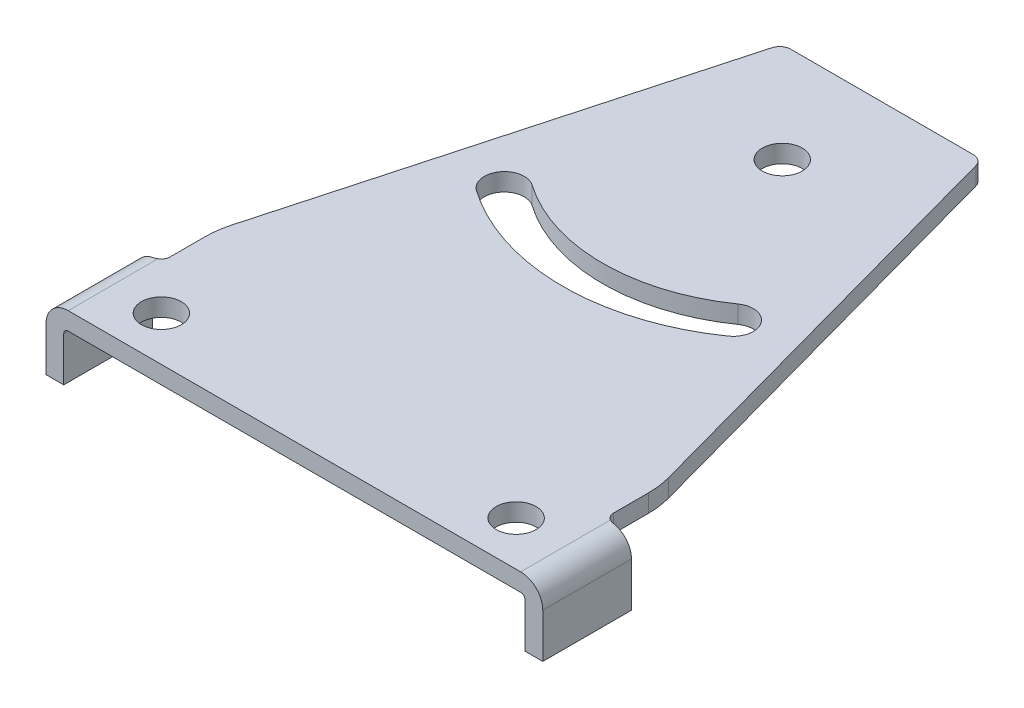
ISO-10303-21;
HEADER;
FILE_DESCRIPTION(('STEP AP214'),'2;1');
FILE_NAME('part.step','',(''),(''),'','','');
FILE_SCHEMA(('AUTOMOTIVE_DESIGN { 1 0 10303 214 1 1 1 1 }'));
ENDSEC;
DATA;
#1=APPLICATION_CONTEXT('core data for automotive mechanical design processes');
#2=APPLICATION_PROTOCOL_DEFINITION('international standard','automotive_design',2000,#1);
#3=PRODUCT_CONTEXT('',#1,'mechanical');
#4=PRODUCT('Part','Part','',(#3));
#5=PRODUCT_RELATED_PRODUCT_CATEGORY('part','',(#4));
#6=PRODUCT_DEFINITION_FORMATION('','',#4);
#7=PRODUCT_DEFINITION_CONTEXT('part definition',#1,'design');
#8=PRODUCT_DEFINITION('design','',#6,#7);
#9=PRODUCT_DEFINITION_SHAPE('','',#8);
#10=(LENGTH_UNIT() NAMED_UNIT(*) SI_UNIT(.MILLI.,.METRE.));
#11=(NAMED_UNIT(*) PLANE_ANGLE_UNIT() SI_UNIT($,.RADIAN.));
#12=(NAMED_UNIT(*) SI_UNIT($,.STERADIAN.) SOLID_ANGLE_UNIT());
#13=UNCERTAINTY_MEASURE_WITH_UNIT(LENGTH_MEASURE(1.E-05),#10,'distance_accuracy_value','');
#14=(GEOMETRIC_REPRESENTATION_CONTEXT(3) GLOBAL_UNCERTAINTY_ASSIGNED_CONTEXT((#13)) GLOBAL_UNIT_ASSIGNED_CONTEXT((#10,
#11,#12)) REPRESENTATION_CONTEXT('',''));
#15=CARTESIAN_POINT('',(0.,0.,0.));
#16=DIRECTION('',(0.,0.,1.));
#17=DIRECTION('',(1.,0.,0.));
#18=AXIS2_PLACEMENT_3D('',#15,#16,#17);
#19=CARTESIAN_POINT('',(51.707162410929,-15.,89.9784453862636));
#20=DIRECTION('',(0.138735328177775,0.,-0.990329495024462));
#21=DIRECTION('',(-0.990329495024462,0.,-0.138735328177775));
#22=AXIS2_PLACEMENT_3D('',#19,#20,#21);
#23=PLANE('',#22);
#24=CARTESIAN_POINT('',(51.0000000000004,-5.00000000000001,89.8793789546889));
#25=DIRECTION('',(0.138735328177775,0.,-0.990329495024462));
#26=DIRECTION('',(-0.990329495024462,0.,-0.138735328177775));
#27=AXIS2_PLACEMENT_3D('',#24,#25,#26);
#28=ELLIPSE('',#27,1.00976493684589,1.);
#29=CARTESIAN_POINT('',(51.7379129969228,-4.32510414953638,89.9827532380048));
#30=VERTEX_POINT('',#29);
#31=CARTESIAN_POINT('',(51.7071624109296,-4.2929488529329,89.9784453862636));
#32=VERTEX_POINT('',#31);
#33=EDGE_CURVE('E576',#30,#32,#28,.F.);
#34=ORIENTED_EDGE('',*,*,#33,.T.);
#35=DIRECTION('',(0.,1.,0.));
#36=VECTOR('',#35,1.);
#37=CARTESIAN_POINT('',(51.707162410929,-15.,89.9784453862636));
#38=LINE('',#37,#36);
#39=CARTESIAN_POINT('',(51.7071624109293,-0.0502604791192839,89.9784453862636));
#40=VERTEX_POINT('',#39);
#41=EDGE_CURVE('E578',#40,#32,#38,.F.);
#42=ORIENTED_EDGE('',*,*,#41,.F.);
#43=CARTESIAN_POINT('',(51.,-5.00000000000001,89.8793789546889));
#44=DIRECTION('',(0.138735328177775,0.,-0.990329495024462));
#45=DIRECTION('',(-0.990329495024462,0.,-0.138735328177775));
#46=AXIS2_PLACEMENT_3D('',#43,#44,#45);
#47=ELLIPSE('',#46,5.04882468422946,5.);
#48=CARTESIAN_POINT('',(51.7379129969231,-0.0547513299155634,89.9827532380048));
#49=VERTEX_POINT('',#48);
#50=EDGE_CURVE('E18',#40,#49,#47,.T.);
#51=ORIENTED_EDGE('',*,*,#50,.T.);
#52=DIRECTION('',(0.,1.,0.));
#53=VECTOR('',#52,1.);
#54=CARTESIAN_POINT('',(51.7379129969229,-15.,89.9827532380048));
#55=LINE('',#54,#53);
#56=EDGE_CURVE('E605',#30,#49,#55,.T.);
#57=ORIENTED_EDGE('',*,*,#56,.F.);
#58=EDGE_LOOP('',(#34,#42,#51,#57));
#59=FACE_BOUND('',#58,.T.);
#60=ADVANCED_FACE('F15',(#59),#23,.T.);
#61=CARTESIAN_POINT('',(51.6750997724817,-15.,89.973433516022));
#62=DIRECTION('',(0.154439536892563,0.,-0.988002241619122));
#63=DIRECTION('',(-0.988002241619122,0.,-0.154439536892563));
#64=AXIS2_PLACEMENT_3D('',#61,#62,#63);
#65=PLANE('',#64);
#66=CARTESIAN_POINT('',(51.0000000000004,-5.00000000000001,89.8679053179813));
#67=DIRECTION('',(0.154439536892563,0.,-0.988002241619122));
#68=DIRECTION('',(-0.988002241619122,0.,-0.154439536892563));
#69=AXIS2_PLACEMENT_3D('',#66,#67,#68);
#70=ELLIPSE('',#69,1.01214345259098,1.);
#71=CARTESIAN_POINT('',(51.6750997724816,-4.26227356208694,89.973433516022));
#72=VERTEX_POINT('',#71);
#73=EDGE_CURVE('E581',#32,#72,#70,.F.);
#74=ORIENTED_EDGE('',*,*,#73,.T.);
#75=DIRECTION('',(0.,1.,0.));
#76=VECTOR('',#75,1.);
#77=CARTESIAN_POINT('',(51.6750997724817,-15.,89.973433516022));
#78=LINE('',#77,#76);
#79=CARTESIAN_POINT('',(51.6750997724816,-0.0457856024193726,89.973433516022));
#80=VERTEX_POINT('',#79);
#81=EDGE_CURVE('E585',#80,#72,#78,.F.);
#82=ORIENTED_EDGE('',*,*,#81,.F.);
#83=CARTESIAN_POINT('',(51.,-5.00000000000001,89.8679053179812));
#84=DIRECTION('',(0.154439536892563,0.,-0.988002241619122));
#85=DIRECTION('',(-0.988002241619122,0.,-0.154439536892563));
#86=AXIS2_PLACEMENT_3D('',#83,#84,#85);
#87=ELLIPSE('',#86,5.06071726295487,5.);
#88=EDGE_CURVE('E569',#80,#40,#87,.T.);
#89=ORIENTED_EDGE('',*,*,#88,.T.);
#90=ORIENTED_EDGE('',*,*,#41,.T.);
#91=EDGE_LOOP('',(#74,#82,#89,#90));
#92=FACE_BOUND('',#91,.T.);
#93=ADVANCED_FACE('F583',(#92),#65,.T.);
#94=CARTESIAN_POINT('',(-51.7071624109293,-15.,89.9784453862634));
#95=DIRECTION('',(-0.15443953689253,0.,-0.988002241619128));
#96=DIRECTION('',(-0.988002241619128,0.,0.15443953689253));
#97=AXIS2_PLACEMENT_3D('',#94,#95,#96);
#98=PLANE('',#97);
#99=CARTESIAN_POINT('',(-50.9999999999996,-5.00000000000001,89.8679053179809));
#100=DIRECTION('',(-0.15443953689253,0.,-0.988002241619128));
#101=DIRECTION('',(0.988002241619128,0.,-0.15443953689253));
#102=AXIS2_PLACEMENT_3D('',#99,#100,#101);
#103=ELLIPSE('',#102,1.01214345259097,1.);
#104=CARTESIAN_POINT('',(-51.675099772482,-4.26227356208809,89.9734335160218));
#105=VERTEX_POINT('',#104);
#106=CARTESIAN_POINT('',(-51.7071624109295,-4.29294885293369,89.9784453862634));
#107=VERTEX_POINT('',#106);
#108=EDGE_CURVE('E593',#105,#107,#103,.F.);
#109=ORIENTED_EDGE('',*,*,#108,.T.);
#110=DIRECTION('',(0.,1.,0.));
#111=VECTOR('',#110,1.);
#112=CARTESIAN_POINT('',(-51.7071624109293,-15.,89.9784453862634));
#113=LINE('',#112,#111);
#114=CARTESIAN_POINT('',(-51.7071624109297,-0.0502604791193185,89.9784453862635));
#115=VERTEX_POINT('',#114);
#116=EDGE_CURVE('E598',#115,#107,#113,.F.);
#117=ORIENTED_EDGE('',*,*,#116,.F.);
#118=CARTESIAN_POINT('',(-51.,-5.,89.867905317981));
#119=DIRECTION('',(-0.15443953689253,0.,-0.988002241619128));
#120=DIRECTION('',(0.988002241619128,0.,-0.15443953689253));
#121=AXIS2_PLACEMENT_3D('',#118,#119,#120);
#122=ELLIPSE('',#121,5.06071726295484,5.);
#123=CARTESIAN_POINT('',(-51.6750997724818,-0.0457856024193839,89.9734335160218));
#124=VERTEX_POINT('',#123);
#125=EDGE_CURVE('E590',#115,#124,#122,.T.);
#126=ORIENTED_EDGE('',*,*,#125,.T.);
#127=DIRECTION('',(0.,1.,0.));
#128=VECTOR('',#127,1.);
#129=CARTESIAN_POINT('',(-51.6750997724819,-15.,89.9734335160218));
#130=LINE('',#129,#128);
#131=EDGE_CURVE('E616',#105,#124,#130,.T.);
#132=ORIENTED_EDGE('',*,*,#131,.F.);
#133=EDGE_LOOP('',(#109,#117,#126,#132));
#134=FACE_BOUND('',#133,.T.);
#135=ADVANCED_FACE('F1503',(#134),#98,.T.);
#136=CARTESIAN_POINT('',(-51.7379129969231,-15.,89.9827532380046));
#137=DIRECTION('',(-0.138735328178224,0.,-0.990329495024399));
#138=DIRECTION('',(-0.990329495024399,0.,0.138735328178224));
#139=AXIS2_PLACEMENT_3D('',#136,#137,#138);
#140=PLANE('',#139);
#141=CARTESIAN_POINT('',(-50.9999999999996,-5.00000000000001,89.8793789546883));
#142=DIRECTION('',(-0.138735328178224,0.,-0.990329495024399));
#143=DIRECTION('',(0.990329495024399,0.,-0.138735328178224));
#144=AXIS2_PLACEMENT_3D('',#141,#142,#143);
#145=ELLIPSE('',#144,1.00976493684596,1.);
#146=CARTESIAN_POINT('',(-51.7379129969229,-4.32510414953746,89.9827532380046));
#147=VERTEX_POINT('',#146);
#148=EDGE_CURVE('E599',#107,#147,#145,.F.);
#149=ORIENTED_EDGE('',*,*,#148,.T.);
#150=DIRECTION('',(0.,1.,0.));
#151=VECTOR('',#150,1.);
#152=CARTESIAN_POINT('',(-51.7379129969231,-15.,89.9827532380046));
#153=LINE('',#152,#151);
#154=CARTESIAN_POINT('',(-51.7379129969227,-0.0547513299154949,89.9827532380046));
#155=VERTEX_POINT('',#154);
#156=EDGE_CURVE('E620',#155,#147,#153,.F.);
#157=ORIENTED_EDGE('',*,*,#156,.F.);
#158=CARTESIAN_POINT('',(-51.,-5.,89.8793789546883));
#159=DIRECTION('',(-0.138735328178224,0.,-0.990329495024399));
#160=DIRECTION('',(0.990329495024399,0.,-0.138735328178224));
#161=AXIS2_PLACEMENT_3D('',#158,#159,#160);
#162=ELLIPSE('',#161,5.04882468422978,5.);
#163=EDGE_CURVE('E595',#155,#115,#162,.T.);
#164=ORIENTED_EDGE('',*,*,#163,.T.);
#165=ORIENTED_EDGE('',*,*,#116,.T.);
#166=EDGE_LOOP('',(#149,#157,#164,#165));
#167=FACE_BOUND('',#166,.T.);
#168=ADVANCED_FACE('F1499',(#167),#140,.T.);
#169=CARTESIAN_POINT('',(51.7379129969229,-15.,89.9827532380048));
#170=DIRECTION('',(0.123622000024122,0.,-0.992329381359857));
#171=DIRECTION('',(-0.992329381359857,0.,-0.123622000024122));
#172=AXIS2_PLACEMENT_3D('',#169,#170,#171);
#173=PLANE('',#172);
#174=CARTESIAN_POINT('',(51.0000000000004,-5.00000000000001,89.8908258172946));
#175=DIRECTION('',(0.123622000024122,0.,-0.992329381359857));
#176=DIRECTION('',(-0.992329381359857,0.,-0.123622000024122));
#177=AXIS2_PLACEMENT_3D('',#174,#175,#176);
#178=ELLIPSE('',#177,1.00772991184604,1.);
#179=CARTESIAN_POINT('',(51.7676128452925,-4.35908618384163,89.9864531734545));
#180=VERTEX_POINT('',#179);
#181=EDGE_CURVE('E602',#180,#30,#178,.F.);
#182=ORIENTED_EDGE('',*,*,#181,.T.);
#183=ORIENTED_EDGE('',*,*,#56,.T.);
#184=CARTESIAN_POINT('',(51.,-5.00000000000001,89.8908258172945));
#185=DIRECTION('',(0.123622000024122,0.,-0.992329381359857));
#186=DIRECTION('',(-0.992329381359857,0.,-0.123622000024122));
#187=AXIS2_PLACEMENT_3D('',#184,#185,#186);
#188=ELLIPSE('',#187,5.03864955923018,5.);
#189=CARTESIAN_POINT('',(51.7676128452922,-0.0592742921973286,89.9864531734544));
#190=VERTEX_POINT('',#189);
#191=EDGE_CURVE('E572',#49,#190,#188,.T.);
#192=ORIENTED_EDGE('',*,*,#191,.T.);
#193=DIRECTION('',(0.,1.,0.));
#194=VECTOR('',#193,1.);
#195=CARTESIAN_POINT('',(51.7676128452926,-15.,89.9864531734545));
#196=LINE('',#195,#194);
#197=EDGE_CURVE('E629',#180,#190,#196,.T.);
#198=ORIENTED_EDGE('',*,*,#197,.F.);
#199=EDGE_LOOP('',(#182,#183,#192,#198));
#200=FACE_BOUND('',#199,.T.);
#201=ADVANCED_FACE('F1495',(#200),#173,.T.);
#202=CARTESIAN_POINT('',(51.6413958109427,-15.,89.967588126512));
#203=DIRECTION('',(0.170882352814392,0.,-0.985291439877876));
#204=DIRECTION('',(-0.985291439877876,0.,-0.170882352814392));
#205=AXIS2_PLACEMENT_3D('',#202,#203,#204);
#206=PLANE('',#205);
#207=CARTESIAN_POINT('',(51.0000000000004,-5.00000000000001,89.8563487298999));
#208=DIRECTION('',(0.170882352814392,0.,-0.985291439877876));
#209=DIRECTION('',(-0.985291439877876,0.,-0.170882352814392));
#210=AXIS2_PLACEMENT_3D('',#207,#208,#209);
#211=ELLIPSE('',#210,1.01492813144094,1.);
#212=CARTESIAN_POINT('',(51.6413958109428,-4.23278985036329,89.967588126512));
#213=VERTEX_POINT('',#212);
#214=EDGE_CURVE('E608',#72,#213,#211,.F.);
#215=ORIENTED_EDGE('',*,*,#214,.T.);
#216=DIRECTION('',(0.,1.,0.));
#217=VECTOR('',#216,1.);
#218=CARTESIAN_POINT('',(51.6413958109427,-15.,89.967588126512));
#219=LINE('',#218,#217);
#220=CARTESIAN_POINT('',(51.6413958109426,-0.0413095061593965,89.967588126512));
#221=VERTEX_POINT('',#220);
#222=EDGE_CURVE('E633',#221,#213,#219,.F.);
#223=ORIENTED_EDGE('',*,*,#222,.F.);
#224=CARTESIAN_POINT('',(51.,-5.00000000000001,89.8563487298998));
#225=DIRECTION('',(0.170882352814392,0.,-0.985291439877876));
#226=DIRECTION('',(-0.985291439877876,0.,-0.170882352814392));
#227=AXIS2_PLACEMENT_3D('',#224,#225,#226);
#228=ELLIPSE('',#227,5.07464065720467,5.);
#229=EDGE_CURVE('E606',#221,#80,#228,.T.);
#230=ORIENTED_EDGE('',*,*,#229,.T.);
#231=ORIENTED_EDGE('',*,*,#81,.T.);
#232=EDGE_LOOP('',(#215,#223,#230,#231));
#233=FACE_BOUND('',#232,.T.);
#234=ADVANCED_FACE('F1491',(#233),#206,.T.);
#235=CARTESIAN_POINT('',(-51.6750997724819,-15.,89.9734335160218));
#236=DIRECTION('',(-0.170882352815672,0.,-0.985291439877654));
#237=DIRECTION('',(-0.985291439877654,0.,0.170882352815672));
#238=AXIS2_PLACEMENT_3D('',#235,#236,#237);
#239=PLANE('',#238);
#240=CARTESIAN_POINT('',(-50.9999999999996,-5.00000000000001,89.8563487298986));
#241=DIRECTION('',(-0.170882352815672,0.,-0.985291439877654));
#242=DIRECTION('',(0.985291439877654,0.,-0.170882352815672));
#243=AXIS2_PLACEMENT_3D('',#240,#241,#242);
#244=ELLIPSE('',#243,1.01492813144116,1.);
#245=CARTESIAN_POINT('',(-51.641395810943,-4.23278985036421,89.9675881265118));
#246=VERTEX_POINT('',#245);
#247=EDGE_CURVE('E613',#246,#105,#244,.F.);
#248=ORIENTED_EDGE('',*,*,#247,.T.);
#249=ORIENTED_EDGE('',*,*,#131,.T.);
#250=CARTESIAN_POINT('',(-51.,-5.,89.8563487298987));
#251=DIRECTION('',(-0.170882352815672,0.,-0.985291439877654));
#252=DIRECTION('',(0.985291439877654,0.,-0.170882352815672));
#253=AXIS2_PLACEMENT_3D('',#250,#251,#252);
#254=ELLIPSE('',#253,5.07464065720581,5.);
#255=CARTESIAN_POINT('',(-51.6413958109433,-0.0413095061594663,89.9675881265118));
#256=VERTEX_POINT('',#255);
#257=EDGE_CURVE('E610',#124,#256,#254,.T.);
#258=ORIENTED_EDGE('',*,*,#257,.T.);
#259=DIRECTION('',(0.,1.,0.));
#260=VECTOR('',#259,1.);
#261=CARTESIAN_POINT('',(-51.6413958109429,-15.,89.9675881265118));
#262=LINE('',#261,#260);
#263=EDGE_CURVE('E642',#246,#256,#262,.T.);
#264=ORIENTED_EDGE('',*,*,#263,.F.);
#265=EDGE_LOOP('',(#248,#249,#258,#264));
#266=FACE_BOUND('',#265,.T.);
#267=ADVANCED_FACE('F1487',(#266),#239,.T.);
#268=CARTESIAN_POINT('',(-51.7676128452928,-15.,89.9864531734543));
#269=DIRECTION('',(-0.12362200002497,0.,-0.992329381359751));
#270=DIRECTION('',(-0.992329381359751,0.,0.12362200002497));
#271=AXIS2_PLACEMENT_3D('',#268,#269,#270);
#272=PLANE('',#271);
#273=CARTESIAN_POINT('',(-50.9999999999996,-5.00000000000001,89.8908258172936));
#274=DIRECTION('',(-0.12362200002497,0.,-0.992329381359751));
#275=DIRECTION('',(0.992329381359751,0.,-0.12362200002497));
#276=AXIS2_PLACEMENT_3D('',#273,#274,#275);
#277=ELLIPSE('',#276,1.00772991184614,1.);
#278=CARTESIAN_POINT('',(-51.7676128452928,-4.35908618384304,89.9864531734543));
#279=VERTEX_POINT('',#278);
#280=EDGE_CURVE('E621',#147,#279,#277,.F.);
#281=ORIENTED_EDGE('',*,*,#280,.T.);
#282=DIRECTION('',(0.,1.,0.));
#283=VECTOR('',#282,1.);
#284=CARTESIAN_POINT('',(-51.7676128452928,-15.,89.9864531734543));
#285=LINE('',#284,#283);
#286=CARTESIAN_POINT('',(-51.767612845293,-0.0592742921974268,89.9864531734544));
#287=VERTEX_POINT('',#286);
#288=EDGE_CURVE('E646',#287,#279,#285,.F.);
#289=ORIENTED_EDGE('',*,*,#288,.F.);
#290=CARTESIAN_POINT('',(-51.,-5.,89.8908258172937));
#291=DIRECTION('',(-0.12362200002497,0.,-0.992329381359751));
#292=DIRECTION('',(0.992329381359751,0.,-0.12362200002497));
#293=AXIS2_PLACEMENT_3D('',#290,#291,#292);
#294=ELLIPSE('',#293,5.03864955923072,5.);
#295=EDGE_CURVE('E617',#287,#155,#294,.T.);
#296=ORIENTED_EDGE('',*,*,#295,.T.);
#297=ORIENTED_EDGE('',*,*,#156,.T.);
#298=EDGE_LOOP('',(#281,#289,#296,#297));
#299=FACE_BOUND('',#298,.T.);
#300=ADVANCED_FACE('F1483',(#299),#272,.T.);
#301=CARTESIAN_POINT('',(51.7676128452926,-15.,89.9864531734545));
#302=DIRECTION('',(0.10907956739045,0.,-0.994033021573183));
#303=DIRECTION('',(-0.994033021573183,0.,-0.10907956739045));
#304=AXIS2_PLACEMENT_3D('',#301,#302,#303);
#305=PLANE('',#304);
#306=CARTESIAN_POINT('',(51.0000000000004,-5.00000000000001,89.90221967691));
#307=DIRECTION('',(0.10907956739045,0.,-0.994033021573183));
#308=DIRECTION('',(-0.994033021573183,0.,-0.10907956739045));
#309=AXIS2_PLACEMENT_3D('',#306,#307,#308);
#310=ELLIPSE('',#309,1.00600279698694,1.);
#311=CARTESIAN_POINT('',(51.7960800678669,-4.39480868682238,89.9895770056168));
#312=VERTEX_POINT('',#311);
#313=EDGE_CURVE('E626',#312,#180,#310,.F.);
#314=ORIENTED_EDGE('',*,*,#313,.T.);
#315=ORIENTED_EDGE('',*,*,#197,.T.);
#316=CARTESIAN_POINT('',(51.,-5.00000000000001,89.9022196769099));
#317=DIRECTION('',(0.10907956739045,0.,-0.994033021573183));
#318=DIRECTION('',(-0.994033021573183,0.,-0.10907956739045));
#319=AXIS2_PLACEMENT_3D('',#316,#317,#318);
#320=ELLIPSE('',#319,5.03001398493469,5.);
#321=CARTESIAN_POINT('',(51.7960800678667,-0.0637811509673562,89.9895770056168));
#322=VERTEX_POINT('',#321);
#323=EDGE_CURVE('E623',#190,#322,#320,.T.);
#324=ORIENTED_EDGE('',*,*,#323,.T.);
#325=DIRECTION('',(0.,1.,0.));
#326=VECTOR('',#325,1.);
#327=CARTESIAN_POINT('',(51.796080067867,-15.,89.9895770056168));
#328=LINE('',#327,#326);
#329=EDGE_CURVE('E655',#312,#322,#328,.T.);
#330=ORIENTED_EDGE('',*,*,#329,.F.);
#331=EDGE_LOOP('',(#314,#315,#324,#330));
#332=FACE_BOUND('',#331,.T.);
#333=ADVANCED_FACE('F1479',(#332),#305,.T.);
#334=CARTESIAN_POINT('',(51.6061569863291,-15.,89.9608385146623));
#335=DIRECTION('',(0.188119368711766,0.,-0.982146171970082));
#336=DIRECTION('',(-0.982146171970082,0.,-0.188119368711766));
#337=AXIS2_PLACEMENT_3D('',#334,#335,#336);
#338=PLANE('',#337);
#339=CARTESIAN_POINT('',(51.0000000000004,-5.00000000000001,89.8447357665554));
#340=DIRECTION('',(0.188119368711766,0.,-0.982146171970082));
#341=DIRECTION('',(-0.982146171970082,0.,-0.188119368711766));
#342=AXIS2_PLACEMENT_3D('',#339,#340,#341);
#343=ELLIPSE('',#342,1.01817838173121,1.);
#344=CARTESIAN_POINT('',(51.6061569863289,-4.20465497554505,89.9608385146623));
#345=VERTEX_POINT('',#344);
#346=EDGE_CURVE('E634',#213,#345,#343,.F.);
#347=ORIENTED_EDGE('',*,*,#346,.T.);
#348=DIRECTION('',(0.,1.,0.));
#349=VECTOR('',#348,1.);
#350=CARTESIAN_POINT('',(51.6061569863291,-15.,89.9608385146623));
#351=LINE('',#350,#349);
#352=CARTESIAN_POINT('',(51.6061569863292,-0.0368786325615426,89.9608385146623));
#353=VERTEX_POINT('',#352);
#354=EDGE_CURVE('E659',#353,#345,#351,.F.);
#355=ORIENTED_EDGE('',*,*,#354,.F.);
#356=CARTESIAN_POINT('',(51.,-5.00000000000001,89.8447357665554));
#357=DIRECTION('',(0.188119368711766,0.,-0.982146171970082));
#358=DIRECTION('',(-0.982146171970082,0.,-0.188119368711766));
#359=AXIS2_PLACEMENT_3D('',#356,#357,#358);
#360=ELLIPSE('',#359,5.09089190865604,5.);
#361=EDGE_CURVE('E630',#353,#221,#360,.T.);
#362=ORIENTED_EDGE('',*,*,#361,.T.);
#363=ORIENTED_EDGE('',*,*,#222,.T.);
#364=EDGE_LOOP('',(#347,#355,#362,#363));
#365=FACE_BOUND('',#364,.T.);
#366=ADVANCED_FACE('F1475',(#365),#338,.T.);
#367=CARTESIAN_POINT('',(-51.6413958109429,-15.,89.9675881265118));
#368=DIRECTION('',(-0.188119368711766,0.,-0.982146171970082));
#369=DIRECTION('',(-0.982146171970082,0.,0.188119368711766));
#370=AXIS2_PLACEMENT_3D('',#367,#368,#369);
#371=PLANE('',#370);
#372=CARTESIAN_POINT('',(-50.9999999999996,-5.00000000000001,89.844735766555));
#373=DIRECTION('',(-0.188119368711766,0.,-0.982146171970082));
#374=DIRECTION('',(0.982146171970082,0.,-0.188119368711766));
#375=AXIS2_PLACEMENT_3D('',#372,#373,#374);
#376=ELLIPSE('',#375,1.01817838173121,1.);
#377=CARTESIAN_POINT('',(-51.6061569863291,-4.20465497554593,89.960838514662));
#378=VERTEX_POINT('',#377);
#379=EDGE_CURVE('E639',#378,#246,#376,.F.);
#380=ORIENTED_EDGE('',*,*,#379,.T.);
#381=ORIENTED_EDGE('',*,*,#263,.T.);
#382=CARTESIAN_POINT('',(-51.,-5.,89.8447357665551));
#383=DIRECTION('',(-0.188119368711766,0.,-0.982146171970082));
#384=DIRECTION('',(0.982146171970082,0.,-0.188119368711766));
#385=AXIS2_PLACEMENT_3D('',#382,#383,#384);
#386=ELLIPSE('',#385,5.09089190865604,5.);
#387=CARTESIAN_POINT('',(-51.606156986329,-0.0368786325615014,89.960838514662));
#388=VERTEX_POINT('',#387);
#389=EDGE_CURVE('E636',#256,#388,#386,.T.);
#390=ORIENTED_EDGE('',*,*,#389,.T.);
#391=DIRECTION('',(0.,1.,0.));
#392=VECTOR('',#391,1.);
#393=CARTESIAN_POINT('',(-51.6061569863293,-15.,89.9608385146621));
#394=LINE('',#393,#392);
#395=EDGE_CURVE('E668',#378,#388,#394,.T.);
#396=ORIENTED_EDGE('',*,*,#395,.F.);
#397=EDGE_LOOP('',(#380,#381,#390,#396));
#398=FACE_BOUND('',#397,.T.);
#399=ADVANCED_FACE('F1471',(#398),#371,.T.);
#400=CARTESIAN_POINT('',(-51.7960800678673,-15.,89.9895770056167));
#401=DIRECTION('',(-0.10907956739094,0.,-0.994033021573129));
#402=DIRECTION('',(-0.994033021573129,0.,0.10907956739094));
#403=AXIS2_PLACEMENT_3D('',#400,#401,#402);
#404=PLANE('',#403);
#405=CARTESIAN_POINT('',(-50.9999999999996,-5.00000000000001,89.9022196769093));
#406=DIRECTION('',(-0.10907956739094,0.,-0.994033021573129));
#407=DIRECTION('',(0.994033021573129,0.,-0.10907956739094));
#408=AXIS2_PLACEMENT_3D('',#405,#406,#407);
#409=ELLIPSE('',#408,1.00600279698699,1.);
#410=CARTESIAN_POINT('',(-51.7960800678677,-4.39480868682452,89.9895770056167));
#411=VERTEX_POINT('',#410);
#412=EDGE_CURVE('E647',#279,#411,#409,.F.);
#413=ORIENTED_EDGE('',*,*,#412,.T.);
#414=DIRECTION('',(0.,1.,0.));
#415=VECTOR('',#414,1.);
#416=CARTESIAN_POINT('',(-51.7960800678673,-15.,89.9895770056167));
#417=LINE('',#416,#415);
#418=CARTESIAN_POINT('',(-51.7960800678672,-0.0637811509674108,89.9895770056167));
#419=VERTEX_POINT('',#418);
#420=EDGE_CURVE('E672',#419,#411,#417,.F.);
#421=ORIENTED_EDGE('',*,*,#420,.F.);
#422=CARTESIAN_POINT('',(-51.,-5.,89.9022196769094));
#423=DIRECTION('',(-0.10907956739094,0.,-0.994033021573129));
#424=DIRECTION('',(0.994033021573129,0.,-0.10907956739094));
#425=AXIS2_PLACEMENT_3D('',#422,#423,#424);
#426=ELLIPSE('',#425,5.03001398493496,5.);
#427=EDGE_CURVE('E643',#419,#287,#426,.T.);
#428=ORIENTED_EDGE('',*,*,#427,.T.);
#429=ORIENTED_EDGE('',*,*,#288,.T.);
#430=EDGE_LOOP('',(#413,#421,#428,#429));
#431=FACE_BOUND('',#430,.T.);
#432=ADVANCED_FACE('F1467',(#431),#404,.T.);
#433=CARTESIAN_POINT('',(51.796080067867,-15.,89.9895770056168));
#434=DIRECTION('',(0.095196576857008,0.,-0.995458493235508));
#435=DIRECTION('',(-0.995458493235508,0.,-0.095196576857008));
#436=AXIS2_PLACEMENT_3D('',#433,#434,#435);
#437=PLANE('',#436);
#438=CARTESIAN_POINT('',(51.0000000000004,-5.00000000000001,89.9134471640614));
#439=DIRECTION('',(0.095196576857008,0.,-0.995458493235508));
#440=DIRECTION('',(-0.995458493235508,0.,-0.095196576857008));
#441=AXIS2_PLACEMENT_3D('',#438,#439,#440);
#442=ELLIPSE('',#441,1.00456222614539,1.);
#443=CARTESIAN_POINT('',(51.8231424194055,-4.43216502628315,89.9921650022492));
#444=VERTEX_POINT('',#443);
#445=EDGE_CURVE('E652',#444,#312,#442,.F.);
#446=ORIENTED_EDGE('',*,*,#445,.T.);
#447=ORIENTED_EDGE('',*,*,#329,.T.);
#448=CARTESIAN_POINT('',(51.,-5.00000000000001,89.9134471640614));
#449=DIRECTION('',(0.095196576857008,0.,-0.995458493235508));
#450=DIRECTION('',(-0.995458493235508,0.,-0.095196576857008));
#451=AXIS2_PLACEMENT_3D('',#448,#449,#450);
#452=ELLIPSE('',#451,5.02281113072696,5.);
#453=CARTESIAN_POINT('',(51.8231424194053,-0.0682217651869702,89.9921650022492));
#454=VERTEX_POINT('',#453);
#455=EDGE_CURVE('E649',#322,#454,#452,.T.);
#456=ORIENTED_EDGE('',*,*,#455,.T.);
#457=DIRECTION('',(0.,1.,0.));
#458=VECTOR('',#457,1.);
#459=CARTESIAN_POINT('',(51.8231424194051,-15.,89.9921650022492));
#460=LINE('',#459,#458);
#461=EDGE_CURVE('E681',#444,#454,#460,.T.);
#462=ORIENTED_EDGE('',*,*,#461,.F.);
#463=EDGE_LOOP('',(#446,#447,#456,#462));
#464=FACE_BOUND('',#463,.T.);
#465=ADVANCED_FACE('F1463',(#464),#437,.T.);
#466=CARTESIAN_POINT('',(51.5695112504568,-15.,89.9531204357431));
#467=DIRECTION('',(0.206091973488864,0.,-0.978532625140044));
#468=DIRECTION('',(-0.978532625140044,0.,-0.206091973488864));
#469=AXIS2_PLACEMENT_3D('',#466,#467,#468);
#470=PLANE('',#469);
#471=CARTESIAN_POINT('',(51.0000000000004,-5.00000000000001,89.8331737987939));
#472=DIRECTION('',(0.206091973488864,0.,-0.978532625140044));
#473=DIRECTION('',(-0.978532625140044,0.,-0.206091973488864));
#474=AXIS2_PLACEMENT_3D('',#471,#472,#473);
#475=ELLIPSE('',#474,1.02193833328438,1.);
#476=CARTESIAN_POINT('',(51.5695112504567,-4.17801646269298,89.9531204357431));
#477=VERTEX_POINT('',#476);
#478=EDGE_CURVE('E660',#345,#477,#475,.F.);
#479=ORIENTED_EDGE('',*,*,#478,.T.);
#480=DIRECTION('',(0.,1.,0.));
#481=VECTOR('',#480,1.);
#482=CARTESIAN_POINT('',(51.5695112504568,-15.,89.9531204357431));
#483=LINE('',#482,#481);
#484=CARTESIAN_POINT('',(51.5695112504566,-0.0325401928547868,89.9531204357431));
#485=VERTEX_POINT('',#484);
#486=EDGE_CURVE('E685',#485,#477,#483,.F.);
#487=ORIENTED_EDGE('',*,*,#486,.F.);
#488=CARTESIAN_POINT('',(51.,-5.00000000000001,89.8331737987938));
#489=DIRECTION('',(0.206091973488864,0.,-0.978532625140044));
#490=DIRECTION('',(-0.978532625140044,0.,-0.206091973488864));
#491=AXIS2_PLACEMENT_3D('',#488,#489,#490);
#492=ELLIPSE('',#491,5.10969166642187,5.);
#493=EDGE_CURVE('E656',#485,#353,#492,.T.);
#494=ORIENTED_EDGE('',*,*,#493,.T.);
#495=ORIENTED_EDGE('',*,*,#354,.T.);
#496=EDGE_LOOP('',(#479,#487,#494,#495));
#497=FACE_BOUND('',#496,.T.);
#498=ADVANCED_FACE('F1459',(#497),#470,.T.);
#499=CARTESIAN_POINT('',(-51.6061569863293,-15.,89.9608385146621));
#500=DIRECTION('',(-0.206091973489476,0.,-0.978532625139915));
#501=DIRECTION('',(-0.978532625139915,0.,0.206091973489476));
#502=AXIS2_PLACEMENT_3D('',#499,#500,#501);
#503=PLANE('',#502);
#504=CARTESIAN_POINT('',(-50.9999999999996,-5.00000000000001,89.833173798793));
#505=DIRECTION('',(-0.206091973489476,0.,-0.978532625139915));
#506=DIRECTION('',(0.978532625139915,0.,-0.206091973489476));
#507=AXIS2_PLACEMENT_3D('',#504,#505,#506);
#508=ELLIPSE('',#507,1.02193833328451,1.);
#509=CARTESIAN_POINT('',(-51.5695112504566,-4.17801646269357,89.9531204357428));
#510=VERTEX_POINT('',#509);
#511=EDGE_CURVE('E665',#510,#378,#508,.F.);
#512=ORIENTED_EDGE('',*,*,#511,.T.);
#513=ORIENTED_EDGE('',*,*,#395,.T.);
#514=CARTESIAN_POINT('',(-51.,-5.,89.8331737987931));
#515=DIRECTION('',(-0.206091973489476,0.,-0.978532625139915));
#516=DIRECTION('',(0.978532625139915,0.,-0.206091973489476));
#517=AXIS2_PLACEMENT_3D('',#514,#515,#516);
#518=ELLIPSE('',#517,5.10969166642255,5.);
#519=CARTESIAN_POINT('',(-51.5695112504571,-0.0325401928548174,89.9531204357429));
#520=VERTEX_POINT('',#519);
#521=EDGE_CURVE('E662',#388,#520,#518,.T.);
#522=ORIENTED_EDGE('',*,*,#521,.T.);
#523=DIRECTION('',(0.,1.,0.));
#524=VECTOR('',#523,1.);
#525=CARTESIAN_POINT('',(-51.569511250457,-15.,89.9531204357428));
#526=LINE('',#525,#524);
#527=EDGE_CURVE('E694',#510,#520,#526,.T.);
#528=ORIENTED_EDGE('',*,*,#527,.F.);
#529=EDGE_LOOP('',(#512,#513,#522,#528));
#530=FACE_BOUND('',#529,.T.);
#531=ADVANCED_FACE('F1455',(#530),#503,.T.);
#532=CARTESIAN_POINT('',(-51.8231424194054,-15.,89.9921650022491));
#533=DIRECTION('',(-0.095196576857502,0.,-0.995458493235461));
#534=DIRECTION('',(-0.995458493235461,0.,0.095196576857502));
#535=AXIS2_PLACEMENT_3D('',#532,#533,#534);
#536=PLANE('',#535);
#537=CARTESIAN_POINT('',(-50.9999999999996,-5.00000000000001,89.9134471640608));
#538=DIRECTION('',(-0.095196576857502,0.,-0.995458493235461));
#539=DIRECTION('',(0.995458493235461,0.,-0.095196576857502));
#540=AXIS2_PLACEMENT_3D('',#537,#538,#539);
#541=ELLIPSE('',#540,1.00456222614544,1.);
#542=CARTESIAN_POINT('',(-51.8231424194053,-4.43216502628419,89.9921650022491));
#543=VERTEX_POINT('',#542);
#544=EDGE_CURVE('E673',#411,#543,#541,.F.);
#545=ORIENTED_EDGE('',*,*,#544,.T.);
#546=DIRECTION('',(0.,1.,0.));
#547=VECTOR('',#546,1.);
#548=CARTESIAN_POINT('',(-51.8231424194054,-15.,89.9921650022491));
#549=LINE('',#548,#547);
#550=CARTESIAN_POINT('',(-51.8231424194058,-0.0682217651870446,89.9921650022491));
#551=VERTEX_POINT('',#550);
#552=EDGE_CURVE('E698',#551,#543,#549,.F.);
#553=ORIENTED_EDGE('',*,*,#552,.F.);
#554=CARTESIAN_POINT('',(-51.,-5.,89.9134471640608));
#555=DIRECTION('',(-0.095196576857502,0.,-0.995458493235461));
#556=DIRECTION('',(0.995458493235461,0.,-0.095196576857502));
#557=AXIS2_PLACEMENT_3D('',#554,#555,#556);
#558=ELLIPSE('',#557,5.0228111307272,5.);
#559=EDGE_CURVE('E669',#551,#419,#558,.T.);
#560=ORIENTED_EDGE('',*,*,#559,.T.);
#561=ORIENTED_EDGE('',*,*,#420,.T.);
#562=EDGE_LOOP('',(#545,#553,#560,#561));
#563=FACE_BOUND('',#562,.T.);
#564=ADVANCED_FACE('F1451',(#563),#536,.T.);
#565=CARTESIAN_POINT('',(51.8231424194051,-15.,89.9921650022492));
#566=DIRECTION('',(0.082055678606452,0.,-0.996627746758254));
#567=DIRECTION('',(-0.996627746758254,0.,-0.082055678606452));
#568=AXIS2_PLACEMENT_3D('',#565,#566,#567);
#569=PLANE('',#568);
#570=CARTESIAN_POINT('',(51.0000000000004,-5.00000000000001,89.9243929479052));
#571=DIRECTION('',(0.082055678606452,0.,-0.996627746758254));
#572=DIRECTION('',(-0.996627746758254,0.,-0.082055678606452));
#573=AXIS2_PLACEMENT_3D('',#570,#571,#572);
#574=ELLIPSE('',#573,1.00338366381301,1.);
#575=CARTESIAN_POINT('',(51.8486415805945,-4.47103169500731,89.9942644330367));
#576=VERTEX_POINT('',#575);
#577=EDGE_CURVE('E678',#576,#444,#574,.F.);
#578=ORIENTED_EDGE('',*,*,#577,.T.);
#579=ORIENTED_EDGE('',*,*,#461,.T.);
#580=CARTESIAN_POINT('',(51.,-5.00000000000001,89.9243929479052));
#581=DIRECTION('',(0.082055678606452,0.,-0.996627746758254));
#582=DIRECTION('',(-0.996627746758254,0.,-0.082055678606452));
#583=AXIS2_PLACEMENT_3D('',#580,#581,#582);
#584=ELLIPSE('',#583,5.01691831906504,5.);
#585=CARTESIAN_POINT('',(51.8486415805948,-0.0725455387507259,89.9942644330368));
#586=VERTEX_POINT('',#585);
#587=EDGE_CURVE('E675',#454,#586,#584,.T.);
#588=ORIENTED_EDGE('',*,*,#587,.T.);
#589=DIRECTION('',(0.,1.,0.));
#590=VECTOR('',#589,1.);
#591=CARTESIAN_POINT('',(51.848641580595,-15.,89.9942644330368));
#592=LINE('',#591,#590);
#593=EDGE_CURVE('E707',#576,#586,#592,.T.);
#594=ORIENTED_EDGE('',*,*,#593,.F.);
#595=EDGE_LOOP('',(#578,#579,#588,#594));
#596=FACE_BOUND('',#595,.T.);
#597=ADVANCED_FACE('F1447',(#596),#569,.T.);
#598=CARTESIAN_POINT('',(51.5316044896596,-15.,89.9443779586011));
#599=DIRECTION('',(0.224731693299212,0.,-0.974420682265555));
#600=DIRECTION('',(-0.974420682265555,0.,-0.224731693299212));
#601=AXIS2_PLACEMENT_3D('',#598,#599,#600);
#602=PLANE('',#601);
#603=CARTESIAN_POINT('',(51.0000000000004,-5.00000000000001,89.8217734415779));
#604=DIRECTION('',(0.224731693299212,0.,-0.974420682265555));
#605=DIRECTION('',(-0.974420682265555,0.,-0.224731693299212));
#606=AXIS2_PLACEMENT_3D('',#603,#604,#605);
#607=ELLIPSE('',#606,1.02625079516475,1.);
#608=CARTESIAN_POINT('',(51.5316044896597,-4.15300728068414,89.9443779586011));
#609=VERTEX_POINT('',#608);
#610=EDGE_CURVE('E686',#477,#609,#607,.F.);
#611=ORIENTED_EDGE('',*,*,#610,.T.);
#612=DIRECTION('',(0.,1.,0.));
#613=VECTOR('',#612,1.);
#614=CARTESIAN_POINT('',(51.5316044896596,-15.,89.9443779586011));
#615=LINE('',#614,#613);
#616=CARTESIAN_POINT('',(51.5316044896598,-0.0283406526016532,89.9443779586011));
#617=VERTEX_POINT('',#616);
#618=EDGE_CURVE('E711',#617,#609,#615,.F.);
#619=ORIENTED_EDGE('',*,*,#618,.F.);
#620=CARTESIAN_POINT('',(51.,-5.00000000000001,89.8217734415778));
#621=DIRECTION('',(0.224731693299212,0.,-0.974420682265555));
#622=DIRECTION('',(-0.974420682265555,0.,-0.224731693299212));
#623=AXIS2_PLACEMENT_3D('',#620,#621,#622);
#624=ELLIPSE('',#623,5.13125397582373,5.);
#625=EDGE_CURVE('E682',#617,#485,#624,.T.);
#626=ORIENTED_EDGE('',*,*,#625,.T.);
#627=ORIENTED_EDGE('',*,*,#486,.T.);
#628=EDGE_LOOP('',(#611,#619,#626,#627));
#629=FACE_BOUND('',#628,.T.);
#630=ADVANCED_FACE('F1443',(#629),#602,.T.);
#631=CARTESIAN_POINT('',(-51.569511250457,-15.,89.9531204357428));
#632=DIRECTION('',(-0.224731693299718,0.,-0.974420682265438));
#633=DIRECTION('',(-0.974420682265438,0.,0.224731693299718));
#634=AXIS2_PLACEMENT_3D('',#631,#632,#633);
#635=PLANE('',#634);
#636=CARTESIAN_POINT('',(-50.9999999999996,-5.00000000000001,89.8217734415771));
#637=DIRECTION('',(-0.224731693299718,0.,-0.974420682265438));
#638=DIRECTION('',(0.974420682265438,0.,-0.224731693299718));
#639=AXIS2_PLACEMENT_3D('',#636,#637,#638);
#640=ELLIPSE('',#639,1.02625079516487,1.);
#641=CARTESIAN_POINT('',(-51.5316044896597,-4.15300728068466,89.9443779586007));
#642=VERTEX_POINT('',#641);
#643=EDGE_CURVE('E691',#642,#510,#640,.F.);
#644=ORIENTED_EDGE('',*,*,#643,.T.);
#645=ORIENTED_EDGE('',*,*,#527,.T.);
#646=CARTESIAN_POINT('',(-51.,-5.,89.8217734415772));
#647=DIRECTION('',(-0.224731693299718,0.,-0.974420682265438));
#648=DIRECTION('',(0.974420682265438,0.,-0.224731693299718));
#649=AXIS2_PLACEMENT_3D('',#646,#647,#648);
#650=ELLIPSE('',#649,5.13125397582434,5.);
#651=CARTESIAN_POINT('',(-51.5316044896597,-0.0283406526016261,89.9443779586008));
#652=VERTEX_POINT('',#651);
#653=EDGE_CURVE('E688',#520,#652,#650,.T.);
#654=ORIENTED_EDGE('',*,*,#653,.T.);
#655=DIRECTION('',(0.,1.,0.));
#656=VECTOR('',#655,1.);
#657=CARTESIAN_POINT('',(-51.5316044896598,-15.,89.9443779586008));
#658=LINE('',#657,#656);
#659=EDGE_CURVE('E720',#642,#652,#658,.T.);
#660=ORIENTED_EDGE('',*,*,#659,.F.);
#661=EDGE_LOOP('',(#644,#645,#654,#660));
#662=FACE_BOUND('',#661,.T.);
#663=ADVANCED_FACE('F1439',(#662),#635,.T.);
#664=CARTESIAN_POINT('',(-51.8486415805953,-15.,89.9942644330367));
#665=DIRECTION('',(-0.082055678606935,0.,-0.996627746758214));
#666=DIRECTION('',(-0.996627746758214,0.,0.082055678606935));
#667=AXIS2_PLACEMENT_3D('',#664,#665,#666);
#668=PLANE('',#667);
#669=CARTESIAN_POINT('',(-50.9999999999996,-5.00000000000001,89.9243929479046));
#670=DIRECTION('',(-0.082055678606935,0.,-0.996627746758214));
#671=DIRECTION('',(0.996627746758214,0.,-0.082055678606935));
#672=AXIS2_PLACEMENT_3D('',#669,#670,#671);
#673=ELLIPSE('',#672,1.00338366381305,1.);
#674=CARTESIAN_POINT('',(-51.8486415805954,-4.47103169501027,89.9942644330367));
#675=VERTEX_POINT('',#674);
#676=EDGE_CURVE('E699',#543,#675,#673,.F.);
#677=ORIENTED_EDGE('',*,*,#676,.T.);
#678=DIRECTION('',(0.,1.,0.));
#679=VECTOR('',#678,1.);
#680=CARTESIAN_POINT('',(-51.8486415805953,-15.,89.9942644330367));
#681=LINE('',#680,#679);
#682=CARTESIAN_POINT('',(-51.8486415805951,-0.0725455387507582,89.9942644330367));
#683=VERTEX_POINT('',#682);
#684=EDGE_CURVE('E724',#683,#675,#681,.F.);
#685=ORIENTED_EDGE('',*,*,#684,.F.);
#686=CARTESIAN_POINT('',(-51.,-5.,89.9243929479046));
#687=DIRECTION('',(-0.082055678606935,0.,-0.996627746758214));
#688=DIRECTION('',(0.996627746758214,0.,-0.082055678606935));
#689=AXIS2_PLACEMENT_3D('',#686,#687,#688);
#690=ELLIPSE('',#689,5.01691831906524,5.);
#691=EDGE_CURVE('E695',#683,#551,#690,.T.);
#692=ORIENTED_EDGE('',*,*,#691,.T.);
#693=ORIENTED_EDGE('',*,*,#552,.T.);
#694=EDGE_LOOP('',(#677,#685,#692,#693));
#695=FACE_BOUND('',#694,.T.);
#696=ADVANCED_FACE('F1435',(#695),#668,.T.);
#697=CARTESIAN_POINT('',(51.848641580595,-15.,89.9942644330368));
#698=DIRECTION('',(0.069731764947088,0.,-0.997565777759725));
#699=DIRECTION('',(-0.997565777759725,0.,-0.069731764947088));
#700=AXIS2_PLACEMENT_3D('',#697,#698,#699);
#701=PLANE('',#700);
#702=CARTESIAN_POINT('',(51.0000000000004,-5.00000000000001,89.934942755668));
#703=DIRECTION('',(0.069731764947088,0.,-0.997565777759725));
#704=DIRECTION('',(-0.997565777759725,0.,-0.069731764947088));
#705=AXIS2_PLACEMENT_3D('',#702,#703,#704);
#706=ELLIPSE('',#705,1.00244016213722,1.);
#707=CARTESIAN_POINT('',(51.8724363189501,-4.51127219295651,89.9959277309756));
#708=VERTEX_POINT('',#707);
#709=EDGE_CURVE('E704',#708,#576,#706,.F.);
#710=ORIENTED_EDGE('',*,*,#709,.T.);
#711=ORIENTED_EDGE('',*,*,#593,.T.);
#712=CARTESIAN_POINT('',(51.,-5.00000000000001,89.934942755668));
#713=DIRECTION('',(0.069731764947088,0.,-0.997565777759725));
#714=DIRECTION('',(-0.997565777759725,0.,-0.069731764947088));
#715=AXIS2_PLACEMENT_3D('',#712,#713,#714);
#716=ELLIPSE('',#715,5.0122008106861,5.);
#717=CARTESIAN_POINT('',(51.8724363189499,-0.0767028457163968,89.9959277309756));
#718=VERTEX_POINT('',#717);
#719=EDGE_CURVE('E701',#586,#718,#716,.T.);
#720=ORIENTED_EDGE('',*,*,#719,.T.);
#721=DIRECTION('',(0.,1.,0.));
#722=VECTOR('',#721,1.);
#723=CARTESIAN_POINT('',(51.8724363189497,-15.,89.9959277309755));
#724=LINE('',#723,#722);
#725=EDGE_CURVE('E733',#708,#718,#724,.T.);
#726=ORIENTED_EDGE('',*,*,#725,.F.);
#727=EDGE_LOOP('',(#710,#711,#720,#726));
#728=FACE_BOUND('',#727,.T.);
#729=ADVANCED_FACE('F1431',(#728),#701,.T.);
#730=CARTESIAN_POINT('',(51.4925961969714,-15.,89.93456490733));
#731=DIRECTION('',(0.243962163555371,0.,-0.969784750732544));
#732=DIRECTION('',(-0.969784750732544,0.,-0.243962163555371));
#733=AXIS2_PLACEMENT_3D('',#730,#731,#732);
#734=PLANE('',#733);
#735=CARTESIAN_POINT('',(51.0000000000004,-5.00000000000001,89.8106458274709));
#736=DIRECTION('',(0.243962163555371,0.,-0.969784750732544));
#737=DIRECTION('',(-0.969784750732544,0.,-0.243962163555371));
#738=AXIS2_PLACEMENT_3D('',#735,#736,#737);
#739=ELLIPSE('',#738,1.03115665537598,1.);
#740=CARTESIAN_POINT('',(51.4925961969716,-4.1297419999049,89.9345649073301));
#741=VERTEX_POINT('',#740);
#742=EDGE_CURVE('E712',#609,#741,#739,.F.);
#743=ORIENTED_EDGE('',*,*,#742,.T.);
#744=DIRECTION('',(0.,1.,0.));
#745=VECTOR('',#744,1.);
#746=CARTESIAN_POINT('',(51.4925961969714,-15.,89.93456490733));
#747=LINE('',#746,#745);
#748=CARTESIAN_POINT('',(51.4925961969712,-0.0243242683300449,89.93456490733));
#749=VERTEX_POINT('',#748);
#750=EDGE_CURVE('E737',#749,#741,#747,.F.);
#751=ORIENTED_EDGE('',*,*,#750,.F.);
#752=CARTESIAN_POINT('',(51.,-5.00000000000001,89.8106458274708));
#753=DIRECTION('',(0.243962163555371,0.,-0.969784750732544));
#754=DIRECTION('',(-0.969784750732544,0.,-0.243962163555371));
#755=AXIS2_PLACEMENT_3D('',#752,#753,#754);
#756=ELLIPSE('',#755,5.15578327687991,5.);
#757=EDGE_CURVE('E708',#749,#617,#756,.T.);
#758=ORIENTED_EDGE('',*,*,#757,.T.);
#759=ORIENTED_EDGE('',*,*,#618,.T.);
#760=EDGE_LOOP('',(#743,#751,#758,#759));
#761=FACE_BOUND('',#760,.T.);
#762=ADVANCED_FACE('F1427',(#761),#734,.T.);
#763=CARTESIAN_POINT('',(-51.5316044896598,-15.,89.9443779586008));
#764=DIRECTION('',(-0.243962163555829,0.,-0.969784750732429));
#765=DIRECTION('',(-0.969784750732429,0.,0.243962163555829));
#766=AXIS2_PLACEMENT_3D('',#763,#764,#765);
#767=PLANE('',#766);
#768=CARTESIAN_POINT('',(-50.9999999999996,-5.00000000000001,89.8106458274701));
#769=DIRECTION('',(-0.243962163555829,0.,-0.969784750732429));
#770=DIRECTION('',(0.969784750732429,0.,-0.243962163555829));
#771=AXIS2_PLACEMENT_3D('',#768,#769,#770);
#772=ELLIPSE('',#771,1.0311566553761,1.);
#773=CARTESIAN_POINT('',(-51.4925961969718,-4.12974199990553,89.9345649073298));
#774=VERTEX_POINT('',#773);
#775=EDGE_CURVE('E717',#774,#642,#772,.F.);
#776=ORIENTED_EDGE('',*,*,#775,.T.);
#777=ORIENTED_EDGE('',*,*,#659,.T.);
#778=CARTESIAN_POINT('',(-51.,-5.,89.8106458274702));
#779=DIRECTION('',(-0.243962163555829,0.,-0.969784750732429));
#780=DIRECTION('',(0.969784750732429,0.,-0.243962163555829));
#781=AXIS2_PLACEMENT_3D('',#778,#779,#780);
#782=ELLIPSE('',#781,5.15578327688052,5.);
#783=CARTESIAN_POINT('',(-51.4925961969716,-0.0243242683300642,89.9345649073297));
#784=VERTEX_POINT('',#783);
#785=EDGE_CURVE('E714',#652,#784,#782,.T.);
#786=ORIENTED_EDGE('',*,*,#785,.T.);
#787=DIRECTION('',(0.,1.,0.));
#788=VECTOR('',#787,1.);
#789=CARTESIAN_POINT('',(-51.4925961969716,-15.,89.9345649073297));
#790=LINE('',#789,#788);
#791=EDGE_CURVE('E746',#774,#784,#790,.T.);
#792=ORIENTED_EDGE('',*,*,#791,.F.);
#793=EDGE_LOOP('',(#776,#777,#786,#792));
#794=FACE_BOUND('',#793,.T.);
#795=ADVANCED_FACE('F1423',(#794),#767,.T.);
#796=CARTESIAN_POINT('',(-51.87243631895,-15.,89.9959277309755));
#797=DIRECTION('',(-0.069731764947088,0.,-0.997565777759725));
#798=DIRECTION('',(-0.997565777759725,0.,0.069731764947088));
#799=AXIS2_PLACEMENT_3D('',#796,#797,#798);
#800=PLANE('',#799);
#801=CARTESIAN_POINT('',(-50.9999999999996,-5.00000000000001,89.9349427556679));
#802=DIRECTION('',(-0.069731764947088,0.,-0.997565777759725));
#803=DIRECTION('',(0.997565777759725,0.,-0.069731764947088));
#804=AXIS2_PLACEMENT_3D('',#801,#802,#803);
#805=ELLIPSE('',#804,1.00244016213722,1.);
#806=CARTESIAN_POINT('',(-51.8724363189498,-4.5112721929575,89.9959277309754));
#807=VERTEX_POINT('',#806);
#808=EDGE_CURVE('E725',#675,#807,#805,.F.);
#809=ORIENTED_EDGE('',*,*,#808,.T.);
#810=DIRECTION('',(0.,1.,0.));
#811=VECTOR('',#810,1.);
#812=CARTESIAN_POINT('',(-51.87243631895,-15.,89.9959277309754));
#813=LINE('',#812,#811);
#814=CARTESIAN_POINT('',(-51.87243631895,-0.0767028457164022,89.9959277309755));
#815=VERTEX_POINT('',#814);
#816=EDGE_CURVE('E750',#815,#807,#813,.F.);
#817=ORIENTED_EDGE('',*,*,#816,.F.);
#818=CARTESIAN_POINT('',(-51.,-5.,89.9349427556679));
#819=DIRECTION('',(-0.069731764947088,0.,-0.997565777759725));
#820=DIRECTION('',(0.997565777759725,0.,-0.069731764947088));
#821=AXIS2_PLACEMENT_3D('',#818,#819,#820);
#822=ELLIPSE('',#821,5.0122008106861,5.);
#823=EDGE_CURVE('E721',#815,#683,#822,.T.);
#824=ORIENTED_EDGE('',*,*,#823,.T.);
#825=ORIENTED_EDGE('',*,*,#684,.T.);
#826=EDGE_LOOP('',(#809,#817,#824,#825));
#827=FACE_BOUND('',#826,.T.);
#828=ADVANCED_FACE('F1419',(#827),#800,.T.);
#829=CARTESIAN_POINT('',(51.8724363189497,-15.,89.9959277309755));
#830=DIRECTION('',(0.058290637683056,0.,-0.99829965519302));
#831=DIRECTION('',(-0.99829965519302,0.,-0.058290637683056));
#832=AXIS2_PLACEMENT_3D('',#829,#830,#831);
#833=PLANE('',#832);
#834=CARTESIAN_POINT('',(51.0000000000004,-5.00000000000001,89.9449862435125));
#835=DIRECTION('',(0.058290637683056,0.,-0.99829965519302));
#836=DIRECTION('',(-0.99829965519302,0.,-0.058290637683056));
#837=AXIS2_PLACEMENT_3D('',#834,#835,#836);
#838=ELLIPSE('',#837,1.00170324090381,1.);
#839=CARTESIAN_POINT('',(51.89440465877,-4.55274134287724,89.9972104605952));
#840=VERTEX_POINT('',#839);
#841=EDGE_CURVE('E730',#840,#708,#838,.F.);
#842=ORIENTED_EDGE('',*,*,#841,.T.);
#843=ORIENTED_EDGE('',*,*,#725,.T.);
#844=CARTESIAN_POINT('',(51.,-5.00000000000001,89.9449862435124));
#845=DIRECTION('',(0.058290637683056,0.,-0.99829965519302));
#846=DIRECTION('',(-0.99829965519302,0.,-0.058290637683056));
#847=AXIS2_PLACEMENT_3D('',#844,#845,#846);
#848=ELLIPSE('',#847,5.00851620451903,5.);
#849=CARTESIAN_POINT('',(51.8944046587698,-0.0806463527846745,89.9972104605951));
#850=VERTEX_POINT('',#849);
#851=EDGE_CURVE('E727',#718,#850,#848,.T.);
#852=ORIENTED_EDGE('',*,*,#851,.T.);
#853=DIRECTION('',(0.,1.,0.));
#854=VECTOR('',#853,1.);
#855=CARTESIAN_POINT('',(51.8944046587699,-15.,89.9972104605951));
#856=LINE('',#855,#854);
#857=EDGE_CURVE('E759',#840,#850,#856,.T.);
#858=ORIENTED_EDGE('',*,*,#857,.F.);
#859=EDGE_LOOP('',(#842,#843,#852,#858));
#860=FACE_BOUND('',#859,.T.);
#861=ADVANCED_FACE('F1415',(#860),#833,.T.);
#862=CARTESIAN_POINT('',(51.4526543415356,-15.,89.9236456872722));
#863=DIRECTION('',(0.263701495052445,0.,-0.964604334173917));
#864=DIRECTION('',(-0.964604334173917,0.,-0.263701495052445));
#865=AXIS2_PLACEMENT_3D('',#862,#863,#864);
#866=PLANE('',#865);
#867=CARTESIAN_POINT('',(51.0000000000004,-5.00000000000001,89.7998999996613));
#868=DIRECTION('',(0.263701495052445,0.,-0.964604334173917));
#869=DIRECTION('',(-0.964604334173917,0.,-0.263701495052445));
#870=AXIS2_PLACEMENT_3D('',#867,#868,#869);
#871=ELLIPSE('',#870,1.03669449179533,1.);
#872=CARTESIAN_POINT('',(51.4526543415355,-4.10831393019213,89.9236456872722));
#873=VERTEX_POINT('',#872);
#874=EDGE_CURVE('E738',#741,#873,#871,.F.);
#875=ORIENTED_EDGE('',*,*,#874,.T.);
#876=DIRECTION('',(0.,1.,0.));
#877=VECTOR('',#876,1.);
#878=CARTESIAN_POINT('',(51.4526543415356,-15.,89.9236456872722));
#879=LINE('',#878,#877);
#880=CARTESIAN_POINT('',(51.4526543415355,-0.020531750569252,89.9236456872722));
#881=VERTEX_POINT('',#880);
#882=EDGE_CURVE('E763',#881,#873,#879,.F.);
#883=ORIENTED_EDGE('',*,*,#882,.F.);
#884=CARTESIAN_POINT('',(51.,-5.00000000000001,89.7998999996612));
#885=DIRECTION('',(0.263701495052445,0.,-0.964604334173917));
#886=DIRECTION('',(-0.964604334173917,0.,-0.263701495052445));
#887=AXIS2_PLACEMENT_3D('',#884,#885,#886);
#888=ELLIPSE('',#887,5.18347245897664,5.);
#889=EDGE_CURVE('E734',#881,#749,#888,.T.);
#890=ORIENTED_EDGE('',*,*,#889,.T.);
#891=ORIENTED_EDGE('',*,*,#750,.T.);
#892=EDGE_LOOP('',(#875,#883,#890,#891));
#893=FACE_BOUND('',#892,.T.);
#894=ADVANCED_FACE('F1411',(#893),#866,.T.);
#895=CARTESIAN_POINT('',(-51.4925961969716,-15.,89.9345649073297));
#896=DIRECTION('',(-0.263701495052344,0.,-0.964604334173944));
#897=DIRECTION('',(-0.964604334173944,0.,0.263701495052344));
#898=AXIS2_PLACEMENT_3D('',#895,#896,#897);
#899=PLANE('',#898);
#900=CARTESIAN_POINT('',(-50.9999999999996,-5.00000000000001,89.7998999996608));
#901=DIRECTION('',(-0.263701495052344,0.,-0.964604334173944));
#902=DIRECTION('',(0.964604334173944,0.,-0.263701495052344));
#903=AXIS2_PLACEMENT_3D('',#900,#901,#902);
#904=ELLIPSE('',#903,1.0366944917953,1.);
#905=CARTESIAN_POINT('',(-51.4526543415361,-4.10831393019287,89.923645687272));
#906=VERTEX_POINT('',#905);
#907=EDGE_CURVE('E743',#906,#774,#904,.F.);
#908=ORIENTED_EDGE('',*,*,#907,.T.);
#909=ORIENTED_EDGE('',*,*,#791,.T.);
#910=CARTESIAN_POINT('',(-51.,-5.,89.7998999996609));
#911=DIRECTION('',(-0.263701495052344,0.,-0.964604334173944));
#912=DIRECTION('',(0.964604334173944,0.,-0.263701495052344));
#913=AXIS2_PLACEMENT_3D('',#910,#911,#912);
#914=ELLIPSE('',#913,5.18347245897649,5.);
#915=CARTESIAN_POINT('',(-51.4526543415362,-0.0205317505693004,89.923645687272));
#916=VERTEX_POINT('',#915);
#917=EDGE_CURVE('E740',#784,#916,#914,.T.);
#918=ORIENTED_EDGE('',*,*,#917,.T.);
#919=DIRECTION('',(0.,1.,0.));
#920=VECTOR('',#919,1.);
#921=CARTESIAN_POINT('',(-51.4526543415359,-15.,89.9236456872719));
#922=LINE('',#921,#920);
#923=EDGE_CURVE('E772',#906,#916,#922,.T.);
#924=ORIENTED_EDGE('',*,*,#923,.F.);
#925=EDGE_LOOP('',(#908,#909,#918,#924));
#926=FACE_BOUND('',#925,.T.);
#927=ADVANCED_FACE('F1407',(#926),#899,.T.);
#928=CARTESIAN_POINT('',(-51.8944046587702,-15.,89.9972104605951));
#929=DIRECTION('',(-0.05829063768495,0.,-0.99829965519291));
#930=DIRECTION('',(-0.99829965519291,0.,0.05829063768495));
#931=AXIS2_PLACEMENT_3D('',#928,#929,#930);
#932=PLANE('',#931);
#933=CARTESIAN_POINT('',(-50.9999999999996,-5.00000000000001,89.9449862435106));
#934=DIRECTION('',(-0.05829063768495,0.,-0.99829965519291));
#935=DIRECTION('',(0.99829965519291,0.,-0.05829063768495));
#936=AXIS2_PLACEMENT_3D('',#933,#934,#935);
#937=ELLIPSE('',#936,1.00170324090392,1.);
#938=CARTESIAN_POINT('',(-51.8944046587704,-4.55274134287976,89.9972104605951));
#939=VERTEX_POINT('',#938);
#940=EDGE_CURVE('E751',#807,#939,#937,.F.);
#941=ORIENTED_EDGE('',*,*,#940,.T.);
#942=DIRECTION('',(0.,1.,0.));
#943=VECTOR('',#942,1.);
#944=CARTESIAN_POINT('',(-51.8944046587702,-15.,89.9972104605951));
#945=LINE('',#944,#943);
#946=CARTESIAN_POINT('',(-51.8944046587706,-0.0806463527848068,89.9972104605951));
#947=VERTEX_POINT('',#946);
#948=EDGE_CURVE('E776',#947,#939,#945,.F.);
#949=ORIENTED_EDGE('',*,*,#948,.F.);
#950=CARTESIAN_POINT('',(-51.,-5.,89.9449862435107));
#951=DIRECTION('',(-0.05829063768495,0.,-0.99829965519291));
#952=DIRECTION('',(0.99829965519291,0.,-0.05829063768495));
#953=AXIS2_PLACEMENT_3D('',#950,#951,#952);
#954=ELLIPSE('',#953,5.00851620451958,5.);
#955=EDGE_CURVE('E747',#947,#815,#954,.T.);
#956=ORIENTED_EDGE('',*,*,#955,.T.);
#957=ORIENTED_EDGE('',*,*,#816,.T.);
#958=EDGE_LOOP('',(#941,#949,#956,#957));
#959=FACE_BOUND('',#958,.T.);
#960=ADVANCED_FACE('F1403',(#959),#932,.T.);
#961=CARTESIAN_POINT('',(51.8944046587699,-15.,89.9972104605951));
#962=DIRECTION('',(0.047788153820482,0.,-0.998857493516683));
#963=DIRECTION('',(-0.998857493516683,0.,-0.047788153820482));
#964=AXIS2_PLACEMENT_3D('',#961,#962,#963);
#965=PLANE('',#964);
#966=CARTESIAN_POINT('',(51.0000000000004,-5.00000000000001,89.9544196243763));
#967=DIRECTION('',(0.047788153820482,0.,-0.998857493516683));
#968=DIRECTION('',(-0.998857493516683,0.,-0.047788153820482));
#969=AXIS2_PLACEMENT_3D('',#966,#967,#968);
#970=ELLIPSE('',#969,1.00114381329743,1.);
#971=CARTESIAN_POINT('',(51.9144451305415,-4.59529009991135,89.9981692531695));
#972=VERTEX_POINT('',#971);
#973=EDGE_CURVE('E756',#972,#840,#970,.F.);
#974=ORIENTED_EDGE('',*,*,#973,.T.);
#975=ORIENTED_EDGE('',*,*,#857,.T.);
#976=CARTESIAN_POINT('',(51.,-5.00000000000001,89.9544196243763));
#977=DIRECTION('',(0.047788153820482,0.,-0.998857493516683));
#978=DIRECTION('',(-0.998857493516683,0.,-0.047788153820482));
#979=AXIS2_PLACEMENT_3D('',#976,#977,#978);
#980=ELLIPSE('',#979,5.00571906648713,5.);
#981=CARTESIAN_POINT('',(51.9144451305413,-0.0843321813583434,89.9981692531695));
#982=VERTEX_POINT('',#981);
#983=EDGE_CURVE('E753',#850,#982,#980,.T.);
#984=ORIENTED_EDGE('',*,*,#983,.T.);
#985=DIRECTION('',(0.,1.,0.));
#986=VECTOR('',#985,1.);
#987=CARTESIAN_POINT('',(51.914445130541,-15.,89.9981692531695));
#988=LINE('',#987,#986);
#989=EDGE_CURVE('E785',#972,#982,#988,.T.);
#990=ORIENTED_EDGE('',*,*,#989,.F.);
#991=EDGE_LOOP('',(#974,#975,#984,#990));
#992=FACE_BOUND('',#991,.T.);
#993=ADVANCED_FACE('F1399',(#992),#965,.T.);
#994=CARTESIAN_POINT('',(51.4119494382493,-15.,89.9115952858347));
#995=DIRECTION('',(0.28386504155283,0.,-0.958864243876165));
#996=DIRECTION('',(-0.958864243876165,0.,-0.28386504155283));
#997=AXIS2_PLACEMENT_3D('',#994,#995,#996);
#998=PLANE('',#997);
#999=CARTESIAN_POINT('',(51.0000000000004,-5.00000000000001,89.7896405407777));
#1000=DIRECTION('',(0.28386504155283,0.,-0.958864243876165));
#1001=DIRECTION('',(-0.958864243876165,0.,-0.28386504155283));
#1002=AXIS2_PLACEMENT_3D('',#999,#1000,#1001);
#1003=ELLIPSE('',#1002,1.04290050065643,1.);
#1004=CARTESIAN_POINT('',(51.4119494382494,-4.08879329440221,89.9115952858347));
#1005=VERTEX_POINT('',#1004);
#1006=EDGE_CURVE('E764',#873,#1005,#1003,.F.);
#1007=ORIENTED_EDGE('',*,*,#1006,.T.);
#1008=DIRECTION('',(0.,1.,0.));
#1009=VECTOR('',#1008,1.);
#1010=CARTESIAN_POINT('',(51.4119494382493,-15.,89.9115952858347));
#1011=LINE('',#1010,#1009);
#1012=CARTESIAN_POINT('',(51.4119494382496,-0.0169991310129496,89.9115952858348));
#1013=VERTEX_POINT('',#1012);
#1014=EDGE_CURVE('E789',#1013,#1005,#1011,.F.);
#1015=ORIENTED_EDGE('',*,*,#1014,.F.);
#1016=CARTESIAN_POINT('',(51.,-5.00000000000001,89.7896405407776));
#1017=DIRECTION('',(0.28386504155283,0.,-0.958864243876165));
#1018=DIRECTION('',(-0.958864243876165,0.,-0.28386504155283));
#1019=AXIS2_PLACEMENT_3D('',#1016,#1017,#1018);
#1020=ELLIPSE('',#1019,5.21450250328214,5.);
#1021=EDGE_CURVE('E760',#1013,#881,#1020,.T.);
#1022=ORIENTED_EDGE('',*,*,#1021,.T.);
#1023=ORIENTED_EDGE('',*,*,#882,.T.);
#1024=EDGE_LOOP('',(#1007,#1015,#1022,#1023));
#1025=FACE_BOUND('',#1024,.T.);
#1026=ADVANCED_FACE('F1395',(#1025),#998,.T.);
#1027=CARTESIAN_POINT('',(-51.4526543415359,-15.,89.9236456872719));
#1028=DIRECTION('',(-0.2838650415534,0.,-0.958864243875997));
#1029=DIRECTION('',(-0.958864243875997,0.,0.2838650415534));
#1030=AXIS2_PLACEMENT_3D('',#1027,#1028,#1029);
#1031=PLANE('',#1030);
#1032=CARTESIAN_POINT('',(-50.9999999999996,-5.00000000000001,89.7896405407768));
#1033=DIRECTION('',(-0.2838650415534,0.,-0.958864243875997));
#1034=DIRECTION('',(0.958864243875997,0.,-0.2838650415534));
#1035=AXIS2_PLACEMENT_3D('',#1032,#1033,#1034);
#1036=ELLIPSE('',#1035,1.04290050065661,1.);
#1037=CARTESIAN_POINT('',(-51.4119494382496,-4.0887932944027,89.9115952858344));
#1038=VERTEX_POINT('',#1037);
#1039=EDGE_CURVE('E769',#1038,#906,#1036,.F.);
#1040=ORIENTED_EDGE('',*,*,#1039,.T.);
#1041=ORIENTED_EDGE('',*,*,#923,.T.);
#1042=CARTESIAN_POINT('',(-51.,-5.,89.7896405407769));
#1043=DIRECTION('',(-0.2838650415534,0.,-0.958864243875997));
#1044=DIRECTION('',(0.958864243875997,0.,-0.2838650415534));
#1045=AXIS2_PLACEMENT_3D('',#1042,#1043,#1044);
#1046=ELLIPSE('',#1045,5.21450250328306,5.);
#1047=CARTESIAN_POINT('',(-51.4119494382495,-0.0169991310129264,89.9115952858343));
#1048=VERTEX_POINT('',#1047);
#1049=EDGE_CURVE('E766',#916,#1048,#1046,.T.);
#1050=ORIENTED_EDGE('',*,*,#1049,.T.);
#1051=DIRECTION('',(0.,1.,0.));
#1052=VECTOR('',#1051,1.);
#1053=CARTESIAN_POINT('',(-51.4119494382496,-15.,89.9115952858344));
#1054=LINE('',#1053,#1052);
#1055=EDGE_CURVE('E798',#1038,#1048,#1054,.T.);
#1056=ORIENTED_EDGE('',*,*,#1055,.F.);
#1057=EDGE_LOOP('',(#1040,#1041,#1050,#1056));
#1058=FACE_BOUND('',#1057,.T.);
#1059=ADVANCED_FACE('F1391',(#1058),#1031,.T.);
#1060=CARTESIAN_POINT('',(-51.9144451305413,-15.,89.9981692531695));
#1061=DIRECTION('',(-0.047788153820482,0.,-0.998857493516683));
#1062=DIRECTION('',(-0.998857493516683,0.,0.047788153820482));
#1063=AXIS2_PLACEMENT_3D('',#1060,#1061,#1062);
#1064=PLANE('',#1063);
#1065=CARTESIAN_POINT('',(-50.9999999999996,-5.00000000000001,89.9544196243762));
#1066=DIRECTION('',(-0.047788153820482,0.,-0.998857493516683));
#1067=DIRECTION('',(0.998857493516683,0.,-0.047788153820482));
#1068=AXIS2_PLACEMENT_3D('',#1065,#1066,#1067);
#1069=ELLIPSE('',#1068,1.00114381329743,1.);
#1070=CARTESIAN_POINT('',(-51.9144451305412,-4.59529009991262,89.9981692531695));
#1071=VERTEX_POINT('',#1070);
#1072=EDGE_CURVE('E777',#939,#1071,#1069,.F.);
#1073=ORIENTED_EDGE('',*,*,#1072,.T.);
#1074=DIRECTION('',(0.,1.,0.));
#1075=VECTOR('',#1074,1.);
#1076=CARTESIAN_POINT('',(-51.9144451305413,-15.,89.9981692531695));
#1077=LINE('',#1076,#1075);
#1078=CARTESIAN_POINT('',(-51.9144451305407,-0.084332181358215,89.9981692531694));
#1079=VERTEX_POINT('',#1078);
#1080=EDGE_CURVE('E802',#1079,#1071,#1077,.F.);
#1081=ORIENTED_EDGE('',*,*,#1080,.F.);
#1082=CARTESIAN_POINT('',(-51.,-5.,89.9544196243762));
#1083=DIRECTION('',(-0.047788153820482,0.,-0.998857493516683));
#1084=DIRECTION('',(0.998857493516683,0.,-0.047788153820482));
#1085=AXIS2_PLACEMENT_3D('',#1082,#1083,#1084);
#1086=ELLIPSE('',#1085,5.00571906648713,5.);
#1087=EDGE_CURVE('E773',#1079,#947,#1086,.T.);
#1088=ORIENTED_EDGE('',*,*,#1087,.T.);
#1089=ORIENTED_EDGE('',*,*,#948,.T.);
#1090=EDGE_LOOP('',(#1073,#1081,#1088,#1089));
#1091=FACE_BOUND('',#1090,.T.);
#1092=ADVANCED_FACE('F1387',(#1091),#1064,.T.);
#1093=CARTESIAN_POINT('',(51.914445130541,-15.,89.9981692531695));
#1094=DIRECTION('',(0.038269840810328,0.,-0.999267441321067));
#1095=DIRECTION('',(-0.999267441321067,0.,-0.038269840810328));
#1096=AXIS2_PLACEMENT_3D('',#1093,#1094,#1095);
#1097=PLANE('',#1096);
#1098=CARTESIAN_POINT('',(51.0000000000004,-5.00000000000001,89.9631479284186));
#1099=DIRECTION('',(0.038269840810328,0.,-0.999267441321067));
#1100=DIRECTION('',(-0.999267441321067,0.,-0.038269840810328));
#1101=AXIS2_PLACEMENT_3D('',#1098,#1099,#1100);
#1102=ELLIPSE('',#1101,1.00073309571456,1.);
#1103=CARTESIAN_POINT('',(51.9324770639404,-4.63877081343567,89.9988598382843));
#1104=VERTEX_POINT('',#1103);
#1105=EDGE_CURVE('E782',#1104,#972,#1102,.F.);
#1106=ORIENTED_EDGE('',*,*,#1105,.T.);
#1107=ORIENTED_EDGE('',*,*,#989,.T.);
#1108=CARTESIAN_POINT('',(51.,-5.00000000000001,89.9631479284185));
#1109=DIRECTION('',(0.038269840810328,0.,-0.999267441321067));
#1110=DIRECTION('',(-0.999267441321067,0.,-0.038269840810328));
#1111=AXIS2_PLACEMENT_3D('',#1108,#1109,#1110);
#1112=ELLIPSE('',#1111,5.0036654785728,5.);
#1113=CARTESIAN_POINT('',(51.932477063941,-0.0877208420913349,89.9988598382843));
#1114=VERTEX_POINT('',#1113);
#1115=EDGE_CURVE('E779',#982,#1114,#1112,.T.);
#1116=ORIENTED_EDGE('',*,*,#1115,.T.);
#1117=DIRECTION('',(0.,1.,0.));
#1118=VECTOR('',#1117,1.);
#1119=CARTESIAN_POINT('',(51.932477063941,-15.,89.9988598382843));
#1120=LINE('',#1119,#1118);
#1121=EDGE_CURVE('E811',#1104,#1114,#1120,.T.);
#1122=ORIENTED_EDGE('',*,*,#1121,.F.);
#1123=EDGE_LOOP('',(#1106,#1107,#1116,#1122));
#1124=FACE_BOUND('',#1123,.T.);
#1125=ADVANCED_FACE('F1383',(#1124),#1097,.T.);
#1126=CARTESIAN_POINT('',(51.3706478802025,-15.,89.8983982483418));
#1127=DIRECTION('',(0.304368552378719,0.,-0.952554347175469));
#1128=DIRECTION('',(-0.952554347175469,0.,-0.304368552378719));
#1129=AXIS2_PLACEMENT_3D('',#1126,#1127,#1128);
#1130=PLANE('',#1129);
#1131=CARTESIAN_POINT('',(51.0000000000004,-5.00000000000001,89.7799655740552));
#1132=DIRECTION('',(0.304368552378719,0.,-0.952554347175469));
#1133=DIRECTION('',(-0.952554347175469,0.,-0.304368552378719));
#1134=AXIS2_PLACEMENT_3D('',#1131,#1132,#1133);
#1135=ELLIPSE('',#1134,1.04980886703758,1.);
#1136=CARTESIAN_POINT('',(51.3706478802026,-4.07122653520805,89.8983982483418));
#1137=VERTEX_POINT('',#1136);
#1138=EDGE_CURVE('E790',#1005,#1137,#1135,.F.);
#1139=ORIENTED_EDGE('',*,*,#1138,.T.);
#1140=DIRECTION('',(0.,1.,0.));
#1141=VECTOR('',#1140,1.);
#1142=CARTESIAN_POINT('',(51.3706478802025,-15.,89.8983982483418));
#1143=LINE('',#1142,#1141);
#1144=CARTESIAN_POINT('',(51.3706478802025,-0.0137569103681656,89.8983982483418));
#1145=VERTEX_POINT('',#1144);
#1146=EDGE_CURVE('E815',#1145,#1137,#1143,.F.);
#1147=ORIENTED_EDGE('',*,*,#1146,.F.);
#1148=CARTESIAN_POINT('',(51.,-5.00000000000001,89.779965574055));
#1149=DIRECTION('',(0.304368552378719,0.,-0.952554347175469));
#1150=DIRECTION('',(-0.952554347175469,0.,-0.304368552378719));
#1151=AXIS2_PLACEMENT_3D('',#1148,#1149,#1150);
#1152=ELLIPSE('',#1151,5.2490443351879,5.);
#1153=EDGE_CURVE('E786',#1145,#1013,#1152,.T.);
#1154=ORIENTED_EDGE('',*,*,#1153,.T.);
#1155=ORIENTED_EDGE('',*,*,#1014,.T.);
#1156=EDGE_LOOP('',(#1139,#1147,#1154,#1155));
#1157=FACE_BOUND('',#1156,.T.);
#1158=ADVANCED_FACE('F1379',(#1157),#1130,.T.);
#1159=CARTESIAN_POINT('',(-51.4119494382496,-15.,89.9115952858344));
#1160=DIRECTION('',(-0.304368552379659,0.,-0.952554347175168));
#1161=DIRECTION('',(-0.952554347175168,0.,0.304368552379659));
#1162=AXIS2_PLACEMENT_3D('',#1159,#1160,#1161);
#1163=PLANE('',#1162);
#1164=CARTESIAN_POINT('',(-50.9999999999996,-5.00000000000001,89.779965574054));
#1165=DIRECTION('',(-0.304368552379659,0.,-0.952554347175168));
#1166=DIRECTION('',(0.952554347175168,0.,-0.304368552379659));
#1167=AXIS2_PLACEMENT_3D('',#1164,#1165,#1166);
#1168=ELLIPSE('',#1167,1.04980886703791,1.);
#1169=CARTESIAN_POINT('',(-51.370647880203,-4.07122653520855,89.8983982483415));
#1170=VERTEX_POINT('',#1169);
#1171=EDGE_CURVE('E795',#1170,#1038,#1168,.F.);
#1172=ORIENTED_EDGE('',*,*,#1171,.T.);
#1173=ORIENTED_EDGE('',*,*,#1055,.T.);
#1174=CARTESIAN_POINT('',(-51.,-5.,89.7799655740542));
#1175=DIRECTION('',(-0.304368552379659,0.,-0.952554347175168));
#1176=DIRECTION('',(0.952554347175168,0.,-0.304368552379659));
#1177=AXIS2_PLACEMENT_3D('',#1174,#1175,#1176);
#1178=ELLIPSE('',#1177,5.24904433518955,5.);
#1179=CARTESIAN_POINT('',(-51.370647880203,-0.0137569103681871,89.8983982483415));
#1180=VERTEX_POINT('',#1179);
#1181=EDGE_CURVE('E792',#1048,#1180,#1178,.T.);
#1182=ORIENTED_EDGE('',*,*,#1181,.T.);
#1183=DIRECTION('',(0.,1.,0.));
#1184=VECTOR('',#1183,1.);
#1185=CARTESIAN_POINT('',(-51.3706478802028,-15.,89.8983982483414));
#1186=LINE('',#1185,#1184);
#1187=EDGE_CURVE('E824',#1170,#1180,#1186,.T.);
#1188=ORIENTED_EDGE('',*,*,#1187,.F.);
#1189=EDGE_LOOP('',(#1172,#1173,#1182,#1188));
#1190=FACE_BOUND('',#1189,.T.);
#1191=ADVANCED_FACE('F1375',(#1190),#1163,.T.);
#1192=CARTESIAN_POINT('',(-51.9324770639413,-15.,89.9988598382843));
#1193=DIRECTION('',(-0.038269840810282,0.,-0.999267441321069));
#1194=DIRECTION('',(-0.999267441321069,0.,0.038269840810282));
#1195=AXIS2_PLACEMENT_3D('',#1192,#1193,#1194);
#1196=PLANE('',#1195);
#1197=CARTESIAN_POINT('',(-50.9999999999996,-5.00000000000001,89.9631479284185));
#1198=DIRECTION('',(-0.038269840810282,0.,-0.999267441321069));
#1199=DIRECTION('',(0.999267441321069,0.,-0.038269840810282));
#1200=AXIS2_PLACEMENT_3D('',#1197,#1198,#1199);
#1201=ELLIPSE('',#1200,1.00073309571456,1.);
#1202=CARTESIAN_POINT('',(-51.9324770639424,-4.63877081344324,89.9988598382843));
#1203=VERTEX_POINT('',#1202);
#1204=EDGE_CURVE('E803',#1071,#1203,#1201,.F.);
#1205=ORIENTED_EDGE('',*,*,#1204,.T.);
#1206=DIRECTION('',(0.,1.,0.));
#1207=VECTOR('',#1206,1.);
#1208=CARTESIAN_POINT('',(-51.9324770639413,-15.,89.9988598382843));
#1209=LINE('',#1208,#1207);
#1210=CARTESIAN_POINT('',(-51.9324770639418,-0.0877208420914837,89.9988598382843));
#1211=VERTEX_POINT('',#1210);
#1212=EDGE_CURVE('E828',#1211,#1203,#1209,.F.);
#1213=ORIENTED_EDGE('',*,*,#1212,.F.);
#1214=CARTESIAN_POINT('',(-51.,-5.,89.9631479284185));
#1215=DIRECTION('',(-0.038269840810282,0.,-0.999267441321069));
#1216=DIRECTION('',(0.999267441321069,0.,-0.038269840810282));
#1217=AXIS2_PLACEMENT_3D('',#1214,#1215,#1216);
#1218=ELLIPSE('',#1217,5.0036654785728,5.);
#1219=EDGE_CURVE('E799',#1211,#1079,#1218,.T.);
#1220=ORIENTED_EDGE('',*,*,#1219,.T.);
#1221=ORIENTED_EDGE('',*,*,#1080,.T.);
#1222=EDGE_LOOP('',(#1205,#1213,#1220,#1221));
#1223=FACE_BOUND('',#1222,.T.);
#1224=ADVANCED_FACE('F1371',(#1223),#1196,.T.);
#1225=CARTESIAN_POINT('',(51.932477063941,-15.,89.9988598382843));
#1226=DIRECTION('',(0.029771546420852,0.,-0.999556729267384));
#1227=DIRECTION('',(-0.999556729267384,0.,-0.029771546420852));
#1228=AXIS2_PLACEMENT_3D('',#1225,#1226,#1227);
#1229=PLANE('',#1228);
#1230=CARTESIAN_POINT('',(51.0000000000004,-5.00000000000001,89.9710862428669));
#1231=DIRECTION('',(0.029771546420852,0.,-0.999556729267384));
#1232=DIRECTION('',(-0.999556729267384,0.,-0.029771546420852));
#1233=AXIS2_PLACEMENT_3D('',#1230,#1231,#1232);
#1234=ELLIPSE('',#1233,1.0004434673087,1.);
#1235=CARTESIAN_POINT('',(51.9484376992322,-4.68303638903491,89.9993352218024));
#1236=VERTEX_POINT('',#1235);
#1237=EDGE_CURVE('E808',#1236,#1104,#1234,.F.);
#1238=ORIENTED_EDGE('',*,*,#1237,.T.);
#1239=ORIENTED_EDGE('',*,*,#1121,.T.);
#1240=CARTESIAN_POINT('',(51.,-5.00000000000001,89.9710862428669));
#1241=DIRECTION('',(0.029771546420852,0.,-0.999556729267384));
#1242=DIRECTION('',(-0.999556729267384,0.,-0.029771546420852));
#1243=AXIS2_PLACEMENT_3D('',#1240,#1241,#1242);
#1244=ELLIPSE('',#1243,5.00221733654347,5.);
#1245=CARTESIAN_POINT('',(51.9484376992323,-0.0907774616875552,89.9993352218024));
#1246=VERTEX_POINT('',#1245);
#1247=EDGE_CURVE('E805',#1114,#1246,#1244,.T.);
#1248=ORIENTED_EDGE('',*,*,#1247,.T.);
#1249=DIRECTION('',(0.,1.,0.));
#1250=VECTOR('',#1249,1.);
#1251=CARTESIAN_POINT('',(51.9484376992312,-15.,89.9993352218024));
#1252=LINE('',#1251,#1250);
#1253=EDGE_CURVE('E835',#1236,#1246,#1252,.T.);
#1254=ORIENTED_EDGE('',*,*,#1253,.F.);
#1255=EDGE_LOOP('',(#1238,#1239,#1248,#1254));
#1256=FACE_BOUND('',#1255,.T.);
#1257=ADVANCED_FACE('F1367',(#1256),#1229,.T.);
#1258=CARTESIAN_POINT('',(51.328906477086,-15.,89.8840471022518));
#1259=DIRECTION('',(0.32513120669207,0.,-0.945668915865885));
#1260=DIRECTION('',(-0.945668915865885,0.,-0.32513120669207));
#1261=AXIS2_PLACEMENT_3D('',#1258,#1259,#1260);
#1262=PLANE('',#1261);
#1263=CARTESIAN_POINT('',(51.0000000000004,-5.00000000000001,89.7709654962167));
#1264=DIRECTION('',(0.32513120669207,0.,-0.945668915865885));
#1265=DIRECTION('',(-0.945668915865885,0.,-0.32513120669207));
#1266=AXIS2_PLACEMENT_3D('',#1263,#1264,#1265);
#1267=ELLIPSE('',#1266,1.05745254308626,1.);
#1268=CARTESIAN_POINT('',(51.3289064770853,-4.05563750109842,89.8840471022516));
#1269=VERTEX_POINT('',#1268);
#1270=EDGE_CURVE('E816',#1137,#1269,#1267,.F.);
#1271=ORIENTED_EDGE('',*,*,#1270,.T.);
#1272=DIRECTION('',(0.,1.,0.));
#1273=VECTOR('',#1272,1.);
#1274=CARTESIAN_POINT('',(51.328906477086,-15.,89.8840471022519));
#1275=LINE('',#1274,#1273);
#1276=CARTESIAN_POINT('',(51.3289064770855,-0.0108296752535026,89.8840471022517));
#1277=VERTEX_POINT('',#1276);
#1278=EDGE_CURVE('E839',#1277,#1269,#1275,.F.);
#1279=ORIENTED_EDGE('',*,*,#1278,.F.);
#1280=CARTESIAN_POINT('',(51.,-5.00000000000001,89.7709654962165));
#1281=DIRECTION('',(0.32513120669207,0.,-0.945668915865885));
#1282=DIRECTION('',(-0.945668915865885,0.,-0.32513120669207));
#1283=AXIS2_PLACEMENT_3D('',#1280,#1281,#1282);
#1284=ELLIPSE('',#1283,5.28726271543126,5.);
#1285=EDGE_CURVE('E812',#1277,#1145,#1284,.T.);
#1286=ORIENTED_EDGE('',*,*,#1285,.T.);
#1287=ORIENTED_EDGE('',*,*,#1146,.T.);
#1288=EDGE_LOOP('',(#1271,#1279,#1286,#1287));
#1289=FACE_BOUND('',#1288,.T.);
#1290=ADVANCED_FACE('F1363',(#1289),#1262,.T.);
#1291=CARTESIAN_POINT('',(-51.3706478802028,-15.,89.8983982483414));
#1292=DIRECTION('',(-0.325131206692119,0.,-0.945668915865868));
#1293=DIRECTION('',(-0.945668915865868,0.,0.325131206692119));
#1294=AXIS2_PLACEMENT_3D('',#1291,#1292,#1293);
#1295=PLANE('',#1294);
#1296=CARTESIAN_POINT('',(-50.9999999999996,-5.00000000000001,89.7709654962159));
#1297=DIRECTION('',(-0.325131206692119,0.,-0.945668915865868));
#1298=DIRECTION('',(0.945668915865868,0.,-0.325131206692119));
#1299=AXIS2_PLACEMENT_3D('',#1296,#1297,#1298);
#1300=ELLIPSE('',#1299,1.05745254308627,1.);
#1301=CARTESIAN_POINT('',(-51.3289064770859,-4.05563750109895,89.8840471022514));
#1302=VERTEX_POINT('',#1301);
#1303=EDGE_CURVE('E821',#1302,#1170,#1300,.F.);
#1304=ORIENTED_EDGE('',*,*,#1303,.T.);
#1305=ORIENTED_EDGE('',*,*,#1187,.T.);
#1306=CARTESIAN_POINT('',(-51.,-5.,89.7709654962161));
#1307=DIRECTION('',(-0.325131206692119,0.,-0.945668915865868));
#1308=DIRECTION('',(0.945668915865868,0.,-0.325131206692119));
#1309=AXIS2_PLACEMENT_3D('',#1306,#1307,#1308);
#1310=ELLIPSE('',#1309,5.28726271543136,5.);
#1311=CARTESIAN_POINT('',(-51.3289064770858,-0.0108296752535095,89.8840471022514));
#1312=VERTEX_POINT('',#1311);
#1313=EDGE_CURVE('E818',#1180,#1312,#1310,.T.);
#1314=ORIENTED_EDGE('',*,*,#1313,.T.);
#1315=DIRECTION('',(0.,1.,0.));
#1316=VECTOR('',#1315,1.);
#1317=CARTESIAN_POINT('',(-51.3289064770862,-15.,89.8840471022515));
#1318=LINE('',#1317,#1316);
#1319=EDGE_CURVE('E848',#1302,#1312,#1318,.T.);
#1320=ORIENTED_EDGE('',*,*,#1319,.F.);
#1321=EDGE_LOOP('',(#1304,#1305,#1314,#1320));
#1322=FACE_BOUND('',#1321,.T.);
#1323=ADVANCED_FACE('F1359',(#1322),#1295,.T.);
#1324=CARTESIAN_POINT('',(-51.9484376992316,-15.,89.9993352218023));
#1325=DIRECTION('',(-0.029771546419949,0.,-0.999556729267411));
#1326=DIRECTION('',(-0.999556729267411,0.,0.029771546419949));
#1327=AXIS2_PLACEMENT_3D('',#1324,#1325,#1326);
#1328=PLANE('',#1327);
#1329=CARTESIAN_POINT('',(-50.9999999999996,-5.00000000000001,89.9710862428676));
#1330=DIRECTION('',(-0.029771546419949,0.,-0.999556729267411));
#1331=DIRECTION('',(0.999556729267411,0.,-0.029771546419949));
#1332=AXIS2_PLACEMENT_3D('',#1329,#1330,#1331);
#1333=ELLIPSE('',#1332,1.00044346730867,1.);
#1334=CARTESIAN_POINT('',(-51.9484376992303,-4.68303638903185,89.9993352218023));
#1335=VERTEX_POINT('',#1334);
#1336=EDGE_CURVE('E829',#1203,#1335,#1333,.F.);
#1337=ORIENTED_EDGE('',*,*,#1336,.T.);
#1338=DIRECTION('',(0.,1.,0.));
#1339=VECTOR('',#1338,1.);
#1340=CARTESIAN_POINT('',(-51.9484376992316,-15.,89.9993352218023));
#1341=LINE('',#1340,#1339);
#1342=CARTESIAN_POINT('',(-51.9484376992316,-0.0907774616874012,89.9993352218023));
#1343=VERTEX_POINT('',#1342);
#1344=EDGE_CURVE('E852',#1343,#1335,#1341,.F.);
#1345=ORIENTED_EDGE('',*,*,#1344,.F.);
#1346=CARTESIAN_POINT('',(-51.,-5.,89.9710862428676));
#1347=DIRECTION('',(-0.029771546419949,0.,-0.999556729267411));
#1348=DIRECTION('',(0.999556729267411,0.,-0.029771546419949));
#1349=AXIS2_PLACEMENT_3D('',#1346,#1347,#1348);
#1350=ELLIPSE('',#1349,5.00221733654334,5.);
#1351=EDGE_CURVE('E825',#1343,#1211,#1350,.T.);
#1352=ORIENTED_EDGE('',*,*,#1351,.T.);
#1353=ORIENTED_EDGE('',*,*,#1212,.T.);
#1354=EDGE_LOOP('',(#1337,#1345,#1352,#1353));
#1355=FACE_BOUND('',#1354,.T.);
#1356=ADVANCED_FACE('F1355',(#1355),#1328,.T.);
#1357=CARTESIAN_POINT('',(51.9484376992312,-15.,89.9993352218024));
#1358=DIRECTION('',(0.022321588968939,0.,-0.999750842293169));
#1359=DIRECTION('',(-0.999750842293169,0.,-0.022321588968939));
#1360=AXIS2_PLACEMENT_3D('',#1357,#1358,#1359);
#1361=PLANE('',#1360);
#1362=CARTESIAN_POINT('',(51.0000000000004,-5.00000000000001,89.9781593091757));
#1363=DIRECTION('',(0.022321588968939,0.,-0.999750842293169));
#1364=DIRECTION('',(-0.999750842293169,0.,-0.022321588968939));
#1365=AXIS2_PLACEMENT_3D('',#1362,#1363,#1364);
#1366=ELLIPSE('',#1365,1.00024921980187,1.);
#1367=CARTESIAN_POINT('',(51.9622764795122,-4.72792652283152,89.9996442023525));
#1368=VERTEX_POINT('',#1367);
#1369=EDGE_CURVE('E832',#1368,#1236,#1366,.F.);
#1370=ORIENTED_EDGE('',*,*,#1369,.T.);
#1371=ORIENTED_EDGE('',*,*,#1253,.T.);
#1372=DIRECTION('',(0.981340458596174,-0.191025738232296,0.0219105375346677));
#1373=VECTOR('',#1372,1.);
#1374=CARTESIAN_POINT('',(51.9484376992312,-0.0907774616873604,89.9993352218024));
#1375=LINE('',#1374,#1373);
#1376=CARTESIAN_POINT('',(51.9622764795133,-0.093471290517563,89.9996442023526));
#1377=VERTEX_POINT('',#1376);
#1378=EDGE_CURVE('E831',#1246,#1377,#1375,.T.);
#1379=ORIENTED_EDGE('',*,*,#1378,.T.);
#1380=DIRECTION('',(0.,1.,0.));
#1381=VECTOR('',#1380,1.);
#1382=CARTESIAN_POINT('',(51.9622764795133,-15.,89.9996442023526));
#1383=LINE('',#1382,#1381);
#1384=EDGE_CURVE('E856',#1368,#1377,#1383,.T.);
#1385=ORIENTED_EDGE('',*,*,#1384,.F.);
#1386=EDGE_LOOP('',(#1370,#1371,#1379,#1385));
#1387=FACE_BOUND('',#1386,.T.);
#1388=ADVANCED_FACE('F1351',(#1387),#1361,.T.);
#1389=CARTESIAN_POINT('',(51.2868843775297,-15.,89.8685465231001));
#1390=DIRECTION('',(0.346073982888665,0.,-0.938207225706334));
#1391=DIRECTION('',(-0.938207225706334,0.,-0.346073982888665));
#1392=AXIS2_PLACEMENT_3D('',#1389,#1390,#1391);
#1393=PLANE('',#1392);
#1394=CARTESIAN_POINT('',(51.0000000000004,-5.00000000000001,89.7627242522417));
#1395=DIRECTION('',(0.346073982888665,0.,-0.938207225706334));
#1396=DIRECTION('',(-0.938207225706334,0.,-0.346073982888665));
#1397=AXIS2_PLACEMENT_3D('',#1394,#1395,#1396);
#1398=ELLIPSE('',#1397,1.0658626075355,1.);
#1399=CARTESIAN_POINT('',(51.2868843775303,-4.04203478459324,89.8685465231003));
#1400=VERTEX_POINT('',#1399);
#1401=EDGE_CURVE('E840',#1269,#1400,#1398,.F.);
#1402=ORIENTED_EDGE('',*,*,#1401,.T.);
#1403=DIRECTION('',(0.,1.,0.));
#1404=VECTOR('',#1403,1.);
#1405=CARTESIAN_POINT('',(51.2868843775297,-15.,89.8685465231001));
#1406=LINE('',#1405,#1404);
#1407=CARTESIAN_POINT('',(51.2868843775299,-0.00823704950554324,89.8685465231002));
#1408=VERTEX_POINT('',#1407);
#1409=EDGE_CURVE('E860',#1408,#1400,#1406,.F.);
#1410=ORIENTED_EDGE('',*,*,#1409,.F.);
#1411=CARTESIAN_POINT('',(51.,-5.00000000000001,89.7627242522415));
#1412=DIRECTION('',(0.346073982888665,0.,-0.938207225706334));
#1413=DIRECTION('',(-0.938207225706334,0.,-0.346073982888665));
#1414=AXIS2_PLACEMENT_3D('',#1411,#1412,#1413);
#1415=ELLIPSE('',#1414,5.3293130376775,5.);
#1416=EDGE_CURVE('E836',#1408,#1277,#1415,.T.);
#1417=ORIENTED_EDGE('',*,*,#1416,.T.);
#1418=ORIENTED_EDGE('',*,*,#1278,.T.);
#1419=EDGE_LOOP('',(#1402,#1410,#1417,#1418));
#1420=FACE_BOUND('',#1419,.T.);
#1421=ADVANCED_FACE('F1347',(#1420),#1393,.T.);
#1422=CARTESIAN_POINT('',(-51.3289064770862,-15.,89.8840471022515));
#1423=DIRECTION('',(-0.346073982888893,0.,-0.93820722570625));
#1424=DIRECTION('',(-0.93820722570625,0.,0.346073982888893));
#1425=AXIS2_PLACEMENT_3D('',#1422,#1423,#1424);
#1426=PLANE('',#1425);
#1427=CARTESIAN_POINT('',(-50.9999999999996,-5.00000000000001,89.7627242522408));
#1428=DIRECTION('',(-0.346073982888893,0.,-0.93820722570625));
#1429=DIRECTION('',(0.93820722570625,0.,-0.346073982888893));
#1430=AXIS2_PLACEMENT_3D('',#1427,#1428,#1429);
#1431=ELLIPSE('',#1430,1.06586260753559,1.);
#1432=CARTESIAN_POINT('',(-51.2868843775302,-4.0420347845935,89.8685465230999));
#1433=VERTEX_POINT('',#1432);
#1434=EDGE_CURVE('E845',#1433,#1302,#1431,.F.);
#1435=ORIENTED_EDGE('',*,*,#1434,.T.);
#1436=ORIENTED_EDGE('',*,*,#1319,.T.);
#1437=CARTESIAN_POINT('',(-51.,-5.,89.762724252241));
#1438=DIRECTION('',(-0.346073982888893,0.,-0.93820722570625));
#1439=DIRECTION('',(0.93820722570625,0.,-0.346073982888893));
#1440=AXIS2_PLACEMENT_3D('',#1437,#1438,#1439);
#1441=ELLIPSE('',#1440,5.32931303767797,5.);
#1442=CARTESIAN_POINT('',(-51.28688437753,-0.00823704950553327,89.8685465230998));
#1443=VERTEX_POINT('',#1442);
#1444=EDGE_CURVE('E842',#1312,#1443,#1441,.T.);
#1445=ORIENTED_EDGE('',*,*,#1444,.T.);
#1446=DIRECTION('',(0.,1.,0.));
#1447=VECTOR('',#1446,1.);
#1448=CARTESIAN_POINT('',(-51.28688437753,-15.,89.8685465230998));
#1449=LINE('',#1448,#1447);
#1450=EDGE_CURVE('E869',#1433,#1443,#1449,.T.);
#1451=ORIENTED_EDGE('',*,*,#1450,.F.);
#1452=EDGE_LOOP('',(#1435,#1436,#1445,#1451));
#1453=FACE_BOUND('',#1452,.T.);
#1454=ADVANCED_FACE('F1343',(#1453),#1426,.T.);
#1455=CARTESIAN_POINT('',(-51.9622764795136,-15.,89.9996442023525));
#1456=DIRECTION('',(-0.022321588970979,0.,-0.999750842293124));
#1457=DIRECTION('',(-0.999750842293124,0.,0.022321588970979));
#1458=AXIS2_PLACEMENT_3D('',#1455,#1456,#1457);
#1459=PLANE('',#1458);
#1460=CARTESIAN_POINT('',(-50.9999999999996,-5.00000000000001,89.9781593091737));
#1461=DIRECTION('',(-0.022321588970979,0.,-0.999750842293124));
#1462=DIRECTION('',(0.999750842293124,0.,-0.022321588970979));
#1463=AXIS2_PLACEMENT_3D('',#1460,#1461,#1462);
#1464=ELLIPSE('',#1463,1.00024921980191,1.);
#1465=CARTESIAN_POINT('',(-51.9622764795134,-4.7279265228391,89.9996442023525));
#1466=VERTEX_POINT('',#1465);
#1467=EDGE_CURVE('E849',#1335,#1466,#1464,.F.);
#1468=ORIENTED_EDGE('',*,*,#1467,.T.);
#1469=DIRECTION('',(0.,1.,0.));
#1470=VECTOR('',#1469,1.);
#1471=CARTESIAN_POINT('',(-51.9622764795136,-15.,89.9996442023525));
#1472=LINE('',#1471,#1470);
#1473=CARTESIAN_POINT('',(-51.9622764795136,-0.0934712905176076,89.9996442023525));
#1474=VERTEX_POINT('',#1473);
#1475=EDGE_CURVE('E873',#1474,#1466,#1472,.F.);
#1476=ORIENTED_EDGE('',*,*,#1475,.F.);
#1477=DIRECTION('',(0.981340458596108,0.191025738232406,-0.0219105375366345));
#1478=VECTOR('',#1477,1.);
#1479=CARTESIAN_POINT('',(-51.9622764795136,-0.0934712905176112,89.9996442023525));
#1480=LINE('',#1479,#1478);
#1481=EDGE_CURVE('E1178',#1474,#1343,#1480,.T.);
#1482=ORIENTED_EDGE('',*,*,#1481,.T.);
#1483=ORIENTED_EDGE('',*,*,#1344,.T.);
#1484=EDGE_LOOP('',(#1468,#1476,#1482,#1483));
#1485=FACE_BOUND('',#1484,.T.);
#1486=ADVANCED_FACE('F1339',(#1485),#1459,.T.);
#1487=CARTESIAN_POINT('',(51.9622764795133,-15.,89.9996442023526));
#1488=DIRECTION('',(0.015941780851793,0.,-0.999872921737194));
#1489=DIRECTION('',(-0.999872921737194,0.,-0.015941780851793));
#1490=AXIS2_PLACEMENT_3D('',#1487,#1488,#1489);
#1491=PLANE('',#1490);
#1492=CARTESIAN_POINT('',(51.0000000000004,-5.00000000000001,89.9843018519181));
#1493=DIRECTION('',(0.015941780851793,0.,-0.999872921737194));
#1494=DIRECTION('',(-0.999872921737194,0.,-0.015941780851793));
#1495=AXIS2_PLACEMENT_3D('',#1492,#1493,#1494);
#1496=ELLIPSE('',#1495,1.00012709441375,1.);
#1497=CARTESIAN_POINT('',(51.9739566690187,-4.77326577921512,89.9998304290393));
#1498=VERTEX_POINT('',#1497);
#1499=EDGE_CURVE('E853',#1498,#1368,#1496,.F.);
#1500=ORIENTED_EDGE('',*,*,#1499,.T.);
#1501=ORIENTED_EDGE('',*,*,#1384,.T.);
#1502=DIRECTION('',(0.980955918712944,-0.193599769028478,0.0156401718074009));
#1503=VECTOR('',#1502,1.);
#1504=CARTESIAN_POINT('',(51.9622764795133,-0.0934712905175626,89.9996442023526));
#1505=LINE('',#1504,#1503);
#1506=CARTESIAN_POINT('',(51.9739566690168,-0.0957764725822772,89.9998304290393));
#1507=VERTEX_POINT('',#1506);
#1508=EDGE_CURVE('E851',#1377,#1507,#1505,.T.);
#1509=ORIENTED_EDGE('',*,*,#1508,.T.);
#1510=DIRECTION('',(0.,1.,0.));
#1511=VECTOR('',#1510,1.);
#1512=CARTESIAN_POINT('',(51.9739566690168,-15.,89.9998304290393));
#1513=LINE('',#1512,#1511);
#1514=EDGE_CURVE('E877',#1498,#1507,#1513,.T.);
#1515=ORIENTED_EDGE('',*,*,#1514,.F.);
#1516=EDGE_LOOP('',(#1500,#1501,#1509,#1515));
#1517=FACE_BOUND('',#1516,.T.);
#1518=ADVANCED_FACE('F1335',(#1517),#1491,.T.);
#1519=CARTESIAN_POINT('',(51.2447554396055,-15.,89.8519194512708));
#1520=DIRECTION('',(0.367113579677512,0.,-0.93017612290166));
#1521=DIRECTION('',(-0.93017612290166,0.,-0.367113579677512));
#1522=AXIS2_PLACEMENT_3D('',#1519,#1520,#1521);
#1523=PLANE('',#1522);
#1524=CARTESIAN_POINT('',(51.0000000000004,-5.00000000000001,89.7553215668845));
#1525=DIRECTION('',(0.367113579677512,0.,-0.93017612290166));
#1526=DIRECTION('',(-0.93017612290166,0.,-0.367113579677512));
#1527=AXIS2_PLACEMENT_3D('',#1524,#1525,#1526);
#1528=ELLIPSE('',#1527,1.07506522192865,1.);
#1529=CARTESIAN_POINT('',(51.2447554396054,-4.03041515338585,89.8519194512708));
#1530=VERTEX_POINT('',#1529);
#1531=EDGE_CURVE('E861',#1400,#1530,#1528,.F.);
#1532=ORIENTED_EDGE('',*,*,#1531,.T.);
#1533=DIRECTION('',(0.,1.,0.));
#1534=VECTOR('',#1533,1.);
#1535=CARTESIAN_POINT('',(51.2447554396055,-15.,89.8519194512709));
#1536=LINE('',#1535,#1534);
#1537=CARTESIAN_POINT('',(51.2447554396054,-0.00599411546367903,89.8519194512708));
#1538=VERTEX_POINT('',#1537);
#1539=EDGE_CURVE('E881',#1538,#1530,#1536,.F.);
#1540=ORIENTED_EDGE('',*,*,#1539,.F.);
#1541=CARTESIAN_POINT('',(51.,-5.00000000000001,89.7553215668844));
#1542=DIRECTION('',(0.367113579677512,0.,-0.93017612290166));
#1543=DIRECTION('',(-0.93017612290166,0.,-0.367113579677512));
#1544=AXIS2_PLACEMENT_3D('',#1541,#1542,#1543);
#1545=ELLIPSE('',#1544,5.37532610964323,5.);
#1546=EDGE_CURVE('E857',#1538,#1408,#1545,.T.);
#1547=ORIENTED_EDGE('',*,*,#1546,.T.);
#1548=ORIENTED_EDGE('',*,*,#1409,.T.);
#1549=EDGE_LOOP('',(#1532,#1540,#1547,#1548));
#1550=FACE_BOUND('',#1549,.T.);
#1551=ADVANCED_FACE('F1331',(#1550),#1523,.T.);
#1552=CARTESIAN_POINT('',(-51.28688437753,-15.,89.8685465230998));
#1553=DIRECTION('',(-0.367113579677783,0.,-0.930176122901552));
#1554=DIRECTION('',(-0.930176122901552,0.,0.367113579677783));
#1555=AXIS2_PLACEMENT_3D('',#1552,#1553,#1554);
#1556=PLANE('',#1555);
#1557=CARTESIAN_POINT('',(-50.9999999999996,-5.00000000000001,89.7553215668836));
#1558=DIRECTION('',(-0.367113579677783,0.,-0.930176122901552));
#1559=DIRECTION('',(0.930176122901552,0.,-0.367113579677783));
#1560=AXIS2_PLACEMENT_3D('',#1557,#1558,#1559);
#1561=ELLIPSE('',#1560,1.07506522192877,1.);
#1562=CARTESIAN_POINT('',(-51.2447554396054,-4.03041515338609,89.8519194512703));
#1563=VERTEX_POINT('',#1562);
#1564=EDGE_CURVE('E866',#1563,#1433,#1561,.F.);
#1565=ORIENTED_EDGE('',*,*,#1564,.T.);
#1566=ORIENTED_EDGE('',*,*,#1450,.T.);
#1567=CARTESIAN_POINT('',(-51.,-5.,89.7553215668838));
#1568=DIRECTION('',(-0.367113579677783,0.,-0.930176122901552));
#1569=DIRECTION('',(0.930176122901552,0.,-0.367113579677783));
#1570=AXIS2_PLACEMENT_3D('',#1567,#1568,#1569);
#1571=ELLIPSE('',#1570,5.37532610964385,5.);
#1572=CARTESIAN_POINT('',(-51.2447554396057,-0.00599411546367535,89.8519194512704));
#1573=VERTEX_POINT('',#1572);
#1574=EDGE_CURVE('E863',#1443,#1573,#1571,.T.);
#1575=ORIENTED_EDGE('',*,*,#1574,.T.);
#1576=DIRECTION('',(0.,1.,0.));
#1577=VECTOR('',#1576,1.);
#1578=CARTESIAN_POINT('',(-51.2447554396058,-15.,89.8519194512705));
#1579=LINE('',#1578,#1577);
#1580=EDGE_CURVE('E890',#1563,#1573,#1579,.T.);
#1581=ORIENTED_EDGE('',*,*,#1580,.F.);
#1582=EDGE_LOOP('',(#1565,#1566,#1575,#1581));
#1583=FACE_BOUND('',#1582,.T.);
#1584=ADVANCED_FACE('F1327',(#1583),#1556,.T.);
#1585=CARTESIAN_POINT('',(-51.9739566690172,-15.,89.9998304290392));
#1586=DIRECTION('',(-0.015941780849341,0.,-0.999872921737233));
#1587=DIRECTION('',(-0.999872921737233,0.,0.015941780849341));
#1588=AXIS2_PLACEMENT_3D('',#1585,#1586,#1587);
#1589=PLANE('',#1588);
#1590=CARTESIAN_POINT('',(-50.9999999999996,-5.00000000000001,89.9843018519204));
#1591=DIRECTION('',(-0.015941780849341,0.,-0.999872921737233));
#1592=DIRECTION('',(0.999872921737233,0.,-0.015941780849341));
#1593=AXIS2_PLACEMENT_3D('',#1590,#1591,#1592);
#1594=ELLIPSE('',#1593,1.0001270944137,1.);
#1595=CARTESIAN_POINT('',(-51.9739566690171,-4.77326577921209,89.9998304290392));
#1596=VERTEX_POINT('',#1595);
#1597=EDGE_CURVE('E870',#1466,#1596,#1594,.F.);
#1598=ORIENTED_EDGE('',*,*,#1597,.T.);
#1599=DIRECTION('',(0.,1.,0.));
#1600=VECTOR('',#1599,1.);
#1601=CARTESIAN_POINT('',(-51.9739566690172,-15.,89.9998304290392));
#1602=LINE('',#1601,#1600);
#1603=CARTESIAN_POINT('',(-51.9739566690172,-0.0957764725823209,89.9998304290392));
#1604=VERTEX_POINT('',#1603);
#1605=EDGE_CURVE('E894',#1604,#1596,#1602,.F.);
#1606=ORIENTED_EDGE('',*,*,#1605,.F.);
#1607=DIRECTION('',(0.980955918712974,0.193599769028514,-0.0156401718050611));
#1608=VECTOR('',#1607,1.);
#1609=CARTESIAN_POINT('',(-51.9739566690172,-0.0957764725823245,89.9998304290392));
#1610=LINE('',#1609,#1608);
#1611=EDGE_CURVE('E1189',#1604,#1474,#1610,.T.);
#1612=ORIENTED_EDGE('',*,*,#1611,.T.);
#1613=ORIENTED_EDGE('',*,*,#1475,.T.);
#1614=EDGE_LOOP('',(#1598,#1606,#1612,#1613));
#1615=FACE_BOUND('',#1614,.T.);
#1616=ADVANCED_FACE('F1323',(#1615),#1589,.T.);
#1617=CARTESIAN_POINT('',(51.9739566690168,-15.,89.9998304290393));
#1618=DIRECTION('',(0.010646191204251,0.,-0.999943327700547));
#1619=DIRECTION('',(-0.999943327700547,0.,-0.010646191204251));
#1620=AXIS2_PLACEMENT_3D('',#1617,#1618,#1619);
#1621=PLANE('',#1620);
#1622=CARTESIAN_POINT('',(51.0000000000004,-5.00000000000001,89.989460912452));
#1623=DIRECTION('',(0.010646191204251,0.,-0.999943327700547));
#1624=DIRECTION('',(-0.999943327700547,0.,-0.010646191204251));
#1625=AXIS2_PLACEMENT_3D('',#1622,#1623,#1624);
#1626=ELLIPSE('',#1625,1.00005667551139,1.);
#1627=CARTESIAN_POINT('',(51.983458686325,-4.81886741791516,89.9999315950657));
#1628=VERTEX_POINT('',#1627);
#1629=EDGE_CURVE('E874',#1628,#1498,#1626,.F.);
#1630=ORIENTED_EDGE('',*,*,#1629,.T.);
#1631=ORIENTED_EDGE('',*,*,#1514,.T.);
#1632=DIRECTION('',(0.9806020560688,-0.195730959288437,0.0104402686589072));
#1633=VECTOR('',#1632,1.);
#1634=CARTESIAN_POINT('',(51.9739566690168,-0.0957764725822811,89.9998304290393));
#1635=LINE('',#1634,#1633);
#1636=CARTESIAN_POINT('',(51.9834586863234,-0.0976731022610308,89.9999315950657));
#1637=VERTEX_POINT('',#1636);
#1638=EDGE_CURVE('E872',#1507,#1637,#1635,.T.);
#1639=ORIENTED_EDGE('',*,*,#1638,.T.);
#1640=DIRECTION('',(0.,1.,0.));
#1641=VECTOR('',#1640,1.);
#1642=CARTESIAN_POINT('',(51.9834586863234,-15.,89.9999315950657));
#1643=LINE('',#1642,#1641);
#1644=EDGE_CURVE('E898',#1628,#1637,#1643,.T.);
#1645=ORIENTED_EDGE('',*,*,#1644,.F.);
#1646=EDGE_LOOP('',(#1630,#1631,#1639,#1645));
#1647=FACE_BOUND('',#1646,.T.);
#1648=ADVANCED_FACE('F1319',(#1647),#1621,.T.);
#1649=CARTESIAN_POINT('',(51.202703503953,-15.,89.8342078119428));
#1650=DIRECTION('',(0.388160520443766,0.,-0.921591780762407));
#1651=DIRECTION('',(-0.921591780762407,0.,-0.388160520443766));
#1652=AXIS2_PLACEMENT_3D('',#1649,#1650,#1651);
#1653=PLANE('',#1652);
#1654=CARTESIAN_POINT('',(51.0000000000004,-5.00000000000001,89.7488321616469));
#1655=DIRECTION('',(0.388160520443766,0.,-0.921591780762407));
#1656=DIRECTION('',(-0.921591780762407,0.,-0.388160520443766));
#1657=AXIS2_PLACEMENT_3D('',#1654,#1655,#1656);
#1658=ELLIPSE('',#1657,1.08507912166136,1.);
#1659=CARTESIAN_POINT('',(51.202703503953,-4.02075984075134,89.8342078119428));
#1660=VERTEX_POINT('',#1659);
#1661=EDGE_CURVE('E882',#1530,#1660,#1658,.F.);
#1662=ORIENTED_EDGE('',*,*,#1661,.T.);
#1663=DIRECTION('',(0.,1.,0.));
#1664=VECTOR('',#1663,1.);
#1665=CARTESIAN_POINT('',(51.202703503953,-15.,89.8342078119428));
#1666=LINE('',#1665,#1664);
#1667=CARTESIAN_POINT('',(51.2027035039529,-0.00411056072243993,89.8342078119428));
#1668=VERTEX_POINT('',#1667);
#1669=EDGE_CURVE('E902',#1668,#1660,#1666,.F.);
#1670=ORIENTED_EDGE('',*,*,#1669,.F.);
#1671=CARTESIAN_POINT('',(51.,-5.00000000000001,89.7488321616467));
#1672=DIRECTION('',(0.388160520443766,0.,-0.921591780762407));
#1673=DIRECTION('',(-0.921591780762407,0.,-0.388160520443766));
#1674=AXIS2_PLACEMENT_3D('',#1671,#1672,#1673);
#1675=ELLIPSE('',#1674,5.42539560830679,5.);
#1676=EDGE_CURVE('E878',#1668,#1538,#1675,.T.);
#1677=ORIENTED_EDGE('',*,*,#1676,.T.);
#1678=ORIENTED_EDGE('',*,*,#1539,.T.);
#1679=EDGE_LOOP('',(#1662,#1670,#1677,#1678));
#1680=FACE_BOUND('',#1679,.T.);
#1681=ADVANCED_FACE('F1315',(#1680),#1653,.T.);
#1682=CARTESIAN_POINT('',(-51.2447554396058,-15.,89.8519194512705));
#1683=DIRECTION('',(-0.388160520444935,0.,-0.921591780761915));
#1684=DIRECTION('',(-0.921591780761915,0.,0.388160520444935));
#1685=AXIS2_PLACEMENT_3D('',#1682,#1683,#1684);
#1686=PLANE('',#1685);
#1687=CARTESIAN_POINT('',(-50.9999999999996,-5.00000000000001,89.7488321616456));
#1688=DIRECTION('',(-0.388160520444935,0.,-0.921591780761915));
#1689=DIRECTION('',(0.921591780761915,0.,-0.388160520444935));
#1690=AXIS2_PLACEMENT_3D('',#1687,#1688,#1689);
#1691=ELLIPSE('',#1690,1.08507912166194,1.);
#1692=CARTESIAN_POINT('',(-51.2027035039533,-4.02075984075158,89.8342078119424));
#1693=VERTEX_POINT('',#1692);
#1694=EDGE_CURVE('E887',#1693,#1563,#1691,.F.);
#1695=ORIENTED_EDGE('',*,*,#1694,.T.);
#1696=ORIENTED_EDGE('',*,*,#1580,.T.);
#1697=CARTESIAN_POINT('',(-51.,-5.,89.7488321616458));
#1698=DIRECTION('',(-0.388160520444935,0.,-0.921591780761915));
#1699=DIRECTION('',(0.921591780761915,0.,-0.388160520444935));
#1700=AXIS2_PLACEMENT_3D('',#1697,#1698,#1699);
#1701=ELLIPSE('',#1700,5.42539560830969,5.);
#1702=CARTESIAN_POINT('',(-51.2027035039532,-0.00411056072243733,89.8342078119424));
#1703=VERTEX_POINT('',#1702);
#1704=EDGE_CURVE('E884',#1573,#1703,#1701,.T.);
#1705=ORIENTED_EDGE('',*,*,#1704,.T.);
#1706=DIRECTION('',(0.,1.,0.));
#1707=VECTOR('',#1706,1.);
#1708=CARTESIAN_POINT('',(-51.2027035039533,-15.,89.8342078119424));
#1709=LINE('',#1708,#1707);
#1710=EDGE_CURVE('E911',#1693,#1703,#1709,.T.);
#1711=ORIENTED_EDGE('',*,*,#1710,.F.);
#1712=EDGE_LOOP('',(#1695,#1696,#1705,#1711));
#1713=FACE_BOUND('',#1712,.T.);
#1714=ADVANCED_FACE('F1311',(#1713),#1686,.T.);
#1715=CARTESIAN_POINT('',(-51.9834586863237,-15.,89.9999315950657));
#1716=DIRECTION('',(-0.010646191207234,0.,-0.999943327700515));
#1717=DIRECTION('',(-0.999943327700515,0.,0.010646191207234));
#1718=AXIS2_PLACEMENT_3D('',#1715,#1716,#1717);
#1719=PLANE('',#1718);
#1720=CARTESIAN_POINT('',(-50.9999999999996,-5.00000000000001,89.989460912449));
#1721=DIRECTION('',(-0.010646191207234,0.,-0.999943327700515));
#1722=DIRECTION('',(0.999943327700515,0.,-0.010646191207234));
#1723=AXIS2_PLACEMENT_3D('',#1720,#1721,#1722);
#1724=ELLIPSE('',#1723,1.00005667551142,1.);
#1725=CARTESIAN_POINT('',(-51.9834586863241,-4.81886741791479,89.9999315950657));
#1726=VERTEX_POINT('',#1725);
#1727=EDGE_CURVE('E891',#1596,#1726,#1724,.F.);
#1728=ORIENTED_EDGE('',*,*,#1727,.T.);
#1729=DIRECTION('',(0.,1.,0.));
#1730=VECTOR('',#1729,1.);
#1731=CARTESIAN_POINT('',(-51.9834586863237,-15.,89.9999315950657));
#1732=LINE('',#1731,#1730);
#1733=CARTESIAN_POINT('',(-51.9834586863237,-0.097673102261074,89.9999315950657));
#1734=VERTEX_POINT('',#1733);
#1735=EDGE_CURVE('E915',#1734,#1726,#1732,.F.);
#1736=ORIENTED_EDGE('',*,*,#1735,.F.);
#1737=DIRECTION('',(0.98060205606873,0.195730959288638,-0.0104402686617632));
#1738=VECTOR('',#1737,1.);
#1739=CARTESIAN_POINT('',(-51.9834586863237,-0.0976731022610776,89.9999315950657));
#1740=LINE('',#1739,#1738);
#1741=EDGE_CURVE('E1202',#1734,#1604,#1740,.T.);
#1742=ORIENTED_EDGE('',*,*,#1741,.T.);
#1743=ORIENTED_EDGE('',*,*,#1605,.T.);
#1744=EDGE_LOOP('',(#1728,#1736,#1742,#1743));
#1745=FACE_BOUND('',#1744,.T.);
#1746=ADVANCED_FACE('F1307',(#1745),#1719,.T.);
#1747=CARTESIAN_POINT('',(51.9834586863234,-15.,89.9999315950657));
#1748=DIRECTION('',(0.006439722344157,0.,-0.99997926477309));
#1749=DIRECTION('',(-0.99997926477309,0.,-0.006439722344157));
#1750=AXIS2_PLACEMENT_3D('',#1747,#1748,#1749);
#1751=PLANE('',#1750);
#1752=CARTESIAN_POINT('',(51.0000000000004,-5.00000000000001,89.9935982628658));
#1753=DIRECTION('',(0.006439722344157,0.,-0.99997926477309));
#1754=DIRECTION('',(-0.99997926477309,0.,-0.006439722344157));
#1755=AXIS2_PLACEMENT_3D('',#1752,#1753,#1754);
#1756=ELLIPSE('',#1755,1.00002073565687,1.);
#1757=CARTESIAN_POINT('',(51.9907824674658,-4.86453745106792,89.9999787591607));
#1758=VERTEX_POINT('',#1757);
#1759=EDGE_CURVE('E895',#1758,#1628,#1756,.F.);
#1760=ORIENTED_EDGE('',*,*,#1759,.T.);
#1761=ORIENTED_EDGE('',*,*,#1644,.T.);
#1762=DIRECTION('',(0.980298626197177,-0.197420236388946,0.00631298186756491));
#1763=VECTOR('',#1762,1.);
#1764=CARTESIAN_POINT('',(51.9834586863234,-0.0976731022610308,89.9999315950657));
#1765=LINE('',#1764,#1763);
#1766=CARTESIAN_POINT('',(51.9907824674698,-0.0991480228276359,89.9999787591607));
#1767=VERTEX_POINT('',#1766);
#1768=EDGE_CURVE('E893',#1637,#1767,#1765,.T.);
#1769=ORIENTED_EDGE('',*,*,#1768,.T.);
#1770=DIRECTION('',(0.,1.,0.));
#1771=VECTOR('',#1770,1.);
#1772=CARTESIAN_POINT('',(51.9907824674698,-15.,89.9999787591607));
#1773=LINE('',#1772,#1771);
#1774=EDGE_CURVE('E919',#1758,#1767,#1773,.T.);
#1775=ORIENTED_EDGE('',*,*,#1774,.F.);
#1776=EDGE_LOOP('',(#1760,#1761,#1769,#1775));
#1777=FACE_BOUND('',#1776,.T.);
#1778=ADVANCED_FACE('F1303',(#1777),#1751,.T.);
#1779=CARTESIAN_POINT('',(51.1609162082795,-15.,89.8154719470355));
#1780=DIRECTION('',(0.409121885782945,0.,-0.912479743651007));
#1781=DIRECTION('',(-0.912479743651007,0.,-0.409121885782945));
#1782=AXIS2_PLACEMENT_3D('',#1779,#1780,#1781);
#1783=PLANE('',#1782);
#1784=CARTESIAN_POINT('',(51.0000000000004,-5.00000000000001,89.7433231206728));
#1785=DIRECTION('',(0.409121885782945,0.,-0.912479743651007));
#1786=DIRECTION('',(-0.912479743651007,0.,-0.409121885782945));
#1787=AXIS2_PLACEMENT_3D('',#1784,#1785,#1786);
#1788=ELLIPSE('',#1787,1.09591473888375,1.);
#1789=CARTESIAN_POINT('',(51.1609162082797,-4.01303192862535,89.8154719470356));
#1790=VERTEX_POINT('',#1789);
#1791=EDGE_CURVE('E903',#1660,#1790,#1788,.F.);
#1792=ORIENTED_EDGE('',*,*,#1791,.T.);
#1793=DIRECTION('',(0.,1.,0.));
#1794=VECTOR('',#1793,1.);
#1795=CARTESIAN_POINT('',(51.1609162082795,-15.,89.8154719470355));
#1796=LINE('',#1795,#1794);
#1797=CARTESIAN_POINT('',(51.1609162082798,-0.00259007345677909,89.8154719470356));
#1798=VERTEX_POINT('',#1797);
#1799=EDGE_CURVE('E923',#1798,#1790,#1796,.F.);
#1800=ORIENTED_EDGE('',*,*,#1799,.F.);
#1801=CARTESIAN_POINT('',(51.,-5.00000000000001,89.7433231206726));
#1802=DIRECTION('',(0.409121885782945,0.,-0.912479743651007));
#1803=DIRECTION('',(-0.912479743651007,0.,-0.409121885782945));
#1804=AXIS2_PLACEMENT_3D('',#1801,#1802,#1803);
#1805=ELLIPSE('',#1804,5.47957369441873,5.);
#1806=EDGE_CURVE('E899',#1798,#1668,#1805,.T.);
#1807=ORIENTED_EDGE('',*,*,#1806,.T.);
#1808=ORIENTED_EDGE('',*,*,#1669,.T.);
#1809=EDGE_LOOP('',(#1792,#1800,#1807,#1808));
#1810=FACE_BOUND('',#1809,.T.);
#1811=ADVANCED_FACE('F1299',(#1810),#1783,.T.);
#1812=CARTESIAN_POINT('',(-51.2027035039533,-15.,89.8342078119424));
#1813=DIRECTION('',(-0.409121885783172,0.,-0.912479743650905));
#1814=DIRECTION('',(-0.912479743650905,0.,0.409121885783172));
#1815=AXIS2_PLACEMENT_3D('',#1812,#1813,#1814);
#1816=PLANE('',#1815);
#1817=CARTESIAN_POINT('',(-50.9999999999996,-5.00000000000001,89.7433231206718));
#1818=DIRECTION('',(-0.409121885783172,0.,-0.912479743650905));
#1819=DIRECTION('',(0.912479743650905,0.,-0.409121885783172));
#1820=AXIS2_PLACEMENT_3D('',#1817,#1818,#1819);
#1821=ELLIPSE('',#1820,1.09591473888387,1.);
#1822=CARTESIAN_POINT('',(-51.1609162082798,-4.0130319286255,89.815471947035));
#1823=VERTEX_POINT('',#1822);
#1824=EDGE_CURVE('E908',#1823,#1693,#1821,.F.);
#1825=ORIENTED_EDGE('',*,*,#1824,.T.);
#1826=ORIENTED_EDGE('',*,*,#1710,.T.);
#1827=CARTESIAN_POINT('',(-51.,-5.,89.743323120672));
#1828=DIRECTION('',(-0.409121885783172,0.,-0.912479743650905));
#1829=DIRECTION('',(0.912479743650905,0.,-0.409121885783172));
#1830=AXIS2_PLACEMENT_3D('',#1827,#1828,#1829);
#1831=ELLIPSE('',#1830,5.47957369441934,5.);
#1832=CARTESIAN_POINT('',(-51.1609162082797,-0.00259007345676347,89.815471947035));
#1833=VERTEX_POINT('',#1832);
#1834=EDGE_CURVE('E905',#1703,#1833,#1831,.T.);
#1835=ORIENTED_EDGE('',*,*,#1834,.T.);
#1836=DIRECTION('',(0.,1.,0.));
#1837=VECTOR('',#1836,1.);
#1838=CARTESIAN_POINT('',(-51.1609162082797,-15.,89.815471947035));
#1839=LINE('',#1838,#1837);
#1840=EDGE_CURVE('E932',#1823,#1833,#1839,.T.);
#1841=ORIENTED_EDGE('',*,*,#1840,.F.);
#1842=EDGE_LOOP('',(#1825,#1826,#1835,#1841));
#1843=FACE_BOUND('',#1842,.T.);
#1844=ADVANCED_FACE('F1295',(#1843),#1816,.T.);
#1845=CARTESIAN_POINT('',(-51.9907824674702,-15.,89.9999787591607));
#1846=DIRECTION('',(-0.00643972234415,0.,-0.99997926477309));
#1847=DIRECTION('',(-0.99997926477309,0.,0.00643972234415));
#1848=AXIS2_PLACEMENT_3D('',#1845,#1846,#1847);
#1849=PLANE('',#1848);
#1850=CARTESIAN_POINT('',(-50.9999999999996,-5.00000000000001,89.9935982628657));
#1851=DIRECTION('',(-0.00643972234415,0.,-0.99997926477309));
#1852=DIRECTION('',(0.99997926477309,0.,-0.00643972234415));
#1853=AXIS2_PLACEMENT_3D('',#1850,#1851,#1852);
#1854=ELLIPSE('',#1853,1.00002073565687,1.);
#1855=CARTESIAN_POINT('',(-51.9907824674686,-4.86453745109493,89.9999787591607));
#1856=VERTEX_POINT('',#1855);
#1857=EDGE_CURVE('E912',#1726,#1856,#1854,.F.);
#1858=ORIENTED_EDGE('',*,*,#1857,.T.);
#1859=DIRECTION('',(0.,1.,0.));
#1860=VECTOR('',#1859,1.);
#1861=CARTESIAN_POINT('',(-51.9907824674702,-15.,89.9999787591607));
#1862=LINE('',#1861,#1860);
#1863=CARTESIAN_POINT('',(-51.9907824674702,-0.0991480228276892,89.9999787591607));
#1864=VERTEX_POINT('',#1863);
#1865=EDGE_CURVE('E936',#1864,#1856,#1862,.F.);
#1866=ORIENTED_EDGE('',*,*,#1865,.F.);
#1867=DIRECTION('',(0.980298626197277,0.19742023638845,-0.00631298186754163));
#1868=VECTOR('',#1867,1.);
#1869=CARTESIAN_POINT('',(-51.9907824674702,-0.0991480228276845,89.9999787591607));
#1870=LINE('',#1869,#1868);
#1871=EDGE_CURVE('E1215',#1864,#1734,#1870,.T.);
#1872=ORIENTED_EDGE('',*,*,#1871,.T.);
#1873=ORIENTED_EDGE('',*,*,#1735,.T.);
#1874=EDGE_LOOP('',(#1858,#1866,#1872,#1873));
#1875=FACE_BOUND('',#1874,.T.);
#1876=ADVANCED_FACE('F1291',(#1875),#1849,.T.);
#1877=CARTESIAN_POINT('',(51.9907824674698,-15.,89.9999787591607));
#1878=DIRECTION('',(0.00331716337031,0.,-0.999994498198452));
#1879=DIRECTION('',(-0.999994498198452,0.,-0.00331716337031));
#1880=AXIS2_PLACEMENT_3D('',#1877,#1878,#1879);
#1881=PLANE('',#1880);
#1882=CARTESIAN_POINT('',(51.0000000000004,-5.00000000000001,89.9966921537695));
#1883=DIRECTION('',(0.00331716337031,0.,-0.999994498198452));
#1884=DIRECTION('',(-0.999994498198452,0.,-0.00331716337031));
#1885=AXIS2_PLACEMENT_3D('',#1882,#1883,#1884);
#1886=ELLIPSE('',#1885,1.00000550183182,1.);
#1887=CARTESIAN_POINT('',(51.9959488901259,-4.91007887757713,89.999995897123));
#1888=VERTEX_POINT('',#1887);
#1889=EDGE_CURVE('E916',#1888,#1758,#1886,.F.);
#1890=ORIENTED_EDGE('',*,*,#1889,.T.);
#1891=ORIENTED_EDGE('',*,*,#1774,.T.);
#1892=DIRECTION('',(0.980060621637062,-0.198672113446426,0.00325103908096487));
#1893=VECTOR('',#1892,1.);
#1894=CARTESIAN_POINT('',(51.9907824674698,-0.0991480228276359,89.9999787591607));
#1895=LINE('',#1894,#1893);
#1896=CARTESIAN_POINT('',(51.9959488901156,-0.100195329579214,89.999995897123));
#1897=VERTEX_POINT('',#1896);
#1898=EDGE_CURVE('E914',#1767,#1897,#1895,.T.);
#1899=ORIENTED_EDGE('',*,*,#1898,.T.);
#1900=DIRECTION('',(0.,1.,0.));
#1901=VECTOR('',#1900,1.);
#1902=CARTESIAN_POINT('',(51.9959488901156,-15.,89.999995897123));
#1903=LINE('',#1902,#1901);
#1904=EDGE_CURVE('E940',#1888,#1897,#1903,.T.);
#1905=ORIENTED_EDGE('',*,*,#1904,.F.);
#1906=EDGE_LOOP('',(#1890,#1891,#1899,#1905));
#1907=FACE_BOUND('',#1906,.T.);
#1908=ADVANCED_FACE('F1287',(#1907),#1881,.T.);
#1909=CARTESIAN_POINT('',(51.1195793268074,-15.,89.7957893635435));
#1910=DIRECTION('',(0.429904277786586,0.,-0.902874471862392));
#1911=DIRECTION('',(-0.902874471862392,0.,-0.429904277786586));
#1912=AXIS2_PLACEMENT_3D('',#1909,#1910,#1911);
#1913=PLANE('',#1912);
#1914=CARTESIAN_POINT('',(51.0000000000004,-5.00000000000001,89.7388515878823));
#1915=DIRECTION('',(0.429904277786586,0.,-0.902874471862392));
#1916=DIRECTION('',(-0.902874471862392,0.,-0.429904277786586));
#1917=AXIS2_PLACEMENT_3D('',#1914,#1915,#1916);
#1918=ELLIPSE('',#1917,1.10757367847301,1.);
#1919=CARTESIAN_POINT('',(51.119579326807,-4.00717535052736,89.7957893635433));
#1920=VERTEX_POINT('',#1919);
#1921=EDGE_CURVE('E924',#1790,#1920,#1918,.F.);
#1922=ORIENTED_EDGE('',*,*,#1921,.T.);
#1923=DIRECTION('',(0.,1.,0.));
#1924=VECTOR('',#1923,1.);
#1925=CARTESIAN_POINT('',(51.1195793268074,-15.,89.7957893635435));
#1926=LINE('',#1925,#1924);
#1927=CARTESIAN_POINT('',(51.1195793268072,-0.00143012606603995,89.7957893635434));
#1928=VERTEX_POINT('',#1927);
#1929=EDGE_CURVE('E944',#1928,#1920,#1926,.F.);
#1930=ORIENTED_EDGE('',*,*,#1929,.F.);
#1931=CARTESIAN_POINT('',(51.,-5.00000000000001,89.7388515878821));
#1932=DIRECTION('',(0.429904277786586,0.,-0.902874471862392));
#1933=DIRECTION('',(-0.902874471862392,0.,-0.429904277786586));
#1934=AXIS2_PLACEMENT_3D('',#1931,#1932,#1933);
#1935=ELLIPSE('',#1934,5.53786839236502,5.);
#1936=EDGE_CURVE('E920',#1928,#1798,#1935,.T.);
#1937=ORIENTED_EDGE('',*,*,#1936,.T.);
#1938=ORIENTED_EDGE('',*,*,#1799,.T.);
#1939=EDGE_LOOP('',(#1922,#1930,#1937,#1938));
#1940=FACE_BOUND('',#1939,.T.);
#1941=ADVANCED_FACE('F1283',(#1940),#1913,.T.);
#1942=CARTESIAN_POINT('',(-51.1609162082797,-15.,89.815471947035));
#1943=DIRECTION('',(-0.429904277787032,0.,-0.90287447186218));
#1944=DIRECTION('',(-0.90287447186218,0.,0.429904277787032));
#1945=AXIS2_PLACEMENT_3D('',#1942,#1943,#1944);
#1946=PLANE('',#1945);
#1947=CARTESIAN_POINT('',(-50.9999999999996,-5.00000000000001,89.7388515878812));
#1948=DIRECTION('',(-0.429904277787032,0.,-0.90287447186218));
#1949=DIRECTION('',(0.90287447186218,0.,-0.429904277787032));
#1950=AXIS2_PLACEMENT_3D('',#1947,#1948,#1949);
#1951=ELLIPSE('',#1950,1.10757367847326,1.);
#1952=CARTESIAN_POINT('',(-51.1195793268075,-4.00717535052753,89.795789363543));
#1953=VERTEX_POINT('',#1952);
#1954=EDGE_CURVE('E929',#1953,#1823,#1951,.F.);
#1955=ORIENTED_EDGE('',*,*,#1954,.T.);
#1956=ORIENTED_EDGE('',*,*,#1840,.T.);
#1957=CARTESIAN_POINT('',(-51.,-5.,89.7388515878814));
#1958=DIRECTION('',(-0.429904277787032,0.,-0.90287447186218));
#1959=DIRECTION('',(0.90287447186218,0.,-0.429904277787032));
#1960=AXIS2_PLACEMENT_3D('',#1957,#1958,#1959);
#1961=ELLIPSE('',#1960,5.53786839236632,5.);
#1962=CARTESIAN_POINT('',(-51.1195793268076,-0.00143012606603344,89.795789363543));
#1963=VERTEX_POINT('',#1962);
#1964=EDGE_CURVE('E926',#1833,#1963,#1961,.T.);
#1965=ORIENTED_EDGE('',*,*,#1964,.T.);
#1966=DIRECTION('',(0.,1.,0.));
#1967=VECTOR('',#1966,1.);
#1968=CARTESIAN_POINT('',(-51.1195793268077,-15.,89.795789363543));
#1969=LINE('',#1968,#1967);
#1970=EDGE_CURVE('E953',#1953,#1963,#1969,.T.);
#1971=ORIENTED_EDGE('',*,*,#1970,.F.);
#1972=EDGE_LOOP('',(#1955,#1956,#1965,#1971));
#1973=FACE_BOUND('',#1972,.T.);
#1974=ADVANCED_FACE('F1279',(#1973),#1946,.T.);
#1975=CARTESIAN_POINT('',(-51.995948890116,-15.,89.999995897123));
#1976=DIRECTION('',(-0.003317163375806,0.,-0.999994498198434));
#1977=DIRECTION('',(-0.999994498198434,0.,0.003317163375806));
#1978=AXIS2_PLACEMENT_3D('',#1975,#1976,#1977);
#1979=PLANE('',#1978);
#1980=CARTESIAN_POINT('',(-50.9999999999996,-5.00000000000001,89.996692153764));
#1981=DIRECTION('',(-0.003317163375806,0.,-0.999994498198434));
#1982=DIRECTION('',(0.999994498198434,0.,-0.003317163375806));
#1983=AXIS2_PLACEMENT_3D('',#1980,#1981,#1982);
#1984=ELLIPSE('',#1983,1.00000550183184,1.);
#1985=CARTESIAN_POINT('',(-51.995948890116,-4.91007887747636,89.999995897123));
#1986=VERTEX_POINT('',#1985);
#1987=EDGE_CURVE('E933',#1856,#1986,#1984,.F.);
#1988=ORIENTED_EDGE('',*,*,#1987,.T.);
#1989=DIRECTION('',(0.,1.,0.));
#1990=VECTOR('',#1989,1.);
#1991=CARTESIAN_POINT('',(-51.995948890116,-15.,89.999995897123));
#1992=LINE('',#1991,#1990);
#1993=CARTESIAN_POINT('',(-51.995948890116,-0.100195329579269,89.999995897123));
#1994=VERTEX_POINT('',#1993);
#1995=EDGE_CURVE('E957',#1994,#1986,#1992,.F.);
#1996=ORIENTED_EDGE('',*,*,#1995,.F.);
#1997=DIRECTION('',(0.980060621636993,0.198672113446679,-0.00325103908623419));
#1998=VECTOR('',#1997,1.);
#1999=CARTESIAN_POINT('',(-51.995948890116,-0.100195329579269,89.999995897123));
#2000=LINE('',#1999,#1998);
#2001=EDGE_CURVE('E1228',#1994,#1864,#2000,.T.);
#2002=ORIENTED_EDGE('',*,*,#2001,.T.);
#2003=ORIENTED_EDGE('',*,*,#1865,.T.);
#2004=EDGE_LOOP('',(#1988,#1996,#2002,#2003));
#2005=FACE_BOUND('',#2004,.T.);
#2006=ADVANCED_FACE('F1275',(#2005),#1979,.T.);
#2007=CARTESIAN_POINT('',(51.0788717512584,-15.,89.7752528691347));
#2008=DIRECTION('',(0.450416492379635,0.,-0.892818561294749));
#2009=DIRECTION('',(-0.892818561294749,0.,-0.450416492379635));
#2010=AXIS2_PLACEMENT_3D('',#2007,#2008,#2009);
#2011=PLANE('',#2010);
#2012=CARTESIAN_POINT('',(51.0000000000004,-5.00000000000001,89.7354629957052));
#2013=DIRECTION('',(0.450416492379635,0.,-0.892818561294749));
#2014=DIRECTION('',(-0.892818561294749,0.,-0.450416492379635));
#2015=AXIS2_PLACEMENT_3D('',#2012,#2013,#2014);
#2016=ELLIPSE('',#2015,1.12004839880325,1.);
#2017=CARTESIAN_POINT('',(51.0788717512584,-4.0031152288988,89.7752528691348));
#2018=VERTEX_POINT('',#2017);
#2019=EDGE_CURVE('E945',#1920,#2018,#2016,.F.);
#2020=ORIENTED_EDGE('',*,*,#2019,.T.);
#2021=DIRECTION('',(0.,1.,0.));
#2022=VECTOR('',#2021,1.);
#2023=CARTESIAN_POINT('',(51.0788717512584,-15.,89.7752528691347));
#2024=LINE('',#2023,#2022);
#2025=CARTESIAN_POINT('',(51.0788717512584,-0.000622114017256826,89.7752528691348));
#2026=VERTEX_POINT('',#2025);
#2027=EDGE_CURVE('E961',#2026,#2018,#2024,.F.);
#2028=ORIENTED_EDGE('',*,*,#2027,.F.);
#2029=CARTESIAN_POINT('',(51.,-5.00000000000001,89.735462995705));
#2030=DIRECTION('',(0.450416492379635,0.,-0.892818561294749));
#2031=DIRECTION('',(-0.892818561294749,0.,-0.450416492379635));
#2032=AXIS2_PLACEMENT_3D('',#2029,#2030,#2031);
#2033=ELLIPSE('',#2032,5.60024199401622,5.);
#2034=EDGE_CURVE('E941',#2026,#1928,#2033,.T.);
#2035=ORIENTED_EDGE('',*,*,#2034,.T.);
#2036=ORIENTED_EDGE('',*,*,#1929,.T.);
#2037=EDGE_LOOP('',(#2020,#2028,#2035,#2036));
#2038=FACE_BOUND('',#2037,.T.);
#2039=ADVANCED_FACE('F1271',(#2038),#2011,.T.);
#2040=CARTESIAN_POINT('',(-51.1195793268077,-15.,89.795789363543));
#2041=DIRECTION('',(-0.450416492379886,0.,-0.892818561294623));
#2042=DIRECTION('',(-0.892818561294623,0.,0.450416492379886));
#2043=AXIS2_PLACEMENT_3D('',#2040,#2041,#2042);
#2044=PLANE('',#2043);
#2045=CARTESIAN_POINT('',(-50.9999999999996,-5.00000000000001,89.7354629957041));
#2046=DIRECTION('',(-0.450416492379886,0.,-0.892818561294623));
#2047=DIRECTION('',(0.892818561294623,0.,-0.450416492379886));
#2048=AXIS2_PLACEMENT_3D('',#2045,#2046,#2047);
#2049=ELLIPSE('',#2048,1.1200483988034,1.);
#2050=CARTESIAN_POINT('',(-51.0788717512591,-4.00311522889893,89.7752528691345));
#2051=VERTEX_POINT('',#2050);
#2052=EDGE_CURVE('E950',#2051,#1953,#2049,.F.);
#2053=ORIENTED_EDGE('',*,*,#2052,.T.);
#2054=ORIENTED_EDGE('',*,*,#1970,.T.);
#2055=CARTESIAN_POINT('',(-51.,-5.,89.7354629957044));
#2056=DIRECTION('',(-0.450416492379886,0.,-0.892818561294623));
#2057=DIRECTION('',(0.892818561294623,0.,-0.450416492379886));
#2058=AXIS2_PLACEMENT_3D('',#2055,#2056,#2057);
#2059=ELLIPSE('',#2058,5.60024199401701,5.);
#2060=CARTESIAN_POINT('',(-51.078871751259,-0.000622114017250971,89.7752528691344));
#2061=VERTEX_POINT('',#2060);
#2062=EDGE_CURVE('E947',#1963,#2061,#2059,.T.);
#2063=ORIENTED_EDGE('',*,*,#2062,.T.);
#2064=DIRECTION('',(0.,1.,0.));
#2065=VECTOR('',#2064,1.);
#2066=CARTESIAN_POINT('',(-51.0788717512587,-15.,89.7752528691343));
#2067=LINE('',#2066,#2065);
#2068=EDGE_CURVE('E965',#2051,#2061,#2067,.T.);
#2069=ORIENTED_EDGE('',*,*,#2068,.F.);
#2070=EDGE_LOOP('',(#2053,#2054,#2063,#2069));
#2071=FACE_BOUND('',#2070,.T.);
#2072=ADVANCED_FACE('F1268',(#2071),#2044,.T.);
#2073=CARTESIAN_POINT('',(51.038961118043,-15.,89.7539681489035));
#2074=DIRECTION('',(0.470571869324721,0.,-0.882361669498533));
#2075=DIRECTION('',(-0.882361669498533,0.,-0.470571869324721));
#2076=AXIS2_PLACEMENT_3D('',#2073,#2074,#2075);
#2077=PLANE('',#2076);
#2078=CARTESIAN_POINT('',(51.0000000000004,-5.00000000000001,89.7331898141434));
#2079=DIRECTION('',(0.470571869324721,0.,-0.882361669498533));
#2080=DIRECTION('',(-0.882361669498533,0.,-0.470571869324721));
#2081=AXIS2_PLACEMENT_3D('',#2078,#2079,#2080);
#2082=ELLIPSE('',#2081,1.13332212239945,1.);
#2083=CARTESIAN_POINT('',(51.0389611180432,-4.00075927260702,89.7539681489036));
#2084=VERTEX_POINT('',#2083);
#2085=EDGE_CURVE('E974',#2018,#2084,#2082,.F.);
#2086=ORIENTED_EDGE('',*,*,#2085,.T.);
#2087=DIRECTION('',(0.,1.,0.));
#2088=VECTOR('',#2087,1.);
#2089=CARTESIAN_POINT('',(51.038961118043,-15.,89.7539681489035));
#2090=LINE('',#2089,#2088);
#2091=CARTESIAN_POINT('',(51.038961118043,-0.000151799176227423,89.7539681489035));
#2092=VERTEX_POINT('',#2091);
#2093=EDGE_CURVE('E981',#2092,#2084,#2090,.F.);
#2094=ORIENTED_EDGE('',*,*,#2093,.F.);
#2095=CARTESIAN_POINT('',(51.,-5.00000000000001,89.7331898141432));
#2096=DIRECTION('',(0.470571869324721,0.,-0.882361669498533));
#2097=DIRECTION('',(-0.882361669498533,0.,-0.470571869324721));
#2098=AXIS2_PLACEMENT_3D('',#2095,#2096,#2097);
#2099=ELLIPSE('',#2098,5.66661061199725,5.);
#2100=EDGE_CURVE('E958',#2092,#2026,#2099,.T.);
#2101=ORIENTED_EDGE('',*,*,#2100,.T.);
#2102=ORIENTED_EDGE('',*,*,#2027,.T.);
#2103=EDGE_LOOP('',(#2086,#2094,#2101,#2102));
#2104=FACE_BOUND('',#2103,.T.);
#2105=ADVANCED_FACE('F1266',(#2104),#2077,.T.);
#2106=CARTESIAN_POINT('',(-51.0788717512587,-15.,89.7752528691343));
#2107=DIRECTION('',(-0.470571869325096,0.,-0.882361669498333));
#2108=DIRECTION('',(-0.882361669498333,0.,0.470571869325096));
#2109=AXIS2_PLACEMENT_3D('',#2106,#2107,#2108);
#2110=PLANE('',#2109);
#2111=CARTESIAN_POINT('',(-50.9999999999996,-5.00000000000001,89.7331898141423));
#2112=DIRECTION('',(-0.470571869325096,0.,-0.882361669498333));
#2113=DIRECTION('',(0.882361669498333,0.,-0.470571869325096));
#2114=AXIS2_PLACEMENT_3D('',#2111,#2112,#2113);
#2115=ELLIPSE('',#2114,1.13332212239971,1.);
#2116=CARTESIAN_POINT('',(-51.0389611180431,-4.00075927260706,89.7539681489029));
#2117=VERTEX_POINT('',#2116);
#2118=EDGE_CURVE('E968',#2117,#2051,#2115,.F.);
#2119=ORIENTED_EDGE('',*,*,#2118,.T.);
#2120=ORIENTED_EDGE('',*,*,#2068,.T.);
#2121=CARTESIAN_POINT('',(-51.,-5.,89.7331898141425));
#2122=DIRECTION('',(-0.470571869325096,0.,-0.882361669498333));
#2123=DIRECTION('',(0.882361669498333,0.,-0.470571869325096));
#2124=AXIS2_PLACEMENT_3D('',#2121,#2122,#2123);
#2125=ELLIPSE('',#2124,5.66661061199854,5.);
#2126=CARTESIAN_POINT('',(-51.0389611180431,-0.000151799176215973,89.7539681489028));
#2127=VERTEX_POINT('',#2126);
#2128=EDGE_CURVE('E962',#2061,#2127,#2125,.T.);
#2129=ORIENTED_EDGE('',*,*,#2128,.T.);
#2130=DIRECTION('',(0.,1.,0.));
#2131=VECTOR('',#2130,1.);
#2132=CARTESIAN_POINT('',(-51.0389611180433,-15.,89.753968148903));
#2133=LINE('',#2132,#2131);
#2134=EDGE_CURVE('E990',#2117,#2127,#2133,.T.);
#2135=ORIENTED_EDGE('',*,*,#2134,.F.);
#2136=EDGE_LOOP('',(#2119,#2120,#2129,#2135));
#2137=FACE_BOUND('',#2136,.T.);
#2138=ADVANCED_FACE('F1694',(#2137),#2110,.T.);
#2139=CARTESIAN_POINT('',(-50.9999999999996,-5.00000000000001,110.));
#2140=DIRECTION('',(0.,0.,-1.));
#2141=DIRECTION('',(-1.,0.,0.));
#2142=AXIS2_PLACEMENT_3D('',#2139,#2140,#2141);
#2143=CYLINDRICAL_SURFACE('',#2142,1.);
#2144=CARTESIAN_POINT('',(-50.9999999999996,-5.00000000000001,89.9987383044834));
#2145=DIRECTION('',(-0.001262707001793,0.,-0.999999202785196));
#2146=DIRECTION('',(0.999999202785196,0.,-0.001262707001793));
#2147=AXIS2_PLACEMENT_3D('',#2144,#2145,#2146);
#2148=ELLIPSE('',#2147,1.00000079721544,1.);
#2149=CARTESIAN_POINT('',(-51.9990002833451,-4.95529615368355,89.9999997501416));
#2150=VERTEX_POINT('',#2149);
#2151=EDGE_CURVE('E954',#1986,#2150,#2148,.F.);
#2152=ORIENTED_EDGE('',*,*,#2151,.F.);
#2153=ORIENTED_EDGE('',*,*,#1987,.F.);
#2154=ORIENTED_EDGE('',*,*,#1857,.F.);
#2155=ORIENTED_EDGE('',*,*,#1727,.F.);
#2156=ORIENTED_EDGE('',*,*,#1597,.F.);
#2157=ORIENTED_EDGE('',*,*,#1467,.F.);
#2158=ORIENTED_EDGE('',*,*,#1336,.F.);
#2159=ORIENTED_EDGE('',*,*,#1204,.F.);
#2160=ORIENTED_EDGE('',*,*,#1072,.F.);
#2161=ORIENTED_EDGE('',*,*,#940,.F.);
#2162=ORIENTED_EDGE('',*,*,#808,.F.);
#2163=ORIENTED_EDGE('',*,*,#676,.F.);
#2164=ORIENTED_EDGE('',*,*,#544,.F.);
#2165=ORIENTED_EDGE('',*,*,#412,.F.);
#2166=ORIENTED_EDGE('',*,*,#280,.F.);
#2167=ORIENTED_EDGE('',*,*,#148,.F.);
#2168=ORIENTED_EDGE('',*,*,#108,.F.);
#2169=ORIENTED_EDGE('',*,*,#247,.F.);
#2170=ORIENTED_EDGE('',*,*,#379,.F.);
#2171=ORIENTED_EDGE('',*,*,#511,.F.);
#2172=ORIENTED_EDGE('',*,*,#643,.F.);
#2173=ORIENTED_EDGE('',*,*,#775,.F.);
#2174=ORIENTED_EDGE('',*,*,#907,.F.);
#2175=ORIENTED_EDGE('',*,*,#1039,.F.);
#2176=ORIENTED_EDGE('',*,*,#1171,.F.);
#2177=ORIENTED_EDGE('',*,*,#1303,.F.);
#2178=ORIENTED_EDGE('',*,*,#1434,.F.);
#2179=ORIENTED_EDGE('',*,*,#1564,.F.);
#2180=ORIENTED_EDGE('',*,*,#1694,.F.);
#2181=ORIENTED_EDGE('',*,*,#1824,.F.);
#2182=ORIENTED_EDGE('',*,*,#1954,.F.);
#2183=ORIENTED_EDGE('',*,*,#2052,.F.);
#2184=ORIENTED_EDGE('',*,*,#2118,.F.);
#2185=CARTESIAN_POINT('',(-50.9999999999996,-5.00000000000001,89.7320508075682));
#2186=DIRECTION('',(-0.490290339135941,0.,-0.871559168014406));
#2187=DIRECTION('',(0.871559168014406,0.,-0.490290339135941));
#2188=AXIS2_PLACEMENT_3D('',#2185,#2186,#2187);
#2189=ELLIPSE('',#2188,1.14736903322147,1.);
#2190=CARTESIAN_POINT('',(-51.,-4.00000000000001,89.7320508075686));
#2191=VERTEX_POINT('',#2190);
#2192=EDGE_CURVE('E987',#2191,#2117,#2189,.F.);
#2193=ORIENTED_EDGE('',*,*,#2192,.F.);
#2194=DIRECTION('',(0.,0.,1.));
#2195=VECTOR('',#2194,1.);
#2196=CARTESIAN_POINT('',(-50.9999999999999,-4.00000000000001,110.));
#2197=LINE('',#2196,#2195);
#2198=CARTESIAN_POINT('',(-50.9999999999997,-4.00000000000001,110.));
#2199=VERTEX_POINT('',#2198);
#2200=EDGE_CURVE('E1618',#2191,#2199,#2197,.T.);
#2201=ORIENTED_EDGE('',*,*,#2200,.T.);
#2202=CARTESIAN_POINT('',(-50.9999999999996,-5.00000000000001,110.));
#2203=DIRECTION('',(0.,0.,-1.));
#2204=DIRECTION('',(-1.,0.,0.));
#2205=AXIS2_PLACEMENT_3D('',#2202,#2203,#2204);
#2206=CIRCLE('',#2205,1.);
#2207=CARTESIAN_POINT('',(-51.9999999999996,-5.00000000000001,110.));
#2208=VERTEX_POINT('',#2207);
#2209=EDGE_CURVE('E966',#2208,#2199,#2206,.T.);
#2210=ORIENTED_EDGE('',*,*,#2209,.F.);
#2211=DIRECTION('',(0.,0.,1.));
#2212=VECTOR('',#2211,1.);
#2213=CARTESIAN_POINT('',(-51.9999999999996,-5.00000000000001,110.));
#2214=LINE('',#2213,#2212);
#2215=CARTESIAN_POINT('',(-51.9999999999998,-5.00000000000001,90.));
#2216=VERTEX_POINT('',#2215);
#2217=EDGE_CURVE('E1638',#2208,#2216,#2214,.F.);
#2218=ORIENTED_EDGE('',*,*,#2217,.T.);
#2219=CARTESIAN_POINT('',(-50.9999999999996,-5.00000000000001,89.9997500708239));
#2220=DIRECTION('',(-0.000249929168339,0.,-0.999999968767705));
#2221=DIRECTION('',(0.999999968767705,0.,-0.000249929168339));
#2222=AXIS2_PLACEMENT_3D('',#2219,#2220,#2221);
#2223=ELLIPSE('',#2222,1.0000000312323,1.);
#2224=EDGE_CURVE('E972',#2150,#2216,#2223,.F.);
#2225=ORIENTED_EDGE('',*,*,#2224,.F.);
#2226=EDGE_LOOP('',(#2152,#2153,#2154,#2155,#2156,#2157,#2158,#2159,#2160,#2161,#2162,#2163,
#2164,#2165,#2166,#2167,#2168,#2169,#2170,#2171,#2172,#2173,#2174,#2175,#2176,#2177,#2178,#2179,
#2180,#2181,#2182,#2183,#2184,#2193,#2201,#2210,#2218,#2225));
#2227=FACE_BOUND('',#2226,.T.);
#2228=ADVANCED_FACE('F1692',(#2227),#2143,.F.);
#2229=CARTESIAN_POINT('',(51.0000000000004,-5.00000000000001,110.));
#2230=DIRECTION('',(0.,0.,-1.));
#2231=DIRECTION('',(-1.,0.,0.));
#2232=AXIS2_PLACEMENT_3D('',#2229,#2230,#2231);
#2233=CYLINDRICAL_SURFACE('',#2232,1.);
#2234=DIRECTION('',(0.,0.,-1.));
#2235=VECTOR('',#2234,1.);
#2236=CARTESIAN_POINT('',(52.0000000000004,-5.00000000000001,110.));
#2237=LINE('',#2236,#2235);
#2238=CARTESIAN_POINT('',(52.0000000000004,-5.00000000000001,90.));
#2239=VERTEX_POINT('',#2238);
#2240=CARTESIAN_POINT('',(52.0000000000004,-5.00000000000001,110.));
#2241=VERTEX_POINT('',#2240);
#2242=EDGE_CURVE('E1633',#2239,#2241,#2237,.F.);
#2243=ORIENTED_EDGE('',*,*,#2242,.T.);
#2244=CARTESIAN_POINT('',(51.0000000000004,-5.00000000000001,110.));
#2245=DIRECTION('',(0.,0.,-1.));
#2246=DIRECTION('',(-1.,0.,0.));
#2247=AXIS2_PLACEMENT_3D('',#2244,#2245,#2246);
#2248=CIRCLE('',#2247,1.);
#2249=CARTESIAN_POINT('',(51.0000000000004,-4.00000000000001,110.));
#2250=VERTEX_POINT('',#2249);
#2251=EDGE_CURVE('E976',#2250,#2241,#2248,.T.);
#2252=ORIENTED_EDGE('',*,*,#2251,.F.);
#2253=DIRECTION('',(0.,0.,1.));
#2254=VECTOR('',#2253,1.);
#2255=CARTESIAN_POINT('',(51.0000000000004,-4.00000000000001,110.));
#2256=LINE('',#2255,#2254);
#2257=CARTESIAN_POINT('',(51.0000000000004,-4.00000000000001,89.7320508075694));
#2258=VERTEX_POINT('',#2257);
#2259=EDGE_CURVE('E1610',#2250,#2258,#2256,.F.);
#2260=ORIENTED_EDGE('',*,*,#2259,.T.);
#2261=CARTESIAN_POINT('',(51.0000000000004,-5.00000000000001,89.7320508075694));
#2262=DIRECTION('',(0.490290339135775,0.,-0.8715591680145));
#2263=DIRECTION('',(-0.8715591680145,0.,-0.490290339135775));
#2264=AXIS2_PLACEMENT_3D('',#2261,#2262,#2263);
#2265=ELLIPSE('',#2264,1.14736903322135,1.);
#2266=EDGE_CURVE('E982',#2084,#2258,#2265,.F.);
#2267=ORIENTED_EDGE('',*,*,#2266,.F.);
#2268=ORIENTED_EDGE('',*,*,#2085,.F.);
#2269=ORIENTED_EDGE('',*,*,#2019,.F.);
#2270=ORIENTED_EDGE('',*,*,#1921,.F.);
#2271=ORIENTED_EDGE('',*,*,#1791,.F.);
#2272=ORIENTED_EDGE('',*,*,#1661,.F.);
#2273=ORIENTED_EDGE('',*,*,#1531,.F.);
#2274=ORIENTED_EDGE('',*,*,#1401,.F.);
#2275=ORIENTED_EDGE('',*,*,#1270,.F.);
#2276=ORIENTED_EDGE('',*,*,#1138,.F.);
#2277=ORIENTED_EDGE('',*,*,#1006,.F.);
#2278=ORIENTED_EDGE('',*,*,#874,.F.);
#2279=ORIENTED_EDGE('',*,*,#742,.F.);
#2280=ORIENTED_EDGE('',*,*,#610,.F.);
#2281=ORIENTED_EDGE('',*,*,#478,.F.);
#2282=ORIENTED_EDGE('',*,*,#346,.F.);
#2283=ORIENTED_EDGE('',*,*,#214,.F.);
#2284=ORIENTED_EDGE('',*,*,#73,.F.);
#2285=ORIENTED_EDGE('',*,*,#33,.F.);
#2286=ORIENTED_EDGE('',*,*,#181,.F.);
#2287=ORIENTED_EDGE('',*,*,#313,.F.);
#2288=ORIENTED_EDGE('',*,*,#445,.F.);
#2289=ORIENTED_EDGE('',*,*,#577,.F.);
#2290=ORIENTED_EDGE('',*,*,#709,.F.);
#2291=ORIENTED_EDGE('',*,*,#841,.F.);
#2292=ORIENTED_EDGE('',*,*,#973,.F.);
#2293=ORIENTED_EDGE('',*,*,#1105,.F.);
#2294=ORIENTED_EDGE('',*,*,#1237,.F.);
#2295=ORIENTED_EDGE('',*,*,#1369,.F.);
#2296=ORIENTED_EDGE('',*,*,#1499,.F.);
#2297=ORIENTED_EDGE('',*,*,#1629,.F.);
#2298=ORIENTED_EDGE('',*,*,#1759,.F.);
#2299=ORIENTED_EDGE('',*,*,#1889,.F.);
#2300=CARTESIAN_POINT('',(51.0000000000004,-5.00000000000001,89.9987383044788));
#2301=DIRECTION('',(0.001262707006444,0.,-0.99999920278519));
#2302=DIRECTION('',(-0.99999920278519,0.,-0.001262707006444));
#2303=AXIS2_PLACEMENT_3D('',#2300,#2301,#2302);
#2304=ELLIPSE('',#2303,1.00000079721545,1.);
#2305=CARTESIAN_POINT('',(51.9990002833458,-4.95529615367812,89.9999997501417));
#2306=VERTEX_POINT('',#2305);
#2307=EDGE_CURVE('E937',#2306,#1888,#2304,.F.);
#2308=ORIENTED_EDGE('',*,*,#2307,.F.);
#2309=CARTESIAN_POINT('',(51.0000000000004,-5.00000000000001,89.9997500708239));
#2310=DIRECTION('',(0.000249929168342,0.,-0.999999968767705));
#2311=DIRECTION('',(-0.999999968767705,0.,-0.000249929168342));
#2312=AXIS2_PLACEMENT_3D('',#2309,#2310,#2311);
#2313=ELLIPSE('',#2312,1.0000000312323,1.);
#2314=EDGE_CURVE('E978',#2239,#2306,#2313,.F.);
#2315=ORIENTED_EDGE('',*,*,#2314,.F.);
#2316=EDGE_LOOP('',(#2243,#2252,#2260,#2267,#2268,#2269,#2270,#2271,#2272,#2273,#2274,#2275,
#2276,#2277,#2278,#2279,#2280,#2281,#2282,#2283,#2284,#2285,#2286,#2287,#2288,#2289,#2290,#2291,
#2292,#2293,#2294,#2295,#2296,#2297,#2298,#2299,#2308,#2315));
#2317=FACE_BOUND('',#2316,.T.);
#2318=ADVANCED_FACE('F1701',(#2317),#2233,.F.);
#2319=CARTESIAN_POINT('',(52.,-15.,90.));
#2320=DIRECTION('',(0.,0.,-1.));
#2321=DIRECTION('',(-1.,0.,0.));
#2322=AXIS2_PLACEMENT_3D('',#2319,#2320,#2321);
#2323=PLANE('',#2322);
#2324=DIRECTION('',(0.,1.,0.));
#2325=VECTOR('',#2324,1.);
#2326=CARTESIAN_POINT('',(52.0000000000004,-15.,90.));
#2327=LINE('',#2326,#2325);
#2328=CARTESIAN_POINT('',(52.0000000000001,-15.,90.));
#2329=VERTEX_POINT('',#2328);
#2330=EDGE_CURVE('E1636',#2329,#2239,#2327,.T.);
#2331=ORIENTED_EDGE('',*,*,#2330,.T.);
#2332=ORIENTED_EDGE('',*,*,#2314,.T.);
#2333=ORIENTED_EDGE('',*,*,#2307,.T.);
#2334=ORIENTED_EDGE('',*,*,#1904,.T.);
#2335=DIRECTION('',(0.97989810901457,-0.199494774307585,0.00123732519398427));
#2336=VECTOR('',#2335,1.);
#2337=CARTESIAN_POINT('',(51.9959488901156,-0.100195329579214,89.999995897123));
#2338=LINE('',#2337,#2336);
#2339=CARTESIAN_POINT('',(51.9990002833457,-0.10081655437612,89.9999997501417));
#2340=VERTEX_POINT('',#2339);
#2341=EDGE_CURVE('E935',#1897,#2340,#2338,.T.);
#2342=ORIENTED_EDGE('',*,*,#2341,.T.);
#2343=CARTESIAN_POINT('',(51.9990002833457,-0.100816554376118,89.9999997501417));
#2344=CARTESIAN_POINT('',(51.9995001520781,-0.100918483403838,89.9999998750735));
#2345=CARTESIAN_POINT('',(52.,-0.101020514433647,90.));
#2346=B_SPLINE_CURVE_WITH_KNOTS('',2,(#2343,#2344,#2345),.UNSPECIFIED.,.F.,.F.,(3,3),(0.,1.),.UNSPECIFIED.);
#2347=CARTESIAN_POINT('',(52.0000000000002,-0.101020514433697,90.));
#2348=VERTEX_POINT('',#2347);
#2349=EDGE_CURVE('E956',#2340,#2348,#2346,.T.);
#2350=ORIENTED_EDGE('',*,*,#2349,.T.);
#2351=CARTESIAN_POINT('',(51.,-5.00000000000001,90.));
#2352=DIRECTION('',(0.,0.,-1.));
#2353=DIRECTION('',(-1.,0.,0.));
#2354=AXIS2_PLACEMENT_3D('',#2351,#2352,#2353);
#2355=CIRCLE('',#2354,5.);
#2356=CARTESIAN_POINT('',(56.,-5.00000000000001,90.));
#2357=VERTEX_POINT('',#2356);
#2358=EDGE_CURVE('E991',#2357,#2348,#2355,.F.);
#2359=ORIENTED_EDGE('',*,*,#2358,.F.);
#2360=DIRECTION('',(0.,1.,0.));
#2361=VECTOR('',#2360,1.);
#2362=CARTESIAN_POINT('',(56.,-15.,90.));
#2363=LINE('',#2362,#2361);
#2364=CARTESIAN_POINT('',(56.,-15.,90.));
#2365=VERTEX_POINT('',#2364);
#2366=EDGE_CURVE('E1621',#2365,#2357,#2363,.T.);
#2367=ORIENTED_EDGE('',*,*,#2366,.F.);
#2368=DIRECTION('',(1.,0.,0.));
#2369=VECTOR('',#2368,1.);
#2370=CARTESIAN_POINT('',(0.,-15.,90.));
#2371=LINE('',#2370,#2369);
#2372=EDGE_CURVE('E1632',#2365,#2329,#2371,.F.);
#2373=ORIENTED_EDGE('',*,*,#2372,.T.);
#2374=EDGE_LOOP('',(#2331,#2332,#2333,#2334,#2342,#2350,#2359,#2367,#2373));
#2375=FACE_BOUND('',#2374,.T.);
#2376=ADVANCED_FACE('F1888',(#2375),#2323,.T.);
#2377=CARTESIAN_POINT('',(51.,-15.,89.7320508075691));
#2378=DIRECTION('',(0.490290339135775,0.,-0.8715591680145));
#2379=DIRECTION('',(-0.8715591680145,0.,-0.490290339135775));
#2380=AXIS2_PLACEMENT_3D('',#2377,#2378,#2379);
#2381=PLANE('',#2380);
#2382=ORIENTED_EDGE('',*,*,#2266,.T.);
#2383=DIRECTION('',(0.,1.,0.));
#2384=VECTOR('',#2383,1.);
#2385=CARTESIAN_POINT('',(51.0000000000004,-15.,89.7320508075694));
#2386=LINE('',#2385,#2384);
#2387=CARTESIAN_POINT('',(51.0000000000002,0.,89.7320508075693));
#2388=VERTEX_POINT('',#2387);
#2389=EDGE_CURVE('E994',#2258,#2388,#2386,.T.);
#2390=ORIENTED_EDGE('',*,*,#2389,.T.);
#2391=CARTESIAN_POINT('',(51.038961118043,-0.000151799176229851,89.7539681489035));
#2392=CARTESIAN_POINT('',(51.0373377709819,-0.000139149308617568,89.7530549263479));
#2393=CARTESIAN_POINT('',(51.03571441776,-0.000127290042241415,89.7521417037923));
#2394=CARTESIAN_POINT('',(51.032467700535,-0.000105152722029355,89.7503152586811));
#2395=CARTESIAN_POINT('',(51.0308443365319,-9.48746681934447E-05,89.7494020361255));
#2396=CARTESIAN_POINT('',(51.0275975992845,-7.58997831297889E-05,89.7475755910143));
#2397=CARTESIAN_POINT('',(51.0259742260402,-6.72029519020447E-05,89.7466623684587));
#2398=CARTESIAN_POINT('',(51.0227274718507,-5.13905202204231E-05,89.7448359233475));
#2399=CARTESIAN_POINT('',(51.0211040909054,-4.42749197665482E-05,89.7439227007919));
#2400=CARTESIAN_POINT('',(51.0178573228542,-3.16249564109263E-05,89.7420962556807));
#2401=CARTESIAN_POINT('',(51.0162339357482,-2.60905935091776E-05,89.7411830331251));
#2402=CARTESIAN_POINT('',(51.0129871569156,-1.66031104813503E-05,89.7393565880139));
#2403=CARTESIAN_POINT('',(51.011363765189,-1.2649990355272E-05,89.7384433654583));
#2404=CARTESIAN_POINT('',(51.0081169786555,-6.32499671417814E-06,89.7366169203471));
#2405=CARTESIAN_POINT('',(51.0064935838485,-3.95312319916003E-06,89.7357036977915));
#2406=CARTESIAN_POINT('',(51.0032467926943,-7.90624714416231E-07,89.7338772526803));
#2407=CARTESIAN_POINT('',(51.0016233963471,2.55305923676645E-13,89.7329640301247));
#2408=CARTESIAN_POINT('',(51.,0.,89.7320508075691));
#2409=B_SPLINE_CURVE_WITH_KNOTS('',3,(#2391,#2392,#2393,#2394,#2395,#2396,#2397,#2398,#2399,
#2400,#2401,#2402,#2403,#2404,#2405,#2406,#2407,#2408),.UNSPECIFIED.,.F.,.F.,(4,2,2,2,2,2,2,2,
4),(0.,0.00558789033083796,0.0111757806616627,0.016763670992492,0.02235156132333,
0.0279394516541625,0.0335273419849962,0.0391152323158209,0.0447031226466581),.UNSPECIFIED.);
#2410=EDGE_CURVE('E1605',#2092,#2388,#2409,.T.);
#2411=ORIENTED_EDGE('',*,*,#2410,.F.);
#2412=ORIENTED_EDGE('',*,*,#2093,.T.);
#2413=EDGE_LOOP('',(#2382,#2390,#2411,#2412));
#2414=FACE_BOUND('',#2413,.T.);
#2415=ADVANCED_FACE('F1934',(#2414),#2381,.T.);
#2416=CARTESIAN_POINT('',(-51.0389611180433,-15.,89.753968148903));
#2417=DIRECTION('',(-0.490290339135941,0.,-0.871559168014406));
#2418=DIRECTION('',(-0.871559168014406,0.,0.490290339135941));
#2419=AXIS2_PLACEMENT_3D('',#2416,#2417,#2418);
#2420=PLANE('',#2419);
#2421=ORIENTED_EDGE('',*,*,#2192,.T.);
#2422=ORIENTED_EDGE('',*,*,#2134,.T.);
#2423=CARTESIAN_POINT('',(-51.,-5.,89.7320508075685));
#2424=DIRECTION('',(-0.490290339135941,0.,-0.871559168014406));
#2425=DIRECTION('',(0.871559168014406,0.,-0.490290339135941));
#2426=AXIS2_PLACEMENT_3D('',#2423,#2424,#2425);
#2427=ELLIPSE('',#2426,5.73684516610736,5.);
#2428=CARTESIAN_POINT('',(-51.0000000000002,0.,89.7320508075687));
#2429=VERTEX_POINT('',#2428);
#2430=EDGE_CURVE('E985',#2127,#2429,#2427,.T.);
#2431=ORIENTED_EDGE('',*,*,#2430,.T.);
#2432=DIRECTION('',(0.,1.,0.));
#2433=VECTOR('',#2432,1.);
#2434=CARTESIAN_POINT('',(-51.0000000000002,-15.,89.7320508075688));
#2435=LINE('',#2434,#2433);
#2436=EDGE_CURVE('E1024',#2429,#2191,#2435,.F.);
#2437=ORIENTED_EDGE('',*,*,#2436,.T.);
#2438=EDGE_LOOP('',(#2421,#2422,#2431,#2437));
#2439=FACE_BOUND('',#2438,.T.);
#2440=ADVANCED_FACE('F1936',(#2439),#2420,.T.);
#2441=CARTESIAN_POINT('',(-56.0000000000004,-15.,90.));
#2442=DIRECTION('',(0.,0.,-1.));
#2443=DIRECTION('',(-1.,0.,0.));
#2444=AXIS2_PLACEMENT_3D('',#2441,#2442,#2443);
#2445=PLANE('',#2444);
#2446=DIRECTION('',(1.,0.,0.));
#2447=VECTOR('',#2446,1.);
#2448=CARTESIAN_POINT('',(0.,-15.,90.));
#2449=LINE('',#2448,#2447);
#2450=CARTESIAN_POINT('',(-51.9999999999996,-15.,90.));
#2451=VERTEX_POINT('',#2450);
#2452=CARTESIAN_POINT('',(-56.0000000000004,-15.,90.));
#2453=VERTEX_POINT('',#2452);
#2454=EDGE_CURVE('E1651',#2451,#2453,#2449,.F.);
#2455=ORIENTED_EDGE('',*,*,#2454,.T.);
#2456=DIRECTION('',(0.,1.,0.));
#2457=VECTOR('',#2456,1.);
#2458=CARTESIAN_POINT('',(-56.0000000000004,-15.,90.));
#2459=LINE('',#2458,#2457);
#2460=CARTESIAN_POINT('',(-56.0000000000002,-5.,90.));
#2461=VERTEX_POINT('',#2460);
#2462=EDGE_CURVE('E1655',#2461,#2453,#2459,.F.);
#2463=ORIENTED_EDGE('',*,*,#2462,.F.);
#2464=CARTESIAN_POINT('',(-51.,-5.,90.));
#2465=DIRECTION('',(0.,0.,-1.));
#2466=DIRECTION('',(-1.,0.,0.));
#2467=AXIS2_PLACEMENT_3D('',#2464,#2465,#2466);
#2468=CIRCLE('',#2467,5.);
#2469=CARTESIAN_POINT('',(-52.0000000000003,-0.101020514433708,90.));
#2470=VERTEX_POINT('',#2469);
#2471=EDGE_CURVE('E1023',#2470,#2461,#2468,.F.);
#2472=ORIENTED_EDGE('',*,*,#2471,.F.);
#2473=CARTESIAN_POINT('',(-52.0000000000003,-0.101020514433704,90.));
#2474=CARTESIAN_POINT('',(-51.9995001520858,-0.100918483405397,89.9999998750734));
#2475=CARTESIAN_POINT('',(-51.9990002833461,-0.100816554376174,89.9999997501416));
#2476=B_SPLINE_CURVE_WITH_KNOTS('',2,(#2473,#2474,#2475),.UNSPECIFIED.,.F.,.F.,(3,3),(0.,1.),.UNSPECIFIED.);
#2477=CARTESIAN_POINT('',(-51.9990002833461,-0.100816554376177,89.9999997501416));
#2478=VERTEX_POINT('',#2477);
#2479=EDGE_CURVE('E969',#2470,#2478,#2476,.T.);
#2480=ORIENTED_EDGE('',*,*,#2479,.T.);
#2481=DIRECTION('',(0.979898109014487,0.199494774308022,-0.00123732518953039));
#2482=VECTOR('',#2481,1.);
#2483=CARTESIAN_POINT('',(-51.9990002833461,-0.10081655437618,89.9999997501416));
#2484=LINE('',#2483,#2482);
#2485=EDGE_CURVE('E1241',#2478,#1994,#2484,.T.);
#2486=ORIENTED_EDGE('',*,*,#2485,.T.);
#2487=ORIENTED_EDGE('',*,*,#1995,.T.);
#2488=ORIENTED_EDGE('',*,*,#2151,.T.);
#2489=ORIENTED_EDGE('',*,*,#2224,.T.);
#2490=DIRECTION('',(0.,1.,0.));
#2491=VECTOR('',#2490,1.);
#2492=CARTESIAN_POINT('',(-51.9999999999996,-5.00000000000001,90.));
#2493=LINE('',#2492,#2491);
#2494=EDGE_CURVE('E1637',#2216,#2451,#2493,.F.);
#2495=ORIENTED_EDGE('',*,*,#2494,.T.);
#2496=EDGE_LOOP('',(#2455,#2463,#2472,#2480,#2486,#2487,#2488,#2489,#2495));
#2497=FACE_BOUND('',#2496,.T.);
#2498=ADVANCED_FACE('F1913',(#2497),#2445,.T.);
#2499=CARTESIAN_POINT('',(-56.0000000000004,-15.,110.));
#2500=DIRECTION('',(-1.,0.,0.));
#2501=DIRECTION('',(0.,0.,1.));
#2502=AXIS2_PLACEMENT_3D('',#2499,#2500,#2501);
#2503=PLANE('',#2502);
#2504=DIRECTION('',(0.,0.,1.));
#2505=VECTOR('',#2504,1.);
#2506=CARTESIAN_POINT('',(-56.0000000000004,-15.,54.8446577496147));
#2507=LINE('',#2506,#2505);
#2508=CARTESIAN_POINT('',(-56.0000000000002,-15.,110.));
#2509=VERTEX_POINT('',#2508);
#2510=EDGE_CURVE('E1644',#2453,#2509,#2507,.T.);
#2511=ORIENTED_EDGE('',*,*,#2510,.T.);
#2512=DIRECTION('',(0.,1.,0.));
#2513=VECTOR('',#2512,1.);
#2514=CARTESIAN_POINT('',(-56.,-15.,110.));
#2515=LINE('',#2514,#2513);
#2516=CARTESIAN_POINT('',(-56.,-5.,110.));
#2517=VERTEX_POINT('',#2516);
#2518=EDGE_CURVE('E1034',#2517,#2509,#2515,.F.);
#2519=ORIENTED_EDGE('',*,*,#2518,.F.);
#2520=DIRECTION('',(0.,0.,-1.));
#2521=VECTOR('',#2520,1.);
#2522=CARTESIAN_POINT('',(-56.,-5.,110.));
#2523=LINE('',#2522,#2521);
#2524=EDGE_CURVE('E1027',#2461,#2517,#2523,.F.);
#2525=ORIENTED_EDGE('',*,*,#2524,.F.);
#2526=ORIENTED_EDGE('',*,*,#2462,.T.);
#2527=EDGE_LOOP('',(#2511,#2519,#2525,#2526));
#2528=FACE_BOUND('',#2527,.T.);
#2529=ADVANCED_FACE('F1917',(#2528),#2503,.T.);
#2530=CARTESIAN_POINT('',(0.,-15.,54.8446577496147));
#2531=DIRECTION('',(0.,1.,0.));
#2532=DIRECTION('',(0.,0.,1.));
#2533=AXIS2_PLACEMENT_3D('',#2530,#2531,#2532);
#2534=PLANE('',#2533);
#2535=DIRECTION('',(1.,0.,0.));
#2536=VECTOR('',#2535,1.);
#2537=CARTESIAN_POINT('',(-52.0000000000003,-15.,110.));
#2538=LINE('',#2537,#2536);
#2539=CARTESIAN_POINT('',(-51.9999999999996,-15.,110.));
#2540=VERTEX_POINT('',#2539);
#2541=EDGE_CURVE('E1645',#2509,#2540,#2538,.T.);
#2542=ORIENTED_EDGE('',*,*,#2541,.F.);
#2543=ORIENTED_EDGE('',*,*,#2510,.F.);
#2544=ORIENTED_EDGE('',*,*,#2454,.F.);
#2545=DIRECTION('',(0.,0.,1.));
#2546=VECTOR('',#2545,1.);
#2547=CARTESIAN_POINT('',(-51.9999999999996,-15.,110.));
#2548=LINE('',#2547,#2546);
#2549=EDGE_CURVE('E1641',#2451,#2540,#2548,.T.);
#2550=ORIENTED_EDGE('',*,*,#2549,.T.);
#2551=EDGE_LOOP('',(#2542,#2543,#2544,#2550));
#2552=FACE_BOUND('',#2551,.T.);
#2553=ADVANCED_FACE('F1921',(#2552),#2534,.F.);
#2554=CARTESIAN_POINT('',(-51.9999999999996,-5.00000000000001,110.));
#2555=DIRECTION('',(-1.,0.,0.));
#2556=DIRECTION('',(0.,0.,1.));
#2557=AXIS2_PLACEMENT_3D('',#2554,#2555,#2556);
#2558=PLANE('',#2557);
#2559=ORIENTED_EDGE('',*,*,#2217,.F.);
#2560=DIRECTION('',(0.,1.,0.));
#2561=VECTOR('',#2560,1.);
#2562=CARTESIAN_POINT('',(-51.9999999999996,-15.,110.));
#2563=LINE('',#2562,#2561);
#2564=EDGE_CURVE('E1648',#2540,#2208,#2563,.T.);
#2565=ORIENTED_EDGE('',*,*,#2564,.F.);
#2566=ORIENTED_EDGE('',*,*,#2549,.F.);
#2567=ORIENTED_EDGE('',*,*,#2494,.F.);
#2568=EDGE_LOOP('',(#2559,#2565,#2566,#2567));
#2569=FACE_BOUND('',#2568,.T.);
#2570=ADVANCED_FACE('F1926',(#2569),#2558,.F.);
#2571=CARTESIAN_POINT('',(52.0000000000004,-15.,110.));
#2572=DIRECTION('',(1.,0.,0.));
#2573=DIRECTION('',(0.,0.,-1.));
#2574=AXIS2_PLACEMENT_3D('',#2571,#2572,#2573);
#2575=PLANE('',#2574);
#2576=DIRECTION('',(0.,0.,1.));
#2577=VECTOR('',#2576,1.);
#2578=CARTESIAN_POINT('',(52.,-15.,54.8446577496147));
#2579=LINE('',#2578,#2577);
#2580=CARTESIAN_POINT('',(52.0000000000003,-15.,110.));
#2581=VERTEX_POINT('',#2580);
#2582=EDGE_CURVE('E1625',#2329,#2581,#2579,.T.);
#2583=ORIENTED_EDGE('',*,*,#2582,.T.);
#2584=DIRECTION('',(0.,1.,0.));
#2585=VECTOR('',#2584,1.);
#2586=CARTESIAN_POINT('',(52.0000000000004,-15.,110.));
#2587=LINE('',#2586,#2585);
#2588=EDGE_CURVE('E1629',#2241,#2581,#2587,.F.);
#2589=ORIENTED_EDGE('',*,*,#2588,.F.);
#2590=ORIENTED_EDGE('',*,*,#2242,.F.);
#2591=ORIENTED_EDGE('',*,*,#2330,.F.);
#2592=EDGE_LOOP('',(#2583,#2589,#2590,#2591));
#2593=FACE_BOUND('',#2592,.T.);
#2594=ADVANCED_FACE('F1898',(#2593),#2575,.F.);
#2595=CARTESIAN_POINT('',(0.,-15.,54.8446577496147));
#2596=DIRECTION('',(0.,1.,0.));
#2597=DIRECTION('',(0.,0.,1.));
#2598=AXIS2_PLACEMENT_3D('',#2595,#2596,#2597);
#2599=PLANE('',#2598);
#2600=ORIENTED_EDGE('',*,*,#2372,.F.);
#2601=DIRECTION('',(0.,0.,-1.));
#2602=VECTOR('',#2601,1.);
#2603=CARTESIAN_POINT('',(56.,-15.,90.));
#2604=LINE('',#2603,#2602);
#2605=CARTESIAN_POINT('',(56.,-15.,110.));
#2606=VERTEX_POINT('',#2605);
#2607=EDGE_CURVE('E1622',#2606,#2365,#2604,.T.);
#2608=ORIENTED_EDGE('',*,*,#2607,.F.);
#2609=DIRECTION('',(1.,0.,0.));
#2610=VECTOR('',#2609,1.);
#2611=CARTESIAN_POINT('',(-52.0000000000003,-15.,110.));
#2612=LINE('',#2611,#2610);
#2613=EDGE_CURVE('E1626',#2581,#2606,#2612,.T.);
#2614=ORIENTED_EDGE('',*,*,#2613,.F.);
#2615=ORIENTED_EDGE('',*,*,#2582,.F.);
#2616=EDGE_LOOP('',(#2600,#2608,#2614,#2615));
#2617=FACE_BOUND('',#2616,.T.);
#2618=ADVANCED_FACE('F1996',(#2617),#2599,.F.);
#2619=CARTESIAN_POINT('',(56.,-15.,90.));
#2620=DIRECTION('',(1.,0.,0.));
#2621=DIRECTION('',(0.,0.,-1.));
#2622=AXIS2_PLACEMENT_3D('',#2619,#2620,#2621);
#2623=PLANE('',#2622);
#2624=ORIENTED_EDGE('',*,*,#2607,.T.);
#2625=ORIENTED_EDGE('',*,*,#2366,.T.);
#2626=DIRECTION('',(0.,0.,-1.));
#2627=VECTOR('',#2626,1.);
#2628=CARTESIAN_POINT('',(56.,-5.00000000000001,110.));
#2629=LINE('',#2628,#2627);
#2630=CARTESIAN_POINT('',(56.,-5.00000000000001,110.));
#2631=VERTEX_POINT('',#2630);
#2632=EDGE_CURVE('E995',#2631,#2357,#2629,.T.);
#2633=ORIENTED_EDGE('',*,*,#2632,.F.);
#2634=DIRECTION('',(0.,1.,0.));
#2635=VECTOR('',#2634,1.);
#2636=CARTESIAN_POINT('',(56.,-15.,110.));
#2637=LINE('',#2636,#2635);
#2638=EDGE_CURVE('E1039',#2606,#2631,#2637,.T.);
#2639=ORIENTED_EDGE('',*,*,#2638,.F.);
#2640=EDGE_LOOP('',(#2624,#2625,#2633,#2639));
#2641=FACE_BOUND('',#2640,.T.);
#2642=ADVANCED_FACE('F1884',(#2641),#2623,.T.);
#2643=CARTESIAN_POINT('',(51.0000000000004,-4.00000000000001,110.));
#2644=DIRECTION('',(0.,1.,0.));
#2645=DIRECTION('',(0.,0.,1.));
#2646=AXIS2_PLACEMENT_3D('',#2643,#2644,#2645);
#2647=PLANE('',#2646);
#2648=CARTESIAN_POINT('',(-25.8109396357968,-4.,36.8618419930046));
#2649=DIRECTION('',(0.,1.,0.));
#2650=DIRECTION('',(0.,0.,1.));
#2651=AXIS2_PLACEMENT_3D('',#2648,#2649,#2650);
#2652=CIRCLE('',#2651,4.49999999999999);
#2653=CARTESIAN_POINT('',(-23.2298456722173,-4.,33.1756577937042));
#2654=VERTEX_POINT('',#2653);
#2655=CARTESIAN_POINT('',(-28.3920335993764,-4.,40.5480261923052));
#2656=VERTEX_POINT('',#2655);
#2657=EDGE_CURVE('E1054',#2654,#2656,#2652,.T.);
#2658=ORIENTED_EDGE('',*,*,#2657,.T.);
#2659=CARTESIAN_POINT('',(1.101341E-13,-4.,1.278977E-13));
#2660=DIRECTION('',(0.,1.,0.));
#2661=DIRECTION('',(0.,0.,1.));
#2662=AXIS2_PLACEMENT_3D('',#2659,#2660,#2661);
#2663=CIRCLE('',#2662,49.4999999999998);
#2664=CARTESIAN_POINT('',(28.3920335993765,-4.00000000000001,40.5480261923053));
#2665=VERTEX_POINT('',#2664);
#2666=EDGE_CURVE('E1051',#2656,#2665,#2663,.T.);
#2667=ORIENTED_EDGE('',*,*,#2666,.T.);
#2668=CARTESIAN_POINT('',(25.8109396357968,-4.00000000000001,36.8618419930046));
#2669=DIRECTION('',(0.,-1.,0.));
#2670=DIRECTION('',(1.,0.,0.));
#2671=AXIS2_PLACEMENT_3D('',#2668,#2669,#2670);
#2672=CIRCLE('',#2671,4.49999999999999);
#2673=CARTESIAN_POINT('',(23.2298456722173,-4.,33.1756577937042));
#2674=VERTEX_POINT('',#2673);
#2675=EDGE_CURVE('E1048',#2665,#2674,#2672,.F.);
#2676=ORIENTED_EDGE('',*,*,#2675,.T.);
#2677=CARTESIAN_POINT('',(0.,-4.,-1.008971E-12));
#2678=DIRECTION('',(0.,1.,0.));
#2679=DIRECTION('',(0.,0.,1.));
#2680=AXIS2_PLACEMENT_3D('',#2677,#2678,#2679);
#2681=CIRCLE('',#2680,40.5000000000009);
#2682=EDGE_CURVE('E1045',#2654,#2674,#2681,.T.);
#2683=ORIENTED_EDGE('',*,*,#2682,.F.);
#2684=EDGE_LOOP('',(#2658,#2667,#2676,#2683));
#2685=FACE_BOUND('',#2684,.T.);
#2686=CARTESIAN_POINT('',(0.,-4.,0.));
#2687=DIRECTION('',(0.,1.,0.));
#2688=DIRECTION('',(-1.,0.,0.));
#2689=AXIS2_PLACEMENT_3D('',#2686,#2687,#2688);
#2690=CIRCLE('',#2689,4.5);
#2691=CARTESIAN_POINT('',(-4.5,-4.,0.));
#2692=VERTEX_POINT('',#2691);
#2693=EDGE_CURVE('E1042',#2692,#2692,#2690,.T.);
#2694=ORIENTED_EDGE('',*,*,#2693,.T.);
#2695=EDGE_LOOP('',(#2694));
#2696=FACE_BOUND('',#2695,.T.);
#2697=CARTESIAN_POINT('',(-40.,-4.,100.));
#2698=DIRECTION('',(0.,1.,0.));
#2699=DIRECTION('',(-1.,0.,0.));
#2700=AXIS2_PLACEMENT_3D('',#2697,#2698,#2699);
#2701=CIRCLE('',#2700,4.5);
#2702=CARTESIAN_POINT('',(-44.5,-4.,100.));
#2703=VERTEX_POINT('',#2702);
#2704=EDGE_CURVE('E1038',#2703,#2703,#2701,.T.);
#2705=ORIENTED_EDGE('',*,*,#2704,.T.);
#2706=EDGE_LOOP('',(#2705));
#2707=FACE_BOUND('',#2706,.T.);
#2708=CARTESIAN_POINT('',(40.,-4.00000000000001,100.));
#2709=DIRECTION('',(0.,1.,0.));
#2710=DIRECTION('',(-1.,0.,0.));
#2711=AXIS2_PLACEMENT_3D('',#2708,#2709,#2710);
#2712=CIRCLE('',#2711,4.5);
#2713=CARTESIAN_POINT('',(35.5,-4.00000000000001,100.));
#2714=VERTEX_POINT('',#2713);
#2715=EDGE_CURVE('E1035',#2714,#2714,#2712,.T.);
#2716=ORIENTED_EDGE('',*,*,#2715,.T.);
#2717=EDGE_LOOP('',(#2716));
#2718=FACE_BOUND('',#2717,.T.);
#2719=DIRECTION('',(0.,0.,1.));
#2720=VECTOR('',#2719,1.);
#2721=CARTESIAN_POINT('',(-50.0000000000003,-4.00000000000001,88.));
#2722=LINE('',#2721,#2720);
#2723=CARTESIAN_POINT('',(-50.0000000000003,-4.00000000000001,80.199885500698));
#2724=VERTEX_POINT('',#2723);
#2725=CARTESIAN_POINT('',(-50.0000000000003,-4.00000000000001,88.));
#2726=VERTEX_POINT('',#2725);
#2727=EDGE_CURVE('E1658',#2724,#2726,#2722,.T.);
#2728=ORIENTED_EDGE('',*,*,#2727,.F.);
#2729=CARTESIAN_POINT('',(-29.9999999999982,-4.00000000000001,80.1998855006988));
#2730=DIRECTION('',(0.,1.,0.));
#2731=DIRECTION('',(0.,0.,1.));
#2732=AXIS2_PLACEMENT_3D('',#2729,#2730,#2731);
#2733=CIRCLE('',#2732,20.0000000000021);
#2734=CARTESIAN_POINT('',(-49.2841078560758,-4.00000000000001,74.8967558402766));
#2735=VERTEX_POINT('',#2734);
#2736=EDGE_CURVE('E1015',#2735,#2724,#2733,.T.);
#2737=ORIENTED_EDGE('',*,*,#2736,.F.);
#2738=DIRECTION('',(-0.265156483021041,0.,0.964205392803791));
#2739=VECTOR('',#2738,1.);
#2740=CARTESIAN_POINT('',(-49.2841078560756,-4.00000000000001,74.8967558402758));
#2741=LINE('',#2740,#2739);
#2742=CARTESIAN_POINT('',(-23.005204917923,-4.00000000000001,-20.6628912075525));
#2743=VERTEX_POINT('',#2742);
#2744=EDGE_CURVE('E1661',#2743,#2735,#2741,.T.);
#2745=ORIENTED_EDGE('',*,*,#2744,.F.);
#2746=CARTESIAN_POINT('',(-20.5946914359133,-4.00000000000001,-19.9999999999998));
#2747=DIRECTION('',(0.,1.,0.));
#2748=DIRECTION('',(0.,0.,1.));
#2749=AXIS2_PLACEMENT_3D('',#2746,#2747,#2748);
#2750=CIRCLE('',#2749,2.50000000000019);
#2751=CARTESIAN_POINT('',(-20.5946914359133,-4.00000000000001,-22.5));
#2752=VERTEX_POINT('',#2751);
#2753=EDGE_CURVE('E1010',#2752,#2743,#2750,.T.);
#2754=ORIENTED_EDGE('',*,*,#2753,.F.);
#2755=DIRECTION('',(-1.,0.,0.));
#2756=VECTOR('',#2755,1.);
#2757=CARTESIAN_POINT('',(-20.5946914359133,-4.00000000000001,-22.5));
#2758=LINE('',#2757,#2756);
#2759=CARTESIAN_POINT('',(20.5946914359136,-4.00000000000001,-22.5));
#2760=VERTEX_POINT('',#2759);
#2761=EDGE_CURVE('E1664',#2760,#2752,#2758,.T.);
#2762=ORIENTED_EDGE('',*,*,#2761,.F.);
#2763=CARTESIAN_POINT('',(20.5946914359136,-4.00000000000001,-20.0000000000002));
#2764=DIRECTION('',(0.,1.,0.));
#2765=DIRECTION('',(0.,0.,1.));
#2766=AXIS2_PLACEMENT_3D('',#2763,#2764,#2765);
#2767=CIRCLE('',#2766,2.49999999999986);
#2768=CARTESIAN_POINT('',(23.005204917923,-4.00000000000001,-20.6628912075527));
#2769=VERTEX_POINT('',#2768);
#2770=EDGE_CURVE('E1005',#2769,#2760,#2767,.T.);
#2771=ORIENTED_EDGE('',*,*,#2770,.F.);
#2772=DIRECTION('',(-0.265156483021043,0.,-0.96420539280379));
#2773=VECTOR('',#2772,1.);
#2774=CARTESIAN_POINT('',(23.005204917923,-4.,-20.6628912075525));
#2775=LINE('',#2774,#2773);
#2776=CARTESIAN_POINT('',(49.2841078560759,-4.,74.8967558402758));
#2777=VERTEX_POINT('',#2776);
#2778=EDGE_CURVE('E1667',#2777,#2769,#2775,.T.);
#2779=ORIENTED_EDGE('',*,*,#2778,.F.);
#2780=CARTESIAN_POINT('',(30.0000000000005,-4.00000000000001,80.1998855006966));
#2781=DIRECTION('',(0.,1.,0.));
#2782=DIRECTION('',(0.,0.,1.));
#2783=AXIS2_PLACEMENT_3D('',#2780,#2781,#2782);
#2784=CIRCLE('',#2783,19.9999999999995);
#2785=CARTESIAN_POINT('',(50.,-4.00000000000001,80.1998855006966));
#2786=VERTEX_POINT('',#2785);
#2787=EDGE_CURVE('E1000',#2786,#2777,#2784,.T.);
#2788=ORIENTED_EDGE('',*,*,#2787,.F.);
#2789=DIRECTION('',(0.,0.,-1.));
#2790=VECTOR('',#2789,1.);
#2791=CARTESIAN_POINT('',(50.,-4.00000000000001,80.1998855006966));
#2792=LINE('',#2791,#2790);
#2793=CARTESIAN_POINT('',(50.,-4.00000000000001,88.));
#2794=VERTEX_POINT('',#2793);
#2795=EDGE_CURVE('E999',#2794,#2786,#2792,.T.);
#2796=ORIENTED_EDGE('',*,*,#2795,.F.);
#2797=CARTESIAN_POINT('',(51.9999999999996,-4.00000000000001,88.));
#2798=DIRECTION('',(0.,1.,0.));
#2799=DIRECTION('',(0.,0.,1.));
#2800=AXIS2_PLACEMENT_3D('',#2797,#2798,#2799);
#2801=CIRCLE('',#2800,2.00000000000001);
#2802=EDGE_CURVE('E996',#2794,#2258,#2801,.T.);
#2803=ORIENTED_EDGE('',*,*,#2802,.T.);
#2804=ORIENTED_EDGE('',*,*,#2259,.F.);
#2805=DIRECTION('',(1.,0.,0.));
#2806=VECTOR('',#2805,1.);
#2807=CARTESIAN_POINT('',(-52.0000000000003,-4.00000000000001,110.));
#2808=LINE('',#2807,#2806);
#2809=EDGE_CURVE('E1840',#2199,#2250,#2808,.T.);
#2810=ORIENTED_EDGE('',*,*,#2809,.F.);
#2811=ORIENTED_EDGE('',*,*,#2200,.F.);
#2812=CARTESIAN_POINT('',(-52.0000000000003,-4.00000000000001,88.));
#2813=DIRECTION('',(0.,1.,0.));
#2814=DIRECTION('',(0.,0.,1.));
#2815=AXIS2_PLACEMENT_3D('',#2812,#2813,#2814);
#2816=CIRCLE('',#2815,2.00000000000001);
#2817=EDGE_CURVE('E1020',#2191,#2726,#2816,.T.);
#2818=ORIENTED_EDGE('',*,*,#2817,.T.);
#2819=EDGE_LOOP('',(#2728,#2737,#2745,#2754,#2762,#2771,#2779,#2788,#2796,#2803,#2804,#2810,
#2811,#2818));
#2820=FACE_BOUND('',#2819,.T.);
#2821=ADVANCED_FACE('F1602',(#2685,#2696,#2707,#2718,#2820),#2647,.F.);
#2822=CARTESIAN_POINT('',(51.,-5.00000000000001,110.));
#2823=DIRECTION('',(0.,0.,-1.));
#2824=DIRECTION('',(-1.,0.,0.));
#2825=AXIS2_PLACEMENT_3D('',#2822,#2823,#2824);
#2826=CYLINDRICAL_SURFACE('',#2825,5.);
#2827=ORIENTED_EDGE('',*,*,#2034,.F.);
#2828=ORIENTED_EDGE('',*,*,#2100,.F.);
#2829=ORIENTED_EDGE('',*,*,#2410,.T.);
#2830=DIRECTION('',(0.,0.,1.));
#2831=VECTOR('',#2830,1.);
#2832=CARTESIAN_POINT('',(51.,0.,54.8446577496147));
#2833=LINE('',#2832,#2831);
#2834=CARTESIAN_POINT('',(51.,0.,110.));
#2835=VERTEX_POINT('',#2834);
#2836=EDGE_CURVE('E1061',#2835,#2388,#2833,.F.);
#2837=ORIENTED_EDGE('',*,*,#2836,.F.);
#2838=CARTESIAN_POINT('',(51.,-5.00000000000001,110.));
#2839=DIRECTION('',(0.,0.,-1.));
#2840=DIRECTION('',(-1.,0.,0.));
#2841=AXIS2_PLACEMENT_3D('',#2838,#2839,#2840);
#2842=CIRCLE('',#2841,5.);
#2843=EDGE_CURVE('E1028',#2631,#2835,#2842,.F.);
#2844=ORIENTED_EDGE('',*,*,#2843,.F.);
#2845=ORIENTED_EDGE('',*,*,#2632,.T.);
#2846=ORIENTED_EDGE('',*,*,#2358,.T.);
#2847=ORIENTED_EDGE('',*,*,#2349,.F.);
#2848=ORIENTED_EDGE('',*,*,#2341,.F.);
#2849=ORIENTED_EDGE('',*,*,#1898,.F.);
#2850=ORIENTED_EDGE('',*,*,#1768,.F.);
#2851=ORIENTED_EDGE('',*,*,#1638,.F.);
#2852=ORIENTED_EDGE('',*,*,#1508,.F.);
#2853=ORIENTED_EDGE('',*,*,#1378,.F.);
#2854=ORIENTED_EDGE('',*,*,#1247,.F.);
#2855=ORIENTED_EDGE('',*,*,#1115,.F.);
#2856=ORIENTED_EDGE('',*,*,#983,.F.);
#2857=ORIENTED_EDGE('',*,*,#851,.F.);
#2858=ORIENTED_EDGE('',*,*,#719,.F.);
#2859=ORIENTED_EDGE('',*,*,#587,.F.);
#2860=ORIENTED_EDGE('',*,*,#455,.F.);
#2861=ORIENTED_EDGE('',*,*,#323,.F.);
#2862=ORIENTED_EDGE('',*,*,#191,.F.);
#2863=ORIENTED_EDGE('',*,*,#50,.F.);
#2864=ORIENTED_EDGE('',*,*,#88,.F.);
#2865=ORIENTED_EDGE('',*,*,#229,.F.);
#2866=ORIENTED_EDGE('',*,*,#361,.F.);
#2867=ORIENTED_EDGE('',*,*,#493,.F.);
#2868=ORIENTED_EDGE('',*,*,#625,.F.);
#2869=ORIENTED_EDGE('',*,*,#757,.F.);
#2870=ORIENTED_EDGE('',*,*,#889,.F.);
#2871=ORIENTED_EDGE('',*,*,#1021,.F.);
#2872=ORIENTED_EDGE('',*,*,#1153,.F.);
#2873=ORIENTED_EDGE('',*,*,#1285,.F.);
#2874=ORIENTED_EDGE('',*,*,#1416,.F.);
#2875=ORIENTED_EDGE('',*,*,#1546,.F.);
#2876=ORIENTED_EDGE('',*,*,#1676,.F.);
#2877=ORIENTED_EDGE('',*,*,#1806,.F.);
#2878=ORIENTED_EDGE('',*,*,#1936,.F.);
#2879=EDGE_LOOP('',(#2827,#2828,#2829,#2837,#2844,#2845,#2846,#2847,#2848,#2849,#2850,#2851,
#2852,#2853,#2854,#2855,#2856,#2857,#2858,#2859,#2860,#2861,#2862,#2863,#2864,#2865,#2866,#2867,
#2868,#2869,#2870,#2871,#2872,#2873,#2874,#2875,#2876,#2877,#2878));
#2880=FACE_BOUND('',#2879,.T.);
#2881=ADVANCED_FACE('F567',(#2880),#2826,.T.);
#2882=CARTESIAN_POINT('',(51.9999999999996,-15.,88.));
#2883=DIRECTION('',(0.,1.,0.));
#2884=DIRECTION('',(0.,0.,1.));
#2885=AXIS2_PLACEMENT_3D('',#2882,#2883,#2884);
#2886=CYLINDRICAL_SURFACE('',#2885,2.00000000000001);
#2887=DIRECTION('',(0.,1.,0.));
#2888=VECTOR('',#2887,1.);
#2889=CARTESIAN_POINT('',(50.,-15.,88.));
#2890=LINE('',#2889,#2888);
#2891=CARTESIAN_POINT('',(49.9999999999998,0.,88.));
#2892=VERTEX_POINT('',#2891);
#2893=EDGE_CURVE('E1004',#2892,#2794,#2890,.F.);
#2894=ORIENTED_EDGE('',*,*,#2893,.F.);
#2895=CARTESIAN_POINT('',(51.9999999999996,0.,88.));
#2896=DIRECTION('',(0.,1.,0.));
#2897=DIRECTION('',(0.,0.,1.));
#2898=AXIS2_PLACEMENT_3D('',#2895,#2896,#2897);
#2899=CIRCLE('',#2898,2.00000000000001);
#2900=EDGE_CURVE('E1057',#2388,#2892,#2899,.F.);
#2901=ORIENTED_EDGE('',*,*,#2900,.F.);
#2902=ORIENTED_EDGE('',*,*,#2389,.F.);
#2903=ORIENTED_EDGE('',*,*,#2802,.F.);
#2904=EDGE_LOOP('',(#2894,#2901,#2902,#2903));
#2905=FACE_BOUND('',#2904,.T.);
#2906=ADVANCED_FACE('F1594',(#2905),#2886,.F.);
#2907=CARTESIAN_POINT('',(50.,-15.,80.1998855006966));
#2908=DIRECTION('',(1.,0.,0.));
#2909=DIRECTION('',(0.,0.,-1.));
#2910=AXIS2_PLACEMENT_3D('',#2907,#2908,#2909);
#2911=PLANE('',#2910);
#2912=DIRECTION('',(0.,0.,1.));
#2913=VECTOR('',#2912,1.);
#2914=CARTESIAN_POINT('',(49.9999999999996,0.,54.8446577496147));
#2915=LINE('',#2914,#2913);
#2916=CARTESIAN_POINT('',(49.9999999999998,0.,80.1998855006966));
#2917=VERTEX_POINT('',#2916);
#2918=EDGE_CURVE('E1060',#2892,#2917,#2915,.F.);
#2919=ORIENTED_EDGE('',*,*,#2918,.F.);
#2920=ORIENTED_EDGE('',*,*,#2893,.T.);
#2921=ORIENTED_EDGE('',*,*,#2795,.T.);
#2922=DIRECTION('',(0.,1.,0.));
#2923=VECTOR('',#2922,1.);
#2924=CARTESIAN_POINT('',(50.,-15.,80.1998855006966));
#2925=LINE('',#2924,#2923);
#2926=EDGE_CURVE('E1003',#2917,#2786,#2925,.F.);
#2927=ORIENTED_EDGE('',*,*,#2926,.F.);
#2928=EDGE_LOOP('',(#2919,#2920,#2921,#2927));
#2929=FACE_BOUND('',#2928,.T.);
#2930=ADVANCED_FACE('F1590',(#2929),#2911,.T.);
#2931=CARTESIAN_POINT('',(30.0000000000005,-15.,80.1998855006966));
#2932=DIRECTION('',(0.,1.,0.));
#2933=DIRECTION('',(0.,0.,1.));
#2934=AXIS2_PLACEMENT_3D('',#2931,#2932,#2933);
#2935=CYLINDRICAL_SURFACE('',#2934,19.9999999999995);
#2936=CARTESIAN_POINT('',(30.0000000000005,0.,80.1998855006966));
#2937=DIRECTION('',(0.,1.,0.));
#2938=DIRECTION('',(0.,0.,1.));
#2939=AXIS2_PLACEMENT_3D('',#2936,#2937,#2938);
#2940=CIRCLE('',#2939,19.9999999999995);
#2941=CARTESIAN_POINT('',(49.2841078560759,0.,74.8967558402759));
#2942=VERTEX_POINT('',#2941);
#2943=EDGE_CURVE('E1062',#2917,#2942,#2940,.T.);
#2944=ORIENTED_EDGE('',*,*,#2943,.F.);
#2945=ORIENTED_EDGE('',*,*,#2926,.T.);
#2946=ORIENTED_EDGE('',*,*,#2787,.T.);
#2947=DIRECTION('',(0.,1.,0.));
#2948=VECTOR('',#2947,1.);
#2949=CARTESIAN_POINT('',(49.2841078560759,-15.,74.8967558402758));
#2950=LINE('',#2949,#2948);
#2951=EDGE_CURVE('E1009',#2942,#2777,#2950,.F.);
#2952=ORIENTED_EDGE('',*,*,#2951,.F.);
#2953=EDGE_LOOP('',(#2944,#2945,#2946,#2952));
#2954=FACE_BOUND('',#2953,.T.);
#2955=ADVANCED_FACE('F1586',(#2954),#2935,.T.);
#2956=CARTESIAN_POINT('',(23.005204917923,-15.,-20.6628912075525));
#2957=DIRECTION('',(0.96420539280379,0.,-0.265156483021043));
#2958=DIRECTION('',(-0.265156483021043,0.,-0.96420539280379));
#2959=AXIS2_PLACEMENT_3D('',#2956,#2957,#2958);
#2960=PLANE('',#2959);
#2961=DIRECTION('',(-0.265156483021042,0.,-0.964205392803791));
#2962=VECTOR('',#2961,1.);
#2963=CARTESIAN_POINT('',(49.2841078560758,0.,74.8967558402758));
#2964=LINE('',#2963,#2962);
#2965=CARTESIAN_POINT('',(23.005204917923,0.,-20.6628912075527));
#2966=VERTEX_POINT('',#2965);
#2967=EDGE_CURVE('E1065',#2942,#2966,#2964,.T.);
#2968=ORIENTED_EDGE('',*,*,#2967,.F.);
#2969=ORIENTED_EDGE('',*,*,#2951,.T.);
#2970=ORIENTED_EDGE('',*,*,#2778,.T.);
#2971=DIRECTION('',(0.,1.,0.));
#2972=VECTOR('',#2971,1.);
#2973=CARTESIAN_POINT('',(23.005204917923,-15.,-20.6628912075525));
#2974=LINE('',#2973,#2972);
#2975=EDGE_CURVE('E1008',#2966,#2769,#2974,.F.);
#2976=ORIENTED_EDGE('',*,*,#2975,.F.);
#2977=EDGE_LOOP('',(#2968,#2969,#2970,#2976));
#2978=FACE_BOUND('',#2977,.T.);
#2979=ADVANCED_FACE('F1582',(#2978),#2960,.T.);
#2980=CARTESIAN_POINT('',(20.5946914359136,-15.,-20.0000000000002));
#2981=DIRECTION('',(0.,1.,0.));
#2982=DIRECTION('',(0.,0.,1.));
#2983=AXIS2_PLACEMENT_3D('',#2980,#2981,#2982);
#2984=CYLINDRICAL_SURFACE('',#2983,2.49999999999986);
#2985=CARTESIAN_POINT('',(20.5946914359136,0.,-20.0000000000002));
#2986=DIRECTION('',(0.,1.,0.));
#2987=DIRECTION('',(0.,0.,1.));
#2988=AXIS2_PLACEMENT_3D('',#2985,#2986,#2987);
#2989=CIRCLE('',#2988,2.49999999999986);
#2990=CARTESIAN_POINT('',(20.5946914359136,0.,-22.5));
#2991=VERTEX_POINT('',#2990);
#2992=EDGE_CURVE('E1066',#2966,#2991,#2989,.T.);
#2993=ORIENTED_EDGE('',*,*,#2992,.F.);
#2994=ORIENTED_EDGE('',*,*,#2975,.T.);
#2995=ORIENTED_EDGE('',*,*,#2770,.T.);
#2996=DIRECTION('',(0.,1.,0.));
#2997=VECTOR('',#2996,1.);
#2998=CARTESIAN_POINT('',(20.5946914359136,-15.,-22.5));
#2999=LINE('',#2998,#2997);
#3000=EDGE_CURVE('E1014',#2991,#2760,#2999,.F.);
#3001=ORIENTED_EDGE('',*,*,#3000,.F.);
#3002=EDGE_LOOP('',(#2993,#2994,#2995,#3001));
#3003=FACE_BOUND('',#3002,.T.);
#3004=ADVANCED_FACE('F1578',(#3003),#2984,.T.);
#3005=CARTESIAN_POINT('',(-20.5946914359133,-15.,-22.5));
#3006=DIRECTION('',(0.,0.,-1.));
#3007=DIRECTION('',(-1.,0.,0.));
#3008=AXIS2_PLACEMENT_3D('',#3005,#3006,#3007);
#3009=PLANE('',#3008);
#3010=DIRECTION('',(1.,0.,0.));
#3011=VECTOR('',#3010,1.);
#3012=CARTESIAN_POINT('',(0.,0.,-22.5));
#3013=LINE('',#3012,#3011);
#3014=CARTESIAN_POINT('',(-20.5946914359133,0.,-22.5));
#3015=VERTEX_POINT('',#3014);
#3016=EDGE_CURVE('E1069',#2991,#3015,#3013,.F.);
#3017=ORIENTED_EDGE('',*,*,#3016,.F.);
#3018=ORIENTED_EDGE('',*,*,#3000,.T.);
#3019=ORIENTED_EDGE('',*,*,#2761,.T.);
#3020=DIRECTION('',(0.,1.,0.));
#3021=VECTOR('',#3020,1.);
#3022=CARTESIAN_POINT('',(-20.5946914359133,-15.,-22.5));
#3023=LINE('',#3022,#3021);
#3024=EDGE_CURVE('E1013',#3015,#2752,#3023,.F.);
#3025=ORIENTED_EDGE('',*,*,#3024,.F.);
#3026=EDGE_LOOP('',(#3017,#3018,#3019,#3025));
#3027=FACE_BOUND('',#3026,.T.);
#3028=ADVANCED_FACE('F1574',(#3027),#3009,.T.);
#3029=CARTESIAN_POINT('',(-20.5946914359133,-15.,-19.9999999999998));
#3030=DIRECTION('',(0.,1.,0.));
#3031=DIRECTION('',(0.,0.,1.));
#3032=AXIS2_PLACEMENT_3D('',#3029,#3030,#3031);
#3033=CYLINDRICAL_SURFACE('',#3032,2.50000000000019);
#3034=CARTESIAN_POINT('',(-20.5946914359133,0.,-19.9999999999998));
#3035=DIRECTION('',(0.,1.,0.));
#3036=DIRECTION('',(0.,0.,1.));
#3037=AXIS2_PLACEMENT_3D('',#3034,#3035,#3036);
#3038=CIRCLE('',#3037,2.50000000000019);
#3039=CARTESIAN_POINT('',(-23.0052049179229,0.,-20.6628912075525));
#3040=VERTEX_POINT('',#3039);
#3041=EDGE_CURVE('E1070',#3015,#3040,#3038,.T.);
#3042=ORIENTED_EDGE('',*,*,#3041,.F.);
#3043=ORIENTED_EDGE('',*,*,#3024,.T.);
#3044=ORIENTED_EDGE('',*,*,#2753,.T.);
#3045=DIRECTION('',(0.,1.,0.));
#3046=VECTOR('',#3045,1.);
#3047=CARTESIAN_POINT('',(-23.0052049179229,-15.,-20.6628912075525));
#3048=LINE('',#3047,#3046);
#3049=EDGE_CURVE('E1019',#3040,#2743,#3048,.F.);
#3050=ORIENTED_EDGE('',*,*,#3049,.F.);
#3051=EDGE_LOOP('',(#3042,#3043,#3044,#3050));
#3052=FACE_BOUND('',#3051,.T.);
#3053=ADVANCED_FACE('F1570',(#3052),#3033,.T.);
#3054=CARTESIAN_POINT('',(-49.2841078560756,-15.,74.8967558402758));
#3055=DIRECTION('',(-0.964205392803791,0.,-0.265156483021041));
#3056=DIRECTION('',(-0.265156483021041,0.,0.964205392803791));
#3057=AXIS2_PLACEMENT_3D('',#3054,#3055,#3056);
#3058=PLANE('',#3057);
#3059=DIRECTION('',(-0.265156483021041,0.,0.964205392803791));
#3060=VECTOR('',#3059,1.);
#3061=CARTESIAN_POINT('',(-23.0052049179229,0.,-20.6628912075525));
#3062=LINE('',#3061,#3060);
#3063=CARTESIAN_POINT('',(-49.2841078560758,0.,74.8967558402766));
#3064=VERTEX_POINT('',#3063);
#3065=EDGE_CURVE('E1073',#3040,#3064,#3062,.T.);
#3066=ORIENTED_EDGE('',*,*,#3065,.F.);
#3067=ORIENTED_EDGE('',*,*,#3049,.T.);
#3068=ORIENTED_EDGE('',*,*,#2744,.T.);
#3069=DIRECTION('',(0.,1.,0.));
#3070=VECTOR('',#3069,1.);
#3071=CARTESIAN_POINT('',(-49.2841078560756,-15.,74.8967558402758));
#3072=LINE('',#3071,#3070);
#3073=EDGE_CURVE('E1018',#3064,#2735,#3072,.F.);
#3074=ORIENTED_EDGE('',*,*,#3073,.F.);
#3075=EDGE_LOOP('',(#3066,#3067,#3068,#3074));
#3076=FACE_BOUND('',#3075,.T.);
#3077=ADVANCED_FACE('F1566',(#3076),#3058,.T.);
#3078=CARTESIAN_POINT('',(-29.9999999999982,-15.,80.1998855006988));
#3079=DIRECTION('',(0.,1.,0.));
#3080=DIRECTION('',(0.,0.,1.));
#3081=AXIS2_PLACEMENT_3D('',#3078,#3079,#3080);
#3082=CYLINDRICAL_SURFACE('',#3081,20.0000000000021);
#3083=CARTESIAN_POINT('',(-29.9999999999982,0.,80.1998855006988));
#3084=DIRECTION('',(0.,1.,0.));
#3085=DIRECTION('',(0.,0.,1.));
#3086=AXIS2_PLACEMENT_3D('',#3083,#3084,#3085);
#3087=CIRCLE('',#3086,20.0000000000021);
#3088=CARTESIAN_POINT('',(-50.0000000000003,0.,80.199885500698));
#3089=VERTEX_POINT('',#3088);
#3090=EDGE_CURVE('E1074',#3064,#3089,#3087,.T.);
#3091=ORIENTED_EDGE('',*,*,#3090,.F.);
#3092=ORIENTED_EDGE('',*,*,#3073,.T.);
#3093=ORIENTED_EDGE('',*,*,#2736,.T.);
#3094=DIRECTION('',(0.,1.,0.));
#3095=VECTOR('',#3094,1.);
#3096=CARTESIAN_POINT('',(-50.0000000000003,-15.,80.1998855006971));
#3097=LINE('',#3096,#3095);
#3098=EDGE_CURVE('E1660',#3089,#2724,#3097,.F.);
#3099=ORIENTED_EDGE('',*,*,#3098,.F.);
#3100=EDGE_LOOP('',(#3091,#3092,#3093,#3099));
#3101=FACE_BOUND('',#3100,.T.);
#3102=ADVANCED_FACE('F1562',(#3101),#3082,.T.);
#3103=CARTESIAN_POINT('',(-50.0000000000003,-15.,88.));
#3104=DIRECTION('',(-1.,0.,0.));
#3105=DIRECTION('',(0.,0.,1.));
#3106=AXIS2_PLACEMENT_3D('',#3103,#3104,#3105);
#3107=PLANE('',#3106);
#3108=DIRECTION('',(0.,0.,1.));
#3109=VECTOR('',#3108,1.);
#3110=CARTESIAN_POINT('',(-50.0000000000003,0.,54.8446577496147));
#3111=LINE('',#3110,#3109);
#3112=CARTESIAN_POINT('',(-50.0000000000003,0.,88.));
#3113=VERTEX_POINT('',#3112);
#3114=EDGE_CURVE('E1077',#3089,#3113,#3111,.T.);
#3115=ORIENTED_EDGE('',*,*,#3114,.F.);
#3116=ORIENTED_EDGE('',*,*,#3098,.T.);
#3117=ORIENTED_EDGE('',*,*,#2727,.T.);
#3118=DIRECTION('',(0.,1.,0.));
#3119=VECTOR('',#3118,1.);
#3120=CARTESIAN_POINT('',(-50.0000000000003,-15.,88.));
#3121=LINE('',#3120,#3119);
#3122=EDGE_CURVE('E1848',#2726,#3113,#3121,.T.);
#3123=ORIENTED_EDGE('',*,*,#3122,.T.);
#3124=EDGE_LOOP('',(#3115,#3116,#3117,#3123));
#3125=FACE_BOUND('',#3124,.T.);
#3126=ADVANCED_FACE('F1558',(#3125),#3107,.T.);
#3127=CARTESIAN_POINT('',(-52.0000000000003,-15.,88.));
#3128=DIRECTION('',(0.,1.,0.));
#3129=DIRECTION('',(0.,0.,1.));
#3130=AXIS2_PLACEMENT_3D('',#3127,#3128,#3129);
#3131=CYLINDRICAL_SURFACE('',#3130,2.00000000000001);
#3132=ORIENTED_EDGE('',*,*,#2436,.F.);
#3133=CARTESIAN_POINT('',(-52.0000000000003,0.,88.));
#3134=DIRECTION('',(0.,1.,0.));
#3135=DIRECTION('',(0.,0.,1.));
#3136=AXIS2_PLACEMENT_3D('',#3133,#3134,#3135);
#3137=CIRCLE('',#3136,2.00000000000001);
#3138=EDGE_CURVE('E1078',#3113,#2429,#3137,.F.);
#3139=ORIENTED_EDGE('',*,*,#3138,.F.);
#3140=ORIENTED_EDGE('',*,*,#3122,.F.);
#3141=ORIENTED_EDGE('',*,*,#2817,.F.);
#3142=EDGE_LOOP('',(#3132,#3139,#3140,#3141));
#3143=FACE_BOUND('',#3142,.T.);
#3144=ADVANCED_FACE('F1554',(#3143),#3131,.F.);
#3145=CARTESIAN_POINT('',(-51.,-5.,110.));
#3146=DIRECTION('',(0.,0.,-1.));
#3147=DIRECTION('',(-1.,0.,0.));
#3148=AXIS2_PLACEMENT_3D('',#3145,#3146,#3147);
#3149=CYLINDRICAL_SURFACE('',#3148,5.);
#3150=CARTESIAN_POINT('',(-51.,-5.,110.));
#3151=DIRECTION('',(0.,0.,-1.));
#3152=DIRECTION('',(-1.,0.,0.));
#3153=AXIS2_PLACEMENT_3D('',#3150,#3151,#3152);
#3154=CIRCLE('',#3153,5.);
#3155=CARTESIAN_POINT('',(-51.0000000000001,0.,110.));
#3156=VERTEX_POINT('',#3155);
#3157=EDGE_CURVE('E1031',#3156,#2517,#3154,.F.);
#3158=ORIENTED_EDGE('',*,*,#3157,.F.);
#3159=DIRECTION('',(0.,0.,1.));
#3160=VECTOR('',#3159,1.);
#3161=CARTESIAN_POINT('',(-51.0000000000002,0.,54.8446577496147));
#3162=LINE('',#3161,#3160);
#3163=EDGE_CURVE('E1081',#2429,#3156,#3162,.T.);
#3164=ORIENTED_EDGE('',*,*,#3163,.F.);
#3165=ORIENTED_EDGE('',*,*,#2430,.F.);
#3166=ORIENTED_EDGE('',*,*,#2128,.F.);
#3167=ORIENTED_EDGE('',*,*,#2062,.F.);
#3168=ORIENTED_EDGE('',*,*,#1964,.F.);
#3169=ORIENTED_EDGE('',*,*,#1834,.F.);
#3170=ORIENTED_EDGE('',*,*,#1704,.F.);
#3171=ORIENTED_EDGE('',*,*,#1574,.F.);
#3172=ORIENTED_EDGE('',*,*,#1444,.F.);
#3173=ORIENTED_EDGE('',*,*,#1313,.F.);
#3174=ORIENTED_EDGE('',*,*,#1181,.F.);
#3175=ORIENTED_EDGE('',*,*,#1049,.F.);
#3176=ORIENTED_EDGE('',*,*,#917,.F.);
#3177=ORIENTED_EDGE('',*,*,#785,.F.);
#3178=ORIENTED_EDGE('',*,*,#653,.F.);
#3179=ORIENTED_EDGE('',*,*,#521,.F.);
#3180=ORIENTED_EDGE('',*,*,#389,.F.);
#3181=ORIENTED_EDGE('',*,*,#257,.F.);
#3182=ORIENTED_EDGE('',*,*,#125,.F.);
#3183=ORIENTED_EDGE('',*,*,#163,.F.);
#3184=ORIENTED_EDGE('',*,*,#295,.F.);
#3185=ORIENTED_EDGE('',*,*,#427,.F.);
#3186=ORIENTED_EDGE('',*,*,#559,.F.);
#3187=ORIENTED_EDGE('',*,*,#691,.F.);
#3188=ORIENTED_EDGE('',*,*,#823,.F.);
#3189=ORIENTED_EDGE('',*,*,#955,.F.);
#3190=ORIENTED_EDGE('',*,*,#1087,.F.);
#3191=ORIENTED_EDGE('',*,*,#1219,.F.);
#3192=ORIENTED_EDGE('',*,*,#1351,.F.);
#3193=ORIENTED_EDGE('',*,*,#1481,.F.);
#3194=ORIENTED_EDGE('',*,*,#1611,.F.);
#3195=ORIENTED_EDGE('',*,*,#1741,.F.);
#3196=ORIENTED_EDGE('',*,*,#1871,.F.);
#3197=ORIENTED_EDGE('',*,*,#2001,.F.);
#3198=ORIENTED_EDGE('',*,*,#2485,.F.);
#3199=ORIENTED_EDGE('',*,*,#2479,.F.);
#3200=ORIENTED_EDGE('',*,*,#2471,.T.);
#3201=ORIENTED_EDGE('',*,*,#2524,.T.);
#3202=EDGE_LOOP('',(#3158,#3164,#3165,#3166,#3167,#3168,#3169,#3170,#3171,#3172,#3173,#3174,
#3175,#3176,#3177,#3178,#3179,#3180,#3181,#3182,#3183,#3184,#3185,#3186,#3187,#3188,#3189,#3190,
#3191,#3192,#3193,#3194,#3195,#3196,#3197,#3198,#3199,#3200,#3201));
#3203=FACE_BOUND('',#3202,.T.);
#3204=ADVANCED_FACE('F1550',(#3203),#3149,.T.);
#3205=CARTESIAN_POINT('',(-52.0000000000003,-15.,110.));
#3206=DIRECTION('',(0.,0.,1.));
#3207=DIRECTION('',(1.,0.,0.));
#3208=AXIS2_PLACEMENT_3D('',#3205,#3206,#3207);
#3209=PLANE('',#3208);
#3210=ORIENTED_EDGE('',*,*,#2613,.T.);
#3211=ORIENTED_EDGE('',*,*,#2638,.T.);
#3212=ORIENTED_EDGE('',*,*,#2843,.T.);
#3213=DIRECTION('',(1.,0.,0.));
#3214=VECTOR('',#3213,1.);
#3215=CARTESIAN_POINT('',(0.,0.,110.));
#3216=LINE('',#3215,#3214);
#3217=EDGE_CURVE('E1086',#3156,#2835,#3216,.T.);
#3218=ORIENTED_EDGE('',*,*,#3217,.F.);
#3219=ORIENTED_EDGE('',*,*,#3157,.T.);
#3220=ORIENTED_EDGE('',*,*,#2518,.T.);
#3221=ORIENTED_EDGE('',*,*,#2541,.T.);
#3222=ORIENTED_EDGE('',*,*,#2564,.T.);
#3223=ORIENTED_EDGE('',*,*,#2209,.T.);
#3224=ORIENTED_EDGE('',*,*,#2809,.T.);
#3225=ORIENTED_EDGE('',*,*,#2251,.T.);
#3226=ORIENTED_EDGE('',*,*,#2588,.T.);
#3227=EDGE_LOOP('',(#3210,#3211,#3212,#3218,#3219,#3220,#3221,#3222,#3223,#3224,#3225,#3226));
#3228=FACE_BOUND('',#3227,.T.);
#3229=ADVANCED_FACE('F1546',(#3228),#3209,.T.);
#3230=CARTESIAN_POINT('',(40.,-2.00000000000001,100.));
#3231=DIRECTION('',(0.,1.,0.));
#3232=DIRECTION('',(-1.,0.,0.));
#3233=AXIS2_PLACEMENT_3D('',#3230,#3231,#3232);
#3234=CYLINDRICAL_SURFACE('',#3233,4.5);
#3235=ORIENTED_EDGE('',*,*,#2715,.F.);
#3236=EDGE_LOOP('',(#3235));
#3237=FACE_BOUND('',#3236,.T.);
#3238=CARTESIAN_POINT('',(40.,0.,100.));
#3239=DIRECTION('',(0.,1.,0.));
#3240=DIRECTION('',(-1.,0.,0.));
#3241=AXIS2_PLACEMENT_3D('',#3238,#3239,#3240);
#3242=CIRCLE('',#3241,4.5);
#3243=CARTESIAN_POINT('',(35.5,0.,100.));
#3244=VERTEX_POINT('',#3243);
#3245=EDGE_CURVE('E1082',#3244,#3244,#3242,.F.);
#3246=ORIENTED_EDGE('',*,*,#3245,.F.);
#3247=EDGE_LOOP('',(#3246));
#3248=FACE_BOUND('',#3247,.T.);
#3249=ADVANCED_FACE('F1542',(#3237,#3248),#3234,.F.);
#3250=CARTESIAN_POINT('',(-40.,-2.,100.));
#3251=DIRECTION('',(0.,1.,0.));
#3252=DIRECTION('',(-1.,0.,0.));
#3253=AXIS2_PLACEMENT_3D('',#3250,#3251,#3252);
#3254=CYLINDRICAL_SURFACE('',#3253,4.5);
#3255=ORIENTED_EDGE('',*,*,#2704,.F.);
#3256=EDGE_LOOP('',(#3255));
#3257=FACE_BOUND('',#3256,.T.);
#3258=CARTESIAN_POINT('',(-40.,0.,100.));
#3259=DIRECTION('',(0.,1.,0.));
#3260=DIRECTION('',(-1.,0.,0.));
#3261=AXIS2_PLACEMENT_3D('',#3258,#3259,#3260);
#3262=CIRCLE('',#3261,4.5);
#3263=CARTESIAN_POINT('',(-44.5,0.,100.));
#3264=VERTEX_POINT('',#3263);
#3265=EDGE_CURVE('E1085',#3264,#3264,#3262,.F.);
#3266=ORIENTED_EDGE('',*,*,#3265,.F.);
#3267=EDGE_LOOP('',(#3266));
#3268=FACE_BOUND('',#3267,.T.);
#3269=ADVANCED_FACE('F1538',(#3257,#3268),#3254,.F.);
#3270=CARTESIAN_POINT('',(0.,-2.,0.));
#3271=DIRECTION('',(0.,1.,0.));
#3272=DIRECTION('',(-1.,0.,0.));
#3273=AXIS2_PLACEMENT_3D('',#3270,#3271,#3272);
#3274=CYLINDRICAL_SURFACE('',#3273,4.5);
#3275=ORIENTED_EDGE('',*,*,#2693,.F.);
#3276=EDGE_LOOP('',(#3275));
#3277=FACE_BOUND('',#3276,.T.);
#3278=CARTESIAN_POINT('',(0.,0.,0.));
#3279=DIRECTION('',(0.,1.,0.));
#3280=DIRECTION('',(-1.,0.,0.));
#3281=AXIS2_PLACEMENT_3D('',#3278,#3279,#3280);
#3282=CIRCLE('',#3281,4.5);
#3283=CARTESIAN_POINT('',(-4.5,0.,0.));
#3284=VERTEX_POINT('',#3283);
#3285=EDGE_CURVE('E1089',#3284,#3284,#3282,.F.);
#3286=ORIENTED_EDGE('',*,*,#3285,.F.);
#3287=EDGE_LOOP('',(#3286));
#3288=FACE_BOUND('',#3287,.T.);
#3289=ADVANCED_FACE('F1534',(#3277,#3288),#3274,.F.);
#3290=CARTESIAN_POINT('',(0.,-4.,-1.008971E-12));
#3291=DIRECTION('',(0.,1.,0.));
#3292=DIRECTION('',(0.,0.,1.));
#3293=AXIS2_PLACEMENT_3D('',#3290,#3291,#3292);
#3294=CYLINDRICAL_SURFACE('',#3293,40.5000000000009);
#3295=ORIENTED_EDGE('',*,*,#2682,.T.);
#3296=DIRECTION('',(0.,-1.,0.));
#3297=VECTOR('',#3296,1.);
#3298=CARTESIAN_POINT('',(23.2298456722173,0.,33.1756577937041));
#3299=LINE('',#3298,#3297);
#3300=CARTESIAN_POINT('',(23.2298456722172,0.,33.1756577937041));
#3301=VERTEX_POINT('',#3300);
#3302=EDGE_CURVE('E1047',#2674,#3301,#3299,.F.);
#3303=ORIENTED_EDGE('',*,*,#3302,.T.);
#3304=CARTESIAN_POINT('',(0.,0.,-1.008971E-12));
#3305=DIRECTION('',(0.,1.,0.));
#3306=DIRECTION('',(0.,0.,1.));
#3307=AXIS2_PLACEMENT_3D('',#3304,#3305,#3306);
#3308=CIRCLE('',#3307,40.5000000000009);
#3309=CARTESIAN_POINT('',(-23.2298456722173,0.,33.1756577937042));
#3310=VERTEX_POINT('',#3309);
#3311=EDGE_CURVE('E1092',#3310,#3301,#3308,.T.);
#3312=ORIENTED_EDGE('',*,*,#3311,.F.);
#3313=DIRECTION('',(0.,1.,0.));
#3314=VECTOR('',#3313,1.);
#3315=CARTESIAN_POINT('',(-23.2298456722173,-4.,33.1756577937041));
#3316=LINE('',#3315,#3314);
#3317=EDGE_CURVE('E1056',#3310,#2654,#3316,.F.);
#3318=ORIENTED_EDGE('',*,*,#3317,.T.);
#3319=EDGE_LOOP('',(#3295,#3303,#3312,#3318));
#3320=FACE_BOUND('',#3319,.T.);
#3321=ADVANCED_FACE('F1530',(#3320),#3294,.T.);
#3322=CARTESIAN_POINT('',(25.8109396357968,0.,36.8618419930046));
#3323=DIRECTION('',(0.,-1.,0.));
#3324=DIRECTION('',(1.,0.,0.));
#3325=AXIS2_PLACEMENT_3D('',#3322,#3323,#3324);
#3326=CYLINDRICAL_SURFACE('',#3325,4.49999999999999);
#3327=DIRECTION('',(0.,1.,0.));
#3328=VECTOR('',#3327,1.);
#3329=CARTESIAN_POINT('',(28.3920335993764,-4.,40.5480261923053));
#3330=LINE('',#3329,#3328);
#3331=CARTESIAN_POINT('',(28.3920335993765,0.,40.5480261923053));
#3332=VERTEX_POINT('',#3331);
#3333=EDGE_CURVE('E1053',#2665,#3332,#3330,.T.);
#3334=ORIENTED_EDGE('',*,*,#3333,.T.);
#3335=CARTESIAN_POINT('',(25.8109396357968,0.,36.8618419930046));
#3336=DIRECTION('',(0.,-1.,0.));
#3337=DIRECTION('',(1.,0.,0.));
#3338=AXIS2_PLACEMENT_3D('',#3335,#3336,#3337);
#3339=CIRCLE('',#3338,4.49999999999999);
#3340=EDGE_CURVE('E1095',#3301,#3332,#3339,.T.);
#3341=ORIENTED_EDGE('',*,*,#3340,.F.);
#3342=ORIENTED_EDGE('',*,*,#3302,.F.);
#3343=ORIENTED_EDGE('',*,*,#2675,.F.);
#3344=EDGE_LOOP('',(#3334,#3341,#3342,#3343));
#3345=FACE_BOUND('',#3344,.T.);
#3346=ADVANCED_FACE('F1527',(#3345),#3326,.F.);
#3347=CARTESIAN_POINT('',(1.101341E-13,-4.,1.278977E-13));
#3348=DIRECTION('',(0.,1.,0.));
#3349=DIRECTION('',(0.,0.,1.));
#3350=AXIS2_PLACEMENT_3D('',#3347,#3348,#3349);
#3351=CYLINDRICAL_SURFACE('',#3350,49.4999999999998);
#3352=ORIENTED_EDGE('',*,*,#3333,.F.);
#3353=ORIENTED_EDGE('',*,*,#2666,.F.);
#3354=DIRECTION('',(0.,1.,0.));
#3355=VECTOR('',#3354,1.);
#3356=CARTESIAN_POINT('',(-28.3920335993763,-4.,40.5480261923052));
#3357=LINE('',#3356,#3355);
#3358=CARTESIAN_POINT('',(-28.3920335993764,0.,40.5480261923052));
#3359=VERTEX_POINT('',#3358);
#3360=EDGE_CURVE('E33',#2656,#3359,#3357,.T.);
#3361=ORIENTED_EDGE('',*,*,#3360,.T.);
#3362=CARTESIAN_POINT('',(1.101341E-13,0.,1.278977E-13));
#3363=DIRECTION('',(0.,1.,0.));
#3364=DIRECTION('',(0.,0.,1.));
#3365=AXIS2_PLACEMENT_3D('',#3362,#3363,#3364);
#3366=CIRCLE('',#3365,49.4999999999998);
#3367=EDGE_CURVE('E24',#3332,#3359,#3366,.F.);
#3368=ORIENTED_EDGE('',*,*,#3367,.F.);
#3369=EDGE_LOOP('',(#3352,#3353,#3361,#3368));
#3370=FACE_BOUND('',#3369,.T.);
#3371=ADVANCED_FACE('F1520',(#3370),#3351,.F.);
#3372=CARTESIAN_POINT('',(-25.8109396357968,-4.,36.8618419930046));
#3373=DIRECTION('',(0.,1.,0.));
#3374=DIRECTION('',(0.,0.,1.));
#3375=AXIS2_PLACEMENT_3D('',#3372,#3373,#3374);
#3376=CYLINDRICAL_SURFACE('',#3375,4.49999999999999);
#3377=ORIENTED_EDGE('',*,*,#3360,.F.);
#3378=ORIENTED_EDGE('',*,*,#2657,.F.);
#3379=ORIENTED_EDGE('',*,*,#3317,.F.);
#3380=CARTESIAN_POINT('',(-25.8109396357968,0.,36.8618419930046));
#3381=DIRECTION('',(0.,1.,0.));
#3382=DIRECTION('',(0.,0.,1.));
#3383=AXIS2_PLACEMENT_3D('',#3380,#3381,#3382);
#3384=CIRCLE('',#3383,4.49999999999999);
#3385=EDGE_CURVE('E10',#3359,#3310,#3384,.F.);
#3386=ORIENTED_EDGE('',*,*,#3385,.F.);
#3387=EDGE_LOOP('',(#3377,#3378,#3379,#3386));
#3388=FACE_BOUND('',#3387,.T.);
#3389=ADVANCED_FACE('F1514',(#3388),#3376,.F.);
#3390=CARTESIAN_POINT('',(0.,0.,54.8446577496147));
#3391=DIRECTION('',(0.,1.,0.));
#3392=DIRECTION('',(0.,0.,1.));
#3393=AXIS2_PLACEMENT_3D('',#3390,#3391,#3392);
#3394=PLANE('',#3393);
#3395=ORIENTED_EDGE('',*,*,#3367,.T.);
#3396=ORIENTED_EDGE('',*,*,#3385,.T.);
#3397=ORIENTED_EDGE('',*,*,#3311,.T.);
#3398=ORIENTED_EDGE('',*,*,#3340,.T.);
#3399=EDGE_LOOP('',(#3395,#3396,#3397,#3398));
#3400=FACE_BOUND('',#3399,.T.);
#3401=ORIENTED_EDGE('',*,*,#3285,.T.);
#3402=EDGE_LOOP('',(#3401));
#3403=FACE_BOUND('',#3402,.T.);
#3404=ORIENTED_EDGE('',*,*,#3265,.T.);
#3405=EDGE_LOOP('',(#3404));
#3406=FACE_BOUND('',#3405,.T.);
#3407=ORIENTED_EDGE('',*,*,#3245,.T.);
#3408=EDGE_LOOP('',(#3407));
#3409=FACE_BOUND('',#3408,.T.);
#3410=ORIENTED_EDGE('',*,*,#3163,.T.);
#3411=ORIENTED_EDGE('',*,*,#3217,.T.);
#3412=ORIENTED_EDGE('',*,*,#2836,.T.);
#3413=ORIENTED_EDGE('',*,*,#2900,.T.);
#3414=ORIENTED_EDGE('',*,*,#2918,.T.);
#3415=ORIENTED_EDGE('',*,*,#2943,.T.);
#3416=ORIENTED_EDGE('',*,*,#2967,.T.);
#3417=ORIENTED_EDGE('',*,*,#2992,.T.);
#3418=ORIENTED_EDGE('',*,*,#3016,.T.);
#3419=ORIENTED_EDGE('',*,*,#3041,.T.);
#3420=ORIENTED_EDGE('',*,*,#3065,.T.);
#3421=ORIENTED_EDGE('',*,*,#3090,.T.);
#3422=ORIENTED_EDGE('',*,*,#3114,.T.);
#3423=ORIENTED_EDGE('',*,*,#3138,.T.);
#3424=EDGE_LOOP('',(#3410,#3411,#3412,#3413,#3414,#3415,#3416,#3417,#3418,#3419,#3420,#3421,
#3422,#3423));
#3425=FACE_BOUND('',#3424,.T.);
#3426=ADVANCED_FACE('F1512',(#3400,#3403,#3406,#3409,#3425),#3394,.T.);
#3427=CLOSED_SHELL('',(#60,#93,#135,#168,#201,#234,#267,#300,#333,#366,#399,#432,#465,#498,#531,
#564,#597,#630,#663,#696,#729,#762,#795,#828,#861,#894,#927,#960,#993,#1026,#1059,#1092,#1125,
#1158,#1191,#1224,#1257,#1290,#1323,#1356,#1388,#1421,#1454,#1486,#1518,#1551,#1584,#1616,#1648,
#1681,#1714,#1746,#1778,#1811,#1844,#1876,#1908,#1941,#1974,#2006,#2039,#2072,#2105,#2138,#2228,
#2318,#2376,#2415,#2440,#2498,#2529,#2553,#2570,#2594,#2618,#2642,#2821,#2881,#2906,#2930,#2955,
#2979,#3004,#3028,#3053,#3077,#3102,#3126,#3144,#3204,#3229,#3249,#3269,#3289,#3321,#3346,#3371,
#3389,#3426));
#3428=MANIFOLD_SOLID_BREP('B1',#3427);
#3429=ADVANCED_BREP_SHAPE_REPRESENTATION('',(#18,#3428),#14);
#3430=SHAPE_DEFINITION_REPRESENTATION(#9,#3429);
ENDSEC;
END-ISO-10303-21;
